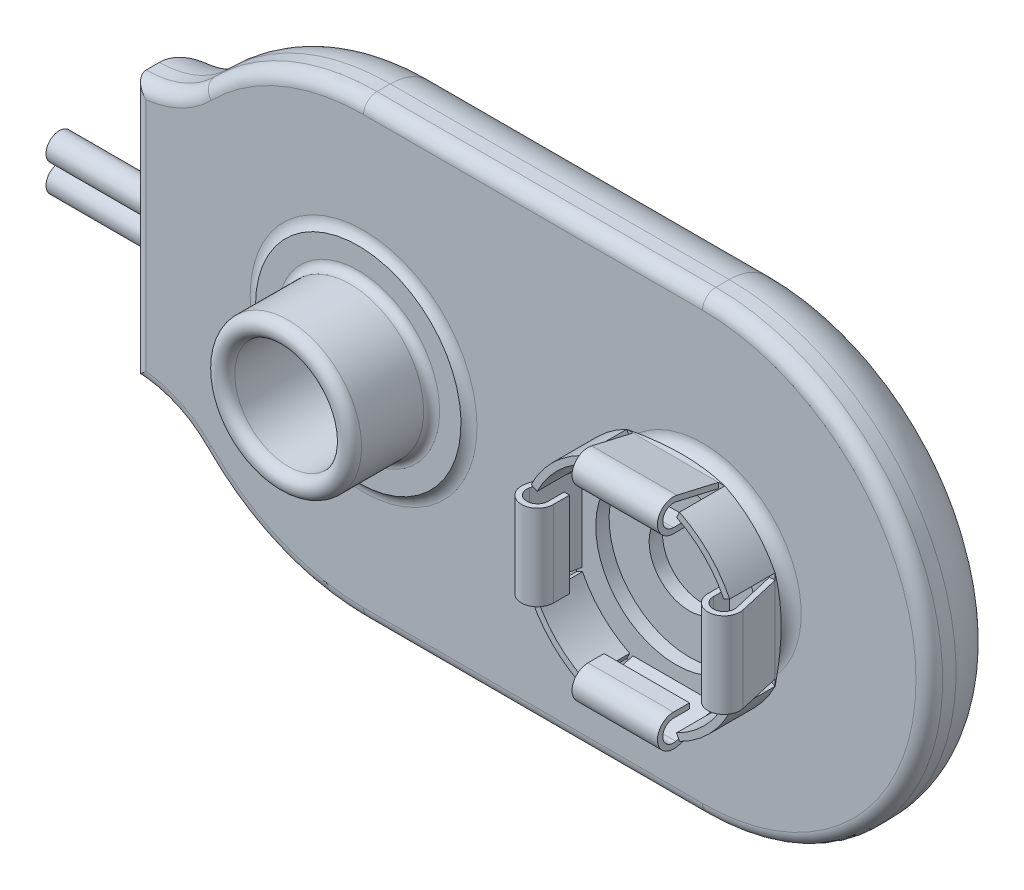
ISO-10303-21;
HEADER;
FILE_DESCRIPTION(('STEP AP214'),'2;1');
FILE_NAME('part.step','',(''),(''),'','','');
FILE_SCHEMA(('AUTOMOTIVE_DESIGN { 1 0 10303 214 1 1 1 1 }'));
ENDSEC;
DATA;
#1=APPLICATION_CONTEXT('core data for automotive mechanical design processes');
#2=APPLICATION_PROTOCOL_DEFINITION('international standard','automotive_design',2000,#1);
#3=PRODUCT_CONTEXT('',#1,'mechanical');
#4=PRODUCT('Part','Part','',(#3));
#5=PRODUCT_RELATED_PRODUCT_CATEGORY('part','',(#4));
#6=PRODUCT_DEFINITION_FORMATION('','',#4);
#7=PRODUCT_DEFINITION_CONTEXT('part definition',#1,'design');
#8=PRODUCT_DEFINITION('design','',#6,#7);
#9=PRODUCT_DEFINITION_SHAPE('','',#8);
#10=(LENGTH_UNIT() NAMED_UNIT(*) SI_UNIT(.MILLI.,.METRE.));
#11=(NAMED_UNIT(*) PLANE_ANGLE_UNIT() SI_UNIT($,.RADIAN.));
#12=(NAMED_UNIT(*) SI_UNIT($,.STERADIAN.) SOLID_ANGLE_UNIT());
#13=UNCERTAINTY_MEASURE_WITH_UNIT(LENGTH_MEASURE(1.E-05),#10,'distance_accuracy_value','');
#14=(GEOMETRIC_REPRESENTATION_CONTEXT(3) GLOBAL_UNCERTAINTY_ASSIGNED_CONTEXT((#13)) GLOBAL_UNIT_ASSIGNED_CONTEXT((#10,
#11,#12)) REPRESENTATION_CONTEXT('',''));
#15=CARTESIAN_POINT('',(0.,0.,0.));
#16=DIRECTION('',(0.,0.,1.));
#17=DIRECTION('',(1.,0.,0.));
#18=AXIS2_PLACEMENT_3D('',#15,#16,#17);
#19=CARTESIAN_POINT('',(-14.9999999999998,-4.87265486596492,41.3));
#20=DIRECTION('',(1.,0.,0.));
#21=DIRECTION('',(0.,1.,0.));
#22=AXIS2_PLACEMENT_3D('',#19,#20,#21);
#23=PLANE('',#22);
#24=CARTESIAN_POINT('',(-14.9999999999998,0.531681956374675,43.55));
#25=DIRECTION('',(1.,0.,0.));
#26=DIRECTION('',(0.,1.,0.));
#27=AXIS2_PLACEMENT_3D('',#24,#25,#26);
#28=CIRCLE('',#27,0.499999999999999);
#29=CARTESIAN_POINT('',(-14.9999999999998,0.0986692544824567,43.3));
#30=VERTEX_POINT('',#29);
#31=CARTESIAN_POINT('',(-14.9999999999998,0.0986692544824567,43.8));
#32=VERTEX_POINT('',#31);
#33=EDGE_CURVE('E51',#30,#32,#28,.F.);
#34=ORIENTED_EDGE('',*,*,#33,.F.);
#35=DIRECTION('',(0.,1.,0.));
#36=VECTOR('',#35,1.);
#37=CARTESIAN_POINT('',(-14.9999999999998,-4.87265486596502,43.3));
#38=LINE('',#37,#36);
#39=CARTESIAN_POINT('',(-14.9999999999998,-0.066987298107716,43.3));
#40=VERTEX_POINT('',#39);
#41=EDGE_CURVE('E1307',#30,#40,#38,.F.);
#42=ORIENTED_EDGE('',*,*,#41,.T.);
#43=CARTESIAN_POINT('',(-14.9999999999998,-0.499999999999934,43.55));
#44=DIRECTION('',(1.,0.,0.));
#45=DIRECTION('',(0.,1.,0.));
#46=AXIS2_PLACEMENT_3D('',#43,#44,#45);
#47=CIRCLE('',#46,0.499999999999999);
#48=CARTESIAN_POINT('',(-14.9999999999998,-0.0669872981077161,43.8));
#49=VERTEX_POINT('',#48);
#50=EDGE_CURVE('E523',#49,#40,#47,.F.);
#51=ORIENTED_EDGE('',*,*,#50,.F.);
#52=DIRECTION('',(0.,1.,0.));
#53=VECTOR('',#52,1.);
#54=CARTESIAN_POINT('',(-14.9999999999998,-4.87265486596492,43.8));
#55=LINE('',#54,#53);
#56=EDGE_CURVE('E482',#49,#32,#55,.T.);
#57=ORIENTED_EDGE('',*,*,#56,.T.);
#58=EDGE_LOOP('',(#34,#42,#51,#57));
#59=FACE_BOUND('',#58,.T.);
#60=ADVANCED_FACE('F32',(#59),#23,.F.);
#61=CARTESIAN_POINT('',(-14.9999999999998,0.964694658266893,43.8));
#62=VERTEX_POINT('',#61);
#63=CARTESIAN_POINT('',(-14.9999999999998,0.964694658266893,43.3));
#64=VERTEX_POINT('',#63);
#65=EDGE_CURVE('E460',#62,#64,#28,.F.);
#66=ORIENTED_EDGE('',*,*,#65,.F.);
#67=CARTESIAN_POINT('',(-14.9999999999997,4.87265486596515,43.8));
#68=VERTEX_POINT('',#67);
#69=EDGE_CURVE('E470',#62,#68,#55,.T.);
#70=ORIENTED_EDGE('',*,*,#69,.T.);
#71=DIRECTION('',(0.,0.,1.));
#72=VECTOR('',#71,1.);
#73=CARTESIAN_POINT('',(-14.9999999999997,4.87265486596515,41.3));
#74=LINE('',#73,#72);
#75=CARTESIAN_POINT('',(-14.9999999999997,4.87265486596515,43.3));
#76=VERTEX_POINT('',#75);
#77=EDGE_CURVE('E648',#76,#68,#74,.T.);
#78=ORIENTED_EDGE('',*,*,#77,.F.);
#79=EDGE_CURVE('E473',#76,#64,#38,.F.);
#80=ORIENTED_EDGE('',*,*,#79,.T.);
#81=EDGE_LOOP('',(#66,#70,#78,#80));
#82=FACE_BOUND('',#81,.T.);
#83=ADVANCED_FACE('F468',(#82),#23,.F.);
#84=CARTESIAN_POINT('',(-12.9999999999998,0.,43.3));
#85=DIRECTION('',(0.,-1.,0.));
#86=DIRECTION('',(1.,0.,0.));
#87=AXIS2_PLACEMENT_3D('',#84,#85,#86);
#88=CYLINDRICAL_SURFACE('',#87,2.);
#89=ORIENTED_EDGE('',*,*,#41,.F.);
#90=CARTESIAN_POINT('',(-14.9843134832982,1.03168195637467,43.55));
#91=CARTESIAN_POINT('',(-14.9807471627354,1.03168093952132,43.5783013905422));
#92=CARTESIAN_POINT('',(-14.9765688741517,1.02927073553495,43.6065379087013));
#93=CARTESIAN_POINT('',(-14.9671596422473,1.01978036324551,43.662046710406));
#94=CARTESIAN_POINT('',(-14.9619277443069,1.01269594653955,43.6893180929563));
#95=CARTESIAN_POINT('',(-14.9507115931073,0.994152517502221,43.7420984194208));
#96=CARTESIAN_POINT('',(-14.9447288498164,0.98270219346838,43.767610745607));
#97=CARTESIAN_POINT('',(-14.9323718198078,0.955776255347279,43.816305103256));
#98=CARTESIAN_POINT('',(-14.9259975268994,0.940300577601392,43.8394870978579));
#99=CARTESIAN_POINT('',(-14.913097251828,0.905206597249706,43.8836120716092));
#100=CARTESIAN_POINT('',(-14.9065723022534,0.885480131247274,43.9044694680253));
#101=CARTESIAN_POINT('',(-14.8940677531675,0.842650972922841,43.942581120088));
#102=CARTESIAN_POINT('',(-14.8880882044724,0.819547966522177,43.9598350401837));
#103=CARTESIAN_POINT('',(-14.8772125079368,0.77059234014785,43.9901688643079));
#104=CARTESIAN_POINT('',(-14.8723136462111,0.744746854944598,44.0032592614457));
#105=CARTESIAN_POINT('',(-14.8640690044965,0.690969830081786,44.0248320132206));
#106=CARTESIAN_POINT('',(-14.86072240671,0.663039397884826,44.0333167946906));
#107=CARTESIAN_POINT('',(-14.8560951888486,0.60769101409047,44.0449480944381));
#108=CARTESIAN_POINT('',(-14.854702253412,0.58034355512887,44.0483854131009));
#109=CARTESIAN_POINT('',(-14.8537607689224,0.525427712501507,44.0507149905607));
#110=CARTESIAN_POINT('',(-14.8542116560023,0.497859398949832,44.0496086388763));
#111=CARTESIAN_POINT('',(-14.8568421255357,0.444685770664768,44.0430667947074));
#112=CARTESIAN_POINT('',(-14.858937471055,0.419049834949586,44.0378422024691));
#113=CARTESIAN_POINT('',(-14.8645558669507,0.36904883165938,44.0235261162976));
#114=CARTESIAN_POINT('',(-14.8680790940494,0.344683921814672,44.0144341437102));
#115=CARTESIAN_POINT('',(-14.8763529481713,0.297227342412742,43.9924164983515));
#116=CARTESIAN_POINT('',(-14.8811319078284,0.274182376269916,43.9794011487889));
#117=CARTESIAN_POINT('',(-14.8914881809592,0.230544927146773,43.9500113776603));
#118=CARTESIAN_POINT('',(-14.8970657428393,0.209953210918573,43.9336359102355));
#119=CARTESIAN_POINT('',(-14.9089990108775,0.170383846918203,43.8967593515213));
#120=CARTESIAN_POINT('',(-14.9153817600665,0.151600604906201,43.8760581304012));
#121=CARTESIAN_POINT('',(-14.9281340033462,0.117730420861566,43.8318166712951));
#122=CARTESIAN_POINT('',(-14.9345034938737,0.102644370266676,43.8082757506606));
#123=CARTESIAN_POINT('',(-14.9470094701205,0.0761257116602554,43.7580874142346));
#124=CARTESIAN_POINT('',(-14.9531310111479,0.0648323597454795,43.731362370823));
#125=CARTESIAN_POINT('',(-14.964502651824,0.0470015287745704,43.6761934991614));
#126=CARTESIAN_POINT('',(-14.9697529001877,0.0404632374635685,43.6477499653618));
#127=CARTESIAN_POINT('',(-14.978967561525,0.0325297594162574,43.5906913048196));
#128=CARTESIAN_POINT('',(-14.9829608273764,0.031010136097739,43.5620982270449));
#129=CARTESIAN_POINT('',(-14.9896815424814,0.032897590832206,43.5049270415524));
#130=CARTESIAN_POINT('',(-14.9924093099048,0.0363034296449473,43.4763489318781));
#131=CARTESIAN_POINT('',(-14.9965071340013,0.0477635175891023,43.4212191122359));
#132=CARTESIAN_POINT('',(-14.997926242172,0.0556302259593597,43.3946318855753));
#133=CARTESIAN_POINT('',(-14.9997020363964,0.0756624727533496,43.3430930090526));
#134=CARTESIAN_POINT('',(-15.0000587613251,0.0878278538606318,43.3181412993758));
#135=CARTESIAN_POINT('',(-14.9999259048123,0.116000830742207,43.27078215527));
#136=CARTESIAN_POINT('',(-14.9994429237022,0.131977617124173,43.2483563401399));
#137=CARTESIAN_POINT('',(-14.9979205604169,0.167378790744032,43.2064363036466));
#138=CARTESIAN_POINT('',(-14.9968811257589,0.186803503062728,43.1869423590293));
#139=CARTESIAN_POINT('',(-14.9945322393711,0.228928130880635,43.1511044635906));
#140=CARTESIAN_POINT('',(-14.9932185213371,0.251677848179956,43.1348193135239));
#141=CARTESIAN_POINT('',(-14.9906461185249,0.299573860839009,43.1062621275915));
#142=CARTESIAN_POINT('',(-14.9893874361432,0.324720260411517,43.0939902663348));
#143=CARTESIAN_POINT('',(-14.9871835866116,0.376956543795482,43.0737101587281));
#144=CARTESIAN_POINT('',(-14.986241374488,0.404062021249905,43.0657416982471));
#145=CARTESIAN_POINT('',(-14.9848804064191,0.459239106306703,43.054475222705));
#146=CARTESIAN_POINT('',(-14.9844616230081,0.487310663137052,43.0511769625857));
#147=CARTESIAN_POINT('',(-14.9842323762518,0.543427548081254,43.0493553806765));
#148=CARTESIAN_POINT('',(-14.9844179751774,0.571471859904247,43.0508011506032));
#149=CARTESIAN_POINT('',(-14.9853520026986,0.626915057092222,43.0583563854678));
#150=CARTESIAN_POINT('',(-14.9861004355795,0.654313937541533,43.0644658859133));
#151=CARTESIAN_POINT('',(-14.9880082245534,0.70764761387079,43.0811550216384));
#152=CARTESIAN_POINT('',(-14.9891668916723,0.733584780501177,43.0917271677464));
#153=CARTESIAN_POINT('',(-14.9916544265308,0.783328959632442,43.1170419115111));
#154=CARTESIAN_POINT('',(-14.9929833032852,0.807135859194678,43.1317847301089));
#155=CARTESIAN_POINT('',(-14.9955198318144,0.85213208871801,43.1651595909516));
#156=CARTESIAN_POINT('',(-14.9967265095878,0.873300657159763,43.1838197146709));
#157=CARTESIAN_POINT('',(-14.9986756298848,0.912216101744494,43.2244467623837));
#158=CARTESIAN_POINT('',(-14.9994180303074,0.92996266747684,43.2464139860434));
#159=CARTESIAN_POINT('',(-15.0001221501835,0.961454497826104,43.2929365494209));
#160=CARTESIAN_POINT('',(-15.0000869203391,0.975215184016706,43.3174813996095));
#161=CARTESIAN_POINT('',(-14.9989889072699,0.998416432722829,43.3684984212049));
#162=CARTESIAN_POINT('',(-14.9979269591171,1.00786049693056,43.3949690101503));
#163=CARTESIAN_POINT('',(-14.994997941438,1.02055941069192,43.4429119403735));
#164=CARTESIAN_POINT('',(-14.9933671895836,1.02473083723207,43.4641612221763));
#165=CARTESIAN_POINT('',(-14.989379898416,1.03029249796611,43.5069528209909));
#166=CARTESIAN_POINT('',(-14.9870233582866,1.0316827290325,43.5284951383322));
#167=CARTESIAN_POINT('',(-14.9843134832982,1.03168195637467,43.55));
#168=B_SPLINE_CURVE_WITH_KNOTS('',3,(#90,#91,#92,#93,#94,#95,#96,#97,#98,#99,#100,#101,#102,
#103,#104,#105,#106,#107,#108,#109,#110,#111,#112,#113,#114,#115,#116,#117,#118,#119,#120,#121,
#122,#123,#124,#125,#126,#127,#128,#129,#130,#131,#132,#133,#134,#135,#136,#137,#138,#139,#140,
#141,#142,#143,#144,#145,#146,#147,#148,#149,#150,#151,#152,#153,#154,#155,#156,#157,#158,#159,
#160,#161,#162,#163,#164,#165,#166,#167),.UNSPECIFIED.,.T.,.F.,(4,2,2,2,2,2,2,2,2,2,2,2,2,2,2,2,
2,2,2,2,2,2,2,2,2,2,2,2,2,2,2,2,2,2,2,2,2,2,4),(0.,0.0854937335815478,0.171065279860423,
0.256467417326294,0.341870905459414,0.429778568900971,0.517694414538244,0.605386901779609,
0.693033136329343,0.775399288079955,0.857740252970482,0.936118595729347,1.01450664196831,
1.09484318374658,1.17520476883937,1.26083638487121,1.3464886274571,1.43500903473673,
1.52351431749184,1.60980797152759,1.69607991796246,1.77896843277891,1.86185391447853,
1.94409083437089,2.02633551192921,2.10997008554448,2.19360829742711,2.27800707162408,
2.36240141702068,2.44624701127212,2.53009324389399,2.6137993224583,2.69750983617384,
2.78184228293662,2.86618237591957,2.95019165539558,3.03413266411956,3.09909515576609,
3.16405772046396),.UNSPECIFIED.);
#169=EDGE_CURVE('E1448',#30,#64,#168,.T.);
#170=ORIENTED_EDGE('',*,*,#169,.T.);
#171=ORIENTED_EDGE('',*,*,#79,.F.);
#172=CARTESIAN_POINT('',(-14.9999999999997,4.87265486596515,43.3));
#173=CARTESIAN_POINT('',(-15.0000120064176,4.87267096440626,43.2541666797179));
#174=CARTESIAN_POINT('',(-14.9984249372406,4.87107987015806,43.2083447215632));
#175=CARTESIAN_POINT('',(-14.9921463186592,4.86480723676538,43.117171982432));
#176=CARTESIAN_POINT('',(-14.9874579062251,4.86012882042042,43.0718207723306));
#177=CARTESIAN_POINT('',(-14.9751307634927,4.84786554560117,42.982385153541));
#178=CARTESIAN_POINT('',(-14.9675214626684,4.84030968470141,42.9382926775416));
#179=CARTESIAN_POINT('',(-14.9495114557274,4.82250203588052,42.8512425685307));
#180=CARTESIAN_POINT('',(-14.9391101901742,4.81224970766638,42.8082851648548));
#181=CARTESIAN_POINT('',(-14.9040801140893,4.77790075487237,42.681867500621));
#182=CARTESIAN_POINT('',(-14.8755630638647,4.75014937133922,42.6004311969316));
#183=CARTESIAN_POINT('',(-14.8096852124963,4.68695545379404,42.4442728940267));
#184=CARTESIAN_POINT('',(-14.7722982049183,4.65149015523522,42.3695717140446));
#185=CARTESIAN_POINT('',(-14.6719158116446,4.5578158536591,42.1960469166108));
#186=CARTESIAN_POINT('',(-14.6049157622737,4.4964945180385,42.1012120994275));
#187=CARTESIAN_POINT('',(-14.4589769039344,4.36637647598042,41.9272977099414));
#188=CARTESIAN_POINT('',(-14.3800249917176,4.29757158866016,41.848235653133));
#189=CARTESIAN_POINT('',(-14.2108209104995,4.15394981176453,41.7042206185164));
#190=CARTESIAN_POINT('',(-14.120359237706,4.07903429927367,41.6396143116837));
#191=CARTESIAN_POINT('',(-13.9316001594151,3.92677906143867,41.5268069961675));
#192=CARTESIAN_POINT('',(-13.8333001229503,3.84943852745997,41.478611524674));
#193=CARTESIAN_POINT('',(-13.6170644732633,3.68355193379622,41.39356628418));
#194=CARTESIAN_POINT('',(-13.4982664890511,3.59489832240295,41.3591156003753));
#195=CARTESIAN_POINT('',(-13.2557884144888,3.4187518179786,41.3126021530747));
#196=CARTESIAN_POINT('',(-13.1321199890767,3.33125675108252,41.3004888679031));
#197=CARTESIAN_POINT('',(-13.0050768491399,3.24355772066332,41.3000048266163));
#198=CARTESIAN_POINT('',(-13.0025385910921,3.24180642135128,41.2999999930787));
#199=CARTESIAN_POINT('',(-12.9999999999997,3.24005577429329,41.3));
#200=B_SPLINE_CURVE_WITH_KNOTS('',3,(#172,#173,#174,#175,#176,#177,#178,#179,#180,#181,#182,
#183,#184,#185,#186,#187,#188,#189,#190,#191,#192,#193,#194,#195,#196,#197,#198,#199),
.UNSPECIFIED.,.F.,.F.,(4,2,2,2,2,2,2,2,2,2,2,2,2,4),(0.,0.137426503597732,0.274714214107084,
0.410653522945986,0.546620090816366,0.81725223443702,1.08869414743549,1.48048161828,
1.87270177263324,2.2735062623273,2.67444585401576,3.12933194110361,3.58318792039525,
3.59243930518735),.UNSPECIFIED.);
#201=CARTESIAN_POINT('',(-12.9999999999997,3.24005577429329,41.3));
#202=VERTEX_POINT('',#201);
#203=EDGE_CURVE('E540',#202,#76,#200,.F.);
#204=ORIENTED_EDGE('',*,*,#203,.F.);
#205=DIRECTION('',(0.,1.,0.));
#206=VECTOR('',#205,1.);
#207=CARTESIAN_POINT('',(-12.9999999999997,4.87265486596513,41.3));
#208=LINE('',#207,#206);
#209=CARTESIAN_POINT('',(-12.9999999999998,-3.24005577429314,41.3));
#210=VERTEX_POINT('',#209);
#211=EDGE_CURVE('E1296',#210,#202,#208,.T.);
#212=ORIENTED_EDGE('',*,*,#211,.F.);
#213=CARTESIAN_POINT('',(-14.9999999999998,-4.87265486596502,43.3));
#214=CARTESIAN_POINT('',(-15.0000120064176,-4.87267096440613,43.2541666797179));
#215=CARTESIAN_POINT('',(-14.9984249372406,-4.87107987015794,43.2083447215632));
#216=CARTESIAN_POINT('',(-14.9921463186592,-4.86480723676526,43.117171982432));
#217=CARTESIAN_POINT('',(-14.9874579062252,-4.8601288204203,43.0718207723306));
#218=CARTESIAN_POINT('',(-14.9751307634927,-4.84786554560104,42.982385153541));
#219=CARTESIAN_POINT('',(-14.9675214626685,-4.84030968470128,42.9382926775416));
#220=CARTESIAN_POINT('',(-14.9495114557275,-4.82250203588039,42.8512425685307));
#221=CARTESIAN_POINT('',(-14.9391101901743,-4.81224970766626,42.8082851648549));
#222=CARTESIAN_POINT('',(-14.9040801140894,-4.77790075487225,42.681867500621));
#223=CARTESIAN_POINT('',(-14.8755630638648,-4.7501493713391,42.6004311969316));
#224=CARTESIAN_POINT('',(-14.8096852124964,-4.68695545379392,42.4442728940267));
#225=CARTESIAN_POINT('',(-14.7722982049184,-4.6514901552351,42.3695717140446));
#226=CARTESIAN_POINT('',(-14.6719158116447,-4.55781585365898,42.1960469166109));
#227=CARTESIAN_POINT('',(-14.6049157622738,-4.49649451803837,42.1012120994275));
#228=CARTESIAN_POINT('',(-14.4589769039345,-4.36637647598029,41.9272977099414));
#229=CARTESIAN_POINT('',(-14.3800249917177,-4.29757158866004,41.8482356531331));
#230=CARTESIAN_POINT('',(-14.2108209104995,-4.15394981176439,41.7042206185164));
#231=CARTESIAN_POINT('',(-14.1203592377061,-4.07903429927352,41.6396143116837));
#232=CARTESIAN_POINT('',(-13.9316001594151,-3.92677906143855,41.5268069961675));
#233=CARTESIAN_POINT('',(-13.8333001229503,-3.84943852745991,41.478611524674));
#234=CARTESIAN_POINT('',(-13.6170644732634,-3.68355193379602,41.39356628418));
#235=CARTESIAN_POINT('',(-13.4982664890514,-3.59489832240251,41.3591156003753));
#236=CARTESIAN_POINT('',(-13.2557884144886,-3.41875181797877,41.3126021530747));
#237=CARTESIAN_POINT('',(-13.132119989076,-3.33125675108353,41.300488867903));
#238=CARTESIAN_POINT('',(-13.00507684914,-3.24355772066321,41.3000048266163));
#239=CARTESIAN_POINT('',(-13.0025385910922,-3.24180642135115,41.2999999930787));
#240=CARTESIAN_POINT('',(-12.9999999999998,-3.24005577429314,41.3));
#241=B_SPLINE_CURVE_WITH_KNOTS('',3,(#213,#214,#215,#216,#217,#218,#219,#220,#221,#222,#223,
#224,#225,#226,#227,#228,#229,#230,#231,#232,#233,#234,#235,#236,#237,#238,#239,#240),
.UNSPECIFIED.,.F.,.F.,(4,2,2,2,2,2,2,2,2,2,2,2,2,4),(0.,0.137426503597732,0.274714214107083,
0.410653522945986,0.546620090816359,0.817252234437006,1.08869414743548,1.48048161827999,
1.87270177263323,2.2735062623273,2.67444585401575,3.12933194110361,3.58318792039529,
3.59243930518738),.UNSPECIFIED.);
#242=CARTESIAN_POINT('',(-14.9999999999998,-4.87265486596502,43.3));
#243=VERTEX_POINT('',#242);
#244=EDGE_CURVE('E549',#210,#243,#241,.F.);
#245=ORIENTED_EDGE('',*,*,#244,.T.);
#246=CARTESIAN_POINT('',(-14.9999999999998,-0.933012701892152,43.3));
#247=VERTEX_POINT('',#246);
#248=EDGE_CURVE('E1304',#247,#243,#38,.F.);
#249=ORIENTED_EDGE('',*,*,#248,.F.);
#250=CARTESIAN_POINT('',(-14.9843134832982,0.,43.55));
#251=CARTESIAN_POINT('',(-14.9807471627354,-1.01685329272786E-06,43.5783013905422));
#252=CARTESIAN_POINT('',(-14.9765688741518,-0.00241122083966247,43.6065379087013));
#253=CARTESIAN_POINT('',(-14.9671596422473,-0.0119015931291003,43.662046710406));
#254=CARTESIAN_POINT('',(-14.9619277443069,-0.0189860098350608,43.6893180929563));
#255=CARTESIAN_POINT('',(-14.9507115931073,-0.0375294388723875,43.7420984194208));
#256=CARTESIAN_POINT('',(-14.9447288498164,-0.0489797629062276,43.767610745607));
#257=CARTESIAN_POINT('',(-14.9323718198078,-0.0759057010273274,43.816305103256));
#258=CARTESIAN_POINT('',(-14.9259975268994,-0.0913813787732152,43.8394870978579));
#259=CARTESIAN_POINT('',(-14.913097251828,-0.126475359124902,43.8836120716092));
#260=CARTESIAN_POINT('',(-14.9065723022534,-0.146201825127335,43.9044694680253));
#261=CARTESIAN_POINT('',(-14.8940677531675,-0.189030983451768,43.942581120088));
#262=CARTESIAN_POINT('',(-14.8880882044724,-0.212133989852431,43.9598350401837));
#263=CARTESIAN_POINT('',(-14.8772125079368,-0.261089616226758,43.9901688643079));
#264=CARTESIAN_POINT('',(-14.8723136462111,-0.28693510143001,44.0032592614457));
#265=CARTESIAN_POINT('',(-14.8640690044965,-0.340712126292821,44.0248320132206));
#266=CARTESIAN_POINT('',(-14.86072240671,-0.368642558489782,44.0333167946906));
#267=CARTESIAN_POINT('',(-14.8560951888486,-0.423990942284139,44.0449480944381));
#268=CARTESIAN_POINT('',(-14.854702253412,-0.451338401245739,44.0483854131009));
#269=CARTESIAN_POINT('',(-14.8537607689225,-0.506254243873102,44.0507149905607));
#270=CARTESIAN_POINT('',(-14.8542116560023,-0.533822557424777,44.0496086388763));
#271=CARTESIAN_POINT('',(-14.8568421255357,-0.586996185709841,44.0430667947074));
#272=CARTESIAN_POINT('',(-14.858937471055,-0.612632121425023,44.0378422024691));
#273=CARTESIAN_POINT('',(-14.8645558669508,-0.662633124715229,44.0235261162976));
#274=CARTESIAN_POINT('',(-14.8680790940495,-0.686998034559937,44.0144341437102));
#275=CARTESIAN_POINT('',(-14.8763529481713,-0.734454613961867,43.9924164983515));
#276=CARTESIAN_POINT('',(-14.8811319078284,-0.757499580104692,43.9794011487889));
#277=CARTESIAN_POINT('',(-14.8914881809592,-0.801137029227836,43.9500113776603));
#278=CARTESIAN_POINT('',(-14.8970657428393,-0.821728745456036,43.9336359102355));
#279=CARTESIAN_POINT('',(-14.9089990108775,-0.861298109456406,43.8967593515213));
#280=CARTESIAN_POINT('',(-14.9153817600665,-0.880081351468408,43.8760581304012));
#281=CARTESIAN_POINT('',(-14.9281340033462,-0.913951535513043,43.8318166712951));
#282=CARTESIAN_POINT('',(-14.9345034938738,-0.929037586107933,43.8082757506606));
#283=CARTESIAN_POINT('',(-14.9470094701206,-0.955556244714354,43.7580874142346));
#284=CARTESIAN_POINT('',(-14.9531310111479,-0.966849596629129,43.731362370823));
#285=CARTESIAN_POINT('',(-14.964502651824,-0.984680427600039,43.6761934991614));
#286=CARTESIAN_POINT('',(-14.9697529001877,-0.99121871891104,43.6477499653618));
#287=CARTESIAN_POINT('',(-14.978967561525,-0.999152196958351,43.5906913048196));
#288=CARTESIAN_POINT('',(-14.9829608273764,-1.00067182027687,43.5620982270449));
#289=CARTESIAN_POINT('',(-14.9896815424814,-0.998784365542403,43.5049270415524));
#290=CARTESIAN_POINT('',(-14.9924093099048,-0.995378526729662,43.4763489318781));
#291=CARTESIAN_POINT('',(-14.9965071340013,-0.983918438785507,43.4212191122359));
#292=CARTESIAN_POINT('',(-14.997926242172,-0.97605173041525,43.3946318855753));
#293=CARTESIAN_POINT('',(-14.9997020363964,-0.956019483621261,43.3430930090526));
#294=CARTESIAN_POINT('',(-15.0000587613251,-0.943854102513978,43.3181412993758));
#295=CARTESIAN_POINT('',(-14.9999259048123,-0.915681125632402,43.27078215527));
#296=CARTESIAN_POINT('',(-14.9994429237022,-0.899704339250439,43.2483563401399));
#297=CARTESIAN_POINT('',(-14.9979205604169,-0.86430316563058,43.2064363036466));
#298=CARTESIAN_POINT('',(-14.9968811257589,-0.844878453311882,43.1869423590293));
#299=CARTESIAN_POINT('',(-14.9945322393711,-0.802753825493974,43.1511044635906));
#300=CARTESIAN_POINT('',(-14.9932185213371,-0.780004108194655,43.1348193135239));
#301=CARTESIAN_POINT('',(-14.9906461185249,-0.732108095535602,43.1062621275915));
#302=CARTESIAN_POINT('',(-14.9893874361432,-0.706961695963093,43.0939902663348));
#303=CARTESIAN_POINT('',(-14.9871835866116,-0.654725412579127,43.0737101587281));
#304=CARTESIAN_POINT('',(-14.986241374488,-0.627619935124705,43.0657416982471));
#305=CARTESIAN_POINT('',(-14.9848804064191,-0.572442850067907,43.054475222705));
#306=CARTESIAN_POINT('',(-14.9844616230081,-0.544371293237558,43.0511769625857));
#307=CARTESIAN_POINT('',(-14.9842323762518,-0.488254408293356,43.0493553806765));
#308=CARTESIAN_POINT('',(-14.9844179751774,-0.460210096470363,43.0508011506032));
#309=CARTESIAN_POINT('',(-14.9853520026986,-0.404766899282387,43.0583563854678));
#310=CARTESIAN_POINT('',(-14.9861004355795,-0.377368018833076,43.0644658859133));
#311=CARTESIAN_POINT('',(-14.9880082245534,-0.324034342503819,43.0811550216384));
#312=CARTESIAN_POINT('',(-14.9891668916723,-0.298097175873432,43.0917271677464));
#313=CARTESIAN_POINT('',(-14.9916544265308,-0.248352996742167,43.1170419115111));
#314=CARTESIAN_POINT('',(-14.9929833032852,-0.224546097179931,43.1317847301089));
#315=CARTESIAN_POINT('',(-14.9955198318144,-0.179549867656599,43.1651595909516));
#316=CARTESIAN_POINT('',(-14.9967265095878,-0.158381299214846,43.1838197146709));
#317=CARTESIAN_POINT('',(-14.9986756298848,-0.119465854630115,43.2244467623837));
#318=CARTESIAN_POINT('',(-14.9994180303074,-0.101719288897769,43.2464139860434));
#319=CARTESIAN_POINT('',(-15.0001221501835,-0.0702274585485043,43.2929365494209));
#320=CARTESIAN_POINT('',(-15.0000869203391,-0.0564667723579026,43.3174813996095));
#321=CARTESIAN_POINT('',(-14.9989889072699,-0.0332655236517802,43.3684984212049));
#322=CARTESIAN_POINT('',(-14.9979269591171,-0.0238214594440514,43.3949690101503));
#323=CARTESIAN_POINT('',(-14.994997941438,-0.0111225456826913,43.4429119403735));
#324=CARTESIAN_POINT('',(-14.9933671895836,-0.00695111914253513,43.4641612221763));
#325=CARTESIAN_POINT('',(-14.989379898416,-0.00138945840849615,43.5069528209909));
#326=CARTESIAN_POINT('',(-14.9870233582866,7.72657887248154E-07,43.5284951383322));
#327=CARTESIAN_POINT('',(-14.9843134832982,0.,43.55));
#328=B_SPLINE_CURVE_WITH_KNOTS('',3,(#250,#251,#252,#253,#254,#255,#256,#257,#258,#259,#260,
#261,#262,#263,#264,#265,#266,#267,#268,#269,#270,#271,#272,#273,#274,#275,#276,#277,#278,#279,
#280,#281,#282,#283,#284,#285,#286,#287,#288,#289,#290,#291,#292,#293,#294,#295,#296,#297,#298,
#299,#300,#301,#302,#303,#304,#305,#306,#307,#308,#309,#310,#311,#312,#313,#314,#315,#316,#317,
#318,#319,#320,#321,#322,#323,#324,#325,#326,#327),.UNSPECIFIED.,.T.,.F.,(4,2,2,2,2,2,2,2,2,2,2,
2,2,2,2,2,2,2,2,2,2,2,2,2,2,2,2,2,2,2,2,2,2,2,2,2,2,2,4),(0.,0.085493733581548,
0.171065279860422,0.256467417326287,0.341870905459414,0.429778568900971,0.517694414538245,
0.605386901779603,0.693033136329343,0.775399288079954,0.857740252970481,0.936118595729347,
1.01450664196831,1.09484318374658,1.17520476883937,1.26083638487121,1.3464886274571,
1.43500903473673,1.52351431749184,1.60980797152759,1.69607991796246,1.7789684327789,
1.86185391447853,1.94409083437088,2.02633551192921,2.10997008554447,2.19360829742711,
2.27800707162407,2.36240141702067,2.44624701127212,2.53009324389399,2.6137993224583,
2.69750983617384,2.78184228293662,2.86618237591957,2.95019165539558,3.03413266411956,
3.09909515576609,3.16405772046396),.UNSPECIFIED.);
#329=EDGE_CURVE('E515',#247,#40,#328,.T.);
#330=ORIENTED_EDGE('',*,*,#329,.T.);
#331=EDGE_LOOP('',(#89,#170,#171,#204,#212,#245,#249,#330));
#332=FACE_BOUND('',#331,.T.);
#333=ADVANCED_FACE('F526',(#332),#88,.T.);
#334=CARTESIAN_POINT('',(-14.4999999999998,-4.87265486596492,43.8));
#335=DIRECTION('',(0.,1.,0.));
#336=DIRECTION('',(-1.,0.,0.));
#337=AXIS2_PLACEMENT_3D('',#334,#335,#336);
#338=CYLINDRICAL_SURFACE('',#337,0.5);
#339=ORIENTED_EDGE('',*,*,#69,.F.);
#340=CARTESIAN_POINT('',(-14.9999999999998,0.0986692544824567,43.8));
#341=CARTESIAN_POINT('',(-14.9999995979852,0.0880678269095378,43.7816371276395));
#342=CARTESIAN_POINT('',(-14.998983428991,0.0786366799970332,43.7625913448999));
#343=CARTESIAN_POINT('',(-14.9945301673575,0.062348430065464,43.7236952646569));
#344=CARTESIAN_POINT('',(-14.9910939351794,0.0554904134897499,43.7038452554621));
#345=CARTESIAN_POINT('',(-14.9815868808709,0.0444138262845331,43.6640081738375));
#346=CARTESIAN_POINT('',(-14.9755125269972,0.0401988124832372,43.6440209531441));
#347=CARTESIAN_POINT('',(-14.9607412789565,0.0342790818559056,43.6046546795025));
#348=CARTESIAN_POINT('',(-14.952043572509,0.0325751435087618,43.5852758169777));
#349=CARTESIAN_POINT('',(-14.9323990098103,0.0313450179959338,43.5480750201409));
#350=CARTESIAN_POINT('',(-14.9214946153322,0.0317808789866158,43.5302316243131));
#351=CARTESIAN_POINT('',(-14.8976133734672,0.0342980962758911,43.4961290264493));
#352=CARTESIAN_POINT('',(-14.8846359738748,0.0363798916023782,43.4798702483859));
#353=CARTESIAN_POINT('',(-14.8549674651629,0.0420684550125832,43.447080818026));
#354=CARTESIAN_POINT('',(-14.8380110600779,0.0458456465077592,43.4308206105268));
#355=CARTESIAN_POINT('',(-14.8021007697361,0.0541777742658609,43.4008976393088));
#356=CARTESIAN_POINT('',(-14.7831446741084,0.0587335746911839,43.387237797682));
#357=CARTESIAN_POINT('',(-14.7399447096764,0.0687357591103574,43.3604740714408));
#358=CARTESIAN_POINT('',(-14.7153636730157,0.0741946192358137,43.3479144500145));
#359=CARTESIAN_POINT('',(-14.6642845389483,0.0840374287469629,43.3269546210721));
#360=CARTESIAN_POINT('',(-14.6377872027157,0.0884218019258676,43.3185527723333));
#361=CARTESIAN_POINT('',(-14.583253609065,0.0950991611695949,43.3061826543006));
#362=CARTESIAN_POINT('',(-14.5552061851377,0.0973740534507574,43.3022526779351));
#363=CARTESIAN_POINT('',(-14.4987768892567,0.0991242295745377,43.2992054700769));
#364=CARTESIAN_POINT('',(-14.4703953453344,0.0986020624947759,43.3000838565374));
#365=CARTESIAN_POINT('',(-14.4178760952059,0.0951544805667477,43.3061714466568));
#366=CARTESIAN_POINT('',(-14.3936499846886,0.0925363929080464,43.3108277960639));
#367=CARTESIAN_POINT('',(-14.3463259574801,0.085833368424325,43.3235700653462));
#368=CARTESIAN_POINT('',(-14.3232288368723,0.0817474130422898,43.3316583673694));
#369=CARTESIAN_POINT('',(-14.2770296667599,0.072539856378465,43.3517121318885));
#370=CARTESIAN_POINT('',(-14.2540382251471,0.0673661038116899,43.3639074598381));
#371=CARTESIAN_POINT('',(-14.2101767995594,0.0571580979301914,43.3917380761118));
#372=CARTESIAN_POINT('',(-14.1893088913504,0.0521239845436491,43.4073766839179));
#373=CARTESIAN_POINT('',(-14.1481355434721,0.0427392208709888,43.4436059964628));
#374=CARTESIAN_POINT('',(-14.128097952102,0.0385083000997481,43.4645366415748));
#375=CARTESIAN_POINT('',(-14.0918242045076,0.0327850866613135,43.509780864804));
#376=CARTESIAN_POINT('',(-14.075578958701,0.0312861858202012,43.5340861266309));
#377=CARTESIAN_POINT('',(-14.0515085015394,0.0321254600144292,43.5779710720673));
#378=CARTESIAN_POINT('',(-14.0425985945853,0.0335100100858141,43.5969779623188));
#379=CARTESIAN_POINT('',(-14.0273190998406,0.0386907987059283,43.6356708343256));
#380=CARTESIAN_POINT('',(-14.0209476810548,0.0424852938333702,43.6553563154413));
#381=CARTESIAN_POINT('',(-14.0107803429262,0.0526589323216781,43.6947449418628));
#382=CARTESIAN_POINT('',(-14.0069869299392,0.0590405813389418,43.714448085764));
#383=CARTESIAN_POINT('',(-14.0018140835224,0.0743470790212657,43.7531715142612));
#384=CARTESIAN_POINT('',(-14.0004356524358,0.0832729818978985,43.7721915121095));
#385=CARTESIAN_POINT('',(-13.9997421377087,0.103449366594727,43.8089525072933));
#386=CARTESIAN_POINT('',(-14.0004247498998,0.114697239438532,43.8266949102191));
#387=CARTESIAN_POINT('',(-14.0033872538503,0.139248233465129,43.8605374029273));
#388=CARTESIAN_POINT('',(-14.0056676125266,0.152551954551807,43.8766370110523));
#389=CARTESIAN_POINT('',(-14.0117398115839,0.183003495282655,43.9091500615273));
#390=CARTESIAN_POINT('',(-14.015702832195,0.2004289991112,43.9252707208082));
#391=CARTESIAN_POINT('',(-14.0243269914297,0.237282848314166,43.954831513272));
#392=CARTESIAN_POINT('',(-14.028988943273,0.25671351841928,43.9682684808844));
#393=CARTESIAN_POINT('',(-14.0390913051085,0.300869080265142,43.994403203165));
#394=CARTESIAN_POINT('',(-14.0445240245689,0.325923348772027,44.0065527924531));
#395=CARTESIAN_POINT('',(-14.054145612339,0.377907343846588,44.0265794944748));
#396=CARTESIAN_POINT('',(-14.0583352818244,0.40483584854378,44.0344593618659));
#397=CARTESIAN_POINT('',(-14.0644135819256,0.45968651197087,44.0455723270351));
#398=CARTESIAN_POINT('',(-14.066320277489,0.48759904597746,44.0488419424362));
#399=CARTESIAN_POINT('',(-14.0673561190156,0.543617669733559,44.050641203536));
#400=CARTESIAN_POINT('',(-14.0664871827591,0.571723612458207,44.0491741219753));
#401=CARTESIAN_POINT('',(-14.0624878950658,0.623756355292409,44.0420655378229));
#402=CARTESIAN_POINT('',(-14.0596410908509,0.647780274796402,44.0369454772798));
#403=CARTESIAN_POINT('',(-14.0525818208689,0.694643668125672,44.0233281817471));
#404=CARTESIAN_POINT('',(-14.0483684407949,0.71748233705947,44.0148286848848));
#405=CARTESIAN_POINT('',(-14.0389451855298,0.763419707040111,43.993832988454));
#406=CARTESIAN_POINT('',(-14.0336815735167,0.786382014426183,43.9810631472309));
#407=CARTESIAN_POINT('',(-14.0234296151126,0.8300928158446,43.952044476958));
#408=CARTESIAN_POINT('',(-14.0184415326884,0.850839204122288,43.9357923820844));
#409=CARTESIAN_POINT('',(-14.0093830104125,0.891397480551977,43.8984671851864));
#410=CARTESIAN_POINT('',(-14.0054326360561,0.910964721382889,43.8770949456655));
#411=CARTESIAN_POINT('',(-14.0004343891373,0.946209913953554,43.8310699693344));
#412=CARTESIAN_POINT('',(-13.9993791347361,0.961897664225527,43.8064257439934));
#413=CARTESIAN_POINT('',(-14.0010881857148,0.984915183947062,43.7621712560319));
#414=CARTESIAN_POINT('',(-14.0028614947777,0.99335467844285,43.7430951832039));
#415=CARTESIAN_POINT('',(-14.0088388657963,1.00769842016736,43.7043799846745));
#416=CARTESIAN_POINT('',(-14.0130413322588,1.01360432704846,43.6847412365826));
#417=CARTESIAN_POINT('',(-14.0240099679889,1.0228756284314,43.6455741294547));
#418=CARTESIAN_POINT('',(-14.0307771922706,1.02623997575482,43.6260458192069));
#419=CARTESIAN_POINT('',(-14.0468033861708,1.03062642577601,43.5877645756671));
#420=CARTESIAN_POINT('',(-14.0560634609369,1.03164748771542,43.569011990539));
#421=CARTESIAN_POINT('',(-14.076968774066,1.03171511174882,43.5326237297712));
#422=CARTESIAN_POINT('',(-14.0886390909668,1.03073986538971,43.515002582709));
#423=CARTESIAN_POINT('',(-14.1140161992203,1.02725098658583,43.4814732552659));
#424=CARTESIAN_POINT('',(-14.1277236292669,1.0247368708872,43.4655656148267));
#425=CARTESIAN_POINT('',(-14.1591429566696,1.01821375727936,43.4333987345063));
#426=CARTESIAN_POINT('',(-14.1771465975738,1.01403466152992,43.4174595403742));
#427=CARTESIAN_POINT('',(-14.2151638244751,1.00508093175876,43.3883658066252));
#428=CARTESIAN_POINT('',(-14.2351798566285,1.00030557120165,43.3752147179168));
#429=CARTESIAN_POINT('',(-14.2804795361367,0.990130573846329,43.3498963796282));
#430=CARTESIAN_POINT('',(-14.3060800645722,0.984762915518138,43.3382769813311));
#431=CARTESIAN_POINT('',(-14.3590946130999,0.975477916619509,43.3194428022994));
#432=CARTESIAN_POINT('',(-14.3865069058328,0.971559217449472,43.312223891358));
#433=CARTESIAN_POINT('',(-14.441646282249,0.966250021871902,43.3026520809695));
#434=CARTESIAN_POINT('',(-14.46934408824,0.96479310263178,43.3001710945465));
#435=CARTESIAN_POINT('',(-14.5247680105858,0.964606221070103,43.2998462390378));
#436=CARTESIAN_POINT('',(-14.5524941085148,0.965875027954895,43.3020002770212));
#437=CARTESIAN_POINT('',(-14.6039229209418,0.970503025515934,43.3103040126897));
#438=CARTESIAN_POINT('',(-14.6277285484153,0.973612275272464,43.3159793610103));
#439=CARTESIAN_POINT('',(-14.6740940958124,0.981077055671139,43.3306565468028));
#440=CARTESIAN_POINT('',(-14.6966529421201,0.985433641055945,43.3396612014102));
#441=CARTESIAN_POINT('',(-14.7423041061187,0.995094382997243,43.3618275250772));
#442=CARTESIAN_POINT('',(-14.7652285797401,1.00044964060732,43.3753122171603));
#443=CARTESIAN_POINT('',(-14.8087229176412,1.01070624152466,43.4057984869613));
#444=CARTESIAN_POINT('',(-14.8292933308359,1.01560769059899,43.4227992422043));
#445=CARTESIAN_POINT('',(-14.865584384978,1.02345321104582,43.4580671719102));
#446=CARTESIAN_POINT('',(-14.8815881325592,1.02654999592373,43.4760074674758));
#447=CARTESIAN_POINT('',(-14.9109408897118,1.03076384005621,43.5141583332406));
#448=CARTESIAN_POINT('',(-14.9242918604,1.03188236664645,43.5343672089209));
#449=CARTESIAN_POINT('',(-14.9480155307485,1.03142058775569,43.5766748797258));
#450=CARTESIAN_POINT('',(-14.9583635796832,1.02981864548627,43.5987874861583));
#451=CARTESIAN_POINT('',(-14.9756049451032,1.02331922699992,43.643857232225));
#452=CARTESIAN_POINT('',(-14.9825012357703,1.01842459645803,43.6668136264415));
#453=CARTESIAN_POINT('',(-14.9921399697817,1.00604308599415,43.7093918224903));
#454=CARTESIAN_POINT('',(-14.9953172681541,0.998994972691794,43.7290457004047));
#455=CARTESIAN_POINT('',(-14.9993176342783,0.982381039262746,43.767506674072));
#456=CARTESIAN_POINT('',(-15.00014027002,0.97281475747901,43.7863136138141));
#457=CARTESIAN_POINT('',(-14.9998194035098,0.951326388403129,43.822668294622));
#458=CARTESIAN_POINT('',(-14.9986624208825,0.939388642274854,43.8402065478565));
#459=CARTESIAN_POINT('',(-14.9948489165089,0.913488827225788,43.8735265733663));
#460=CARTESIAN_POINT('',(-14.9921919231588,0.899526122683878,43.8893077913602));
#461=CARTESIAN_POINT('',(-14.9853936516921,0.867490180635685,43.9212443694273));
#462=CARTESIAN_POINT('',(-14.9810837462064,0.84911625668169,43.937061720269));
#463=CARTESIAN_POINT('',(-14.9719367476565,0.810353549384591,43.9658441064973));
#464=CARTESIAN_POINT('',(-14.9670989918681,0.789962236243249,43.9788054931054));
#465=CARTESIAN_POINT('',(-14.9569073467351,0.743950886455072,44.0035771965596));
#466=CARTESIAN_POINT('',(-14.9516003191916,0.718023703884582,44.0148431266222));
#467=CARTESIAN_POINT('',(-14.9425665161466,0.664401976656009,44.0328907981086));
#468=CARTESIAN_POINT('',(-14.9388379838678,0.636709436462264,44.03967752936));
#469=CARTESIAN_POINT('',(-14.9340344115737,0.58144180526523,44.0482709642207));
#470=CARTESIAN_POINT('',(-14.9328608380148,0.553904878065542,44.0502629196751));
#471=CARTESIAN_POINT('',(-14.9331967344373,0.498902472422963,44.0496813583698));
#472=CARTESIAN_POINT('',(-14.934705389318,0.471436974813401,44.0471092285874));
#473=CARTESIAN_POINT('',(-14.9397083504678,0.420390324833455,44.0380725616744));
#474=CARTESIAN_POINT('',(-14.9429759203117,0.396705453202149,44.0320481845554));
#475=CARTESIAN_POINT('',(-14.9506831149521,0.350620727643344,44.0166984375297));
#476=CARTESIAN_POINT('',(-14.9551238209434,0.328222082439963,44.0073700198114));
#477=CARTESIAN_POINT('',(-14.9649177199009,0.282749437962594,43.984452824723));
#478=CARTESIAN_POINT('',(-14.9703176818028,0.259862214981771,43.9705135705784));
#479=CARTESIAN_POINT('',(-14.9805472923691,0.216527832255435,43.9390923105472));
#480=CARTESIAN_POINT('',(-14.9853773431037,0.196078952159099,43.9216128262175));
#481=CARTESIAN_POINT('',(-14.9925633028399,0.16197554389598,43.8873080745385));
#482=CARTESIAN_POINT('',(-14.9952230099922,0.147786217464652,43.8710778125));
#483=CARTESIAN_POINT('',(-14.998940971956,0.121548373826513,43.8368016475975));
#484=CARTESIAN_POINT('',(-15.000000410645,0.109498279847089,43.8187570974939));
#485=CARTESIAN_POINT('',(-14.9999999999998,0.0986692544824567,43.8));
#486=B_SPLINE_CURVE_WITH_KNOTS('',3,(#340,#341,#342,#343,#344,#345,#346,#347,#348,#349,#350,
#351,#352,#353,#354,#355,#356,#357,#358,#359,#360,#361,#362,#363,#364,#365,#366,#367,#368,#369,
#370,#371,#372,#373,#374,#375,#376,#377,#378,#379,#380,#381,#382,#383,#384,#385,#386,#387,#388,
#389,#390,#391,#392,#393,#394,#395,#396,#397,#398,#399,#400,#401,#402,#403,#404,#405,#406,#407,
#408,#409,#410,#411,#412,#413,#414,#415,#416,#417,#418,#419,#420,#421,#422,#423,#424,#425,#426,
#427,#428,#429,#430,#431,#432,#433,#434,#435,#436,#437,#438,#439,#440,#441,#442,#443,#444,#445,
#446,#447,#448,#449,#450,#451,#452,#453,#454,#455,#456,#457,#458,#459,#460,#461,#462,#463,#464,
#465,#466,#467,#468,#469,#470,#471,#472,#473,#474,#475,#476,#477,#478,#479,#480,#481,#482,#483,
#484,#485),.UNSPECIFIED.,.T.,.F.,(4,2,2,2,2,2,2,2,2,2,2,2,2,2,2,2,2,2,2,2,2,2,2,2,2,2,2,2,2,2,2,
2,2,2,2,2,2,2,2,2,2,2,2,2,2,2,2,2,2,2,2,2,2,2,2,2,2,2,2,2,2,2,2,2,2,2,2,2,2,2,2,2,4),(0.,
0.0635421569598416,0.127061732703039,0.190666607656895,0.254291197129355,0.316791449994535,
0.379308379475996,0.450427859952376,0.521626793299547,0.605662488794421,0.689664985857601,
0.774381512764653,0.859020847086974,0.933121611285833,1.0072738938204,1.08656552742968,
1.16593393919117,1.25328803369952,1.34043055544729,1.40326737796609,1.46605879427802,
1.52891116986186,1.59178962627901,1.65459781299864,1.71742436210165,1.78935779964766,
1.86137559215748,1.94609273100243,2.03075514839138,2.11474311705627,2.1986730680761,
2.27254281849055,2.34646209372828,2.42653006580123,2.5066734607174,2.59390002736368,
2.68090398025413,2.74343220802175,2.8059194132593,2.86843235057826,2.93097304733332,
2.99420060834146,3.05744803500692,3.13039272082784,3.203427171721,3.28888460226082,
3.3742617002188,3.4572960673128,3.54029294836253,3.61399760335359,3.68776476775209,
3.7688265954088,3.84986948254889,3.92229493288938,3.99466664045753,4.06761664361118,
4.14050368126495,4.20355826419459,4.26662441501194,4.33012173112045,4.39363902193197,
4.46723547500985,4.5409254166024,4.6267957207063,4.71257020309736,4.79497338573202,
4.87735153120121,4.95102239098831,5.02476138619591,5.10643680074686,5.18805424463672,
5.2530086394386,5.31791495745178),.UNSPECIFIED.);
#487=EDGE_CURVE('E11',#62,#32,#486,.T.);
#488=ORIENTED_EDGE('',*,*,#487,.T.);
#489=ORIENTED_EDGE('',*,*,#56,.F.);
#490=CARTESIAN_POINT('',(-14.9999999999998,-0.933012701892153,43.8));
#491=CARTESIAN_POINT('',(-14.9999995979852,-0.943614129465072,43.7816371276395));
#492=CARTESIAN_POINT('',(-14.998983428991,-0.953045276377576,43.7625913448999));
#493=CARTESIAN_POINT('',(-14.9945301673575,-0.969333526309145,43.7236952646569));
#494=CARTESIAN_POINT('',(-14.9910939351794,-0.976191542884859,43.7038452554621));
#495=CARTESIAN_POINT('',(-14.9815868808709,-0.987268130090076,43.6640081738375));
#496=CARTESIAN_POINT('',(-14.9755125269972,-0.991483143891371,43.6440209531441));
#497=CARTESIAN_POINT('',(-14.9607412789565,-0.997402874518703,43.6046546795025));
#498=CARTESIAN_POINT('',(-14.952043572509,-0.999106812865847,43.5852758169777));
#499=CARTESIAN_POINT('',(-14.9323990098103,-1.00033693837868,43.5480750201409));
#500=CARTESIAN_POINT('',(-14.9214946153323,-0.999901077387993,43.5302316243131));
#501=CARTESIAN_POINT('',(-14.8976133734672,-0.997383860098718,43.4961290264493));
#502=CARTESIAN_POINT('',(-14.8846359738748,-0.99530206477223,43.4798702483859));
#503=CARTESIAN_POINT('',(-14.854967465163,-0.989613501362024,43.447080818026));
#504=CARTESIAN_POINT('',(-14.8380110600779,-0.985836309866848,43.4308206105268));
#505=CARTESIAN_POINT('',(-14.8021007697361,-0.977504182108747,43.4008976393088));
#506=CARTESIAN_POINT('',(-14.7831446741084,-0.972948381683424,43.387237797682));
#507=CARTESIAN_POINT('',(-14.7399447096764,-0.962946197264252,43.3604740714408));
#508=CARTESIAN_POINT('',(-14.7153636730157,-0.957487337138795,43.3479144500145));
#509=CARTESIAN_POINT('',(-14.6642845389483,-0.947644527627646,43.3269546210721));
#510=CARTESIAN_POINT('',(-14.6377872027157,-0.943260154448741,43.3185527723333));
#511=CARTESIAN_POINT('',(-14.583253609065,-0.936582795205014,43.3061826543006));
#512=CARTESIAN_POINT('',(-14.5552061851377,-0.934307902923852,43.3022526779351));
#513=CARTESIAN_POINT('',(-14.4987768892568,-0.932557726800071,43.2992054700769));
#514=CARTESIAN_POINT('',(-14.4703953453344,-0.933079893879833,43.3000838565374));
#515=CARTESIAN_POINT('',(-14.4178760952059,-0.936527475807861,43.3061714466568));
#516=CARTESIAN_POINT('',(-14.3936499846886,-0.939145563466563,43.3108277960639));
#517=CARTESIAN_POINT('',(-14.3463259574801,-0.945848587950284,43.3235700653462));
#518=CARTESIAN_POINT('',(-14.3232288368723,-0.949934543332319,43.3316583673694));
#519=CARTESIAN_POINT('',(-14.2770296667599,-0.959142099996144,43.3517121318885));
#520=CARTESIAN_POINT('',(-14.2540382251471,-0.964315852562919,43.3639074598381));
#521=CARTESIAN_POINT('',(-14.2101767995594,-0.974523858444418,43.3917380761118));
#522=CARTESIAN_POINT('',(-14.1893088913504,-0.97955797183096,43.407376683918));
#523=CARTESIAN_POINT('',(-14.1481355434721,-0.98894273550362,43.4436059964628));
#524=CARTESIAN_POINT('',(-14.1280979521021,-0.99317365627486,43.4645366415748));
#525=CARTESIAN_POINT('',(-14.0918242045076,-0.998896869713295,43.509780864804));
#526=CARTESIAN_POINT('',(-14.075578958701,-1.00039577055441,43.5340861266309));
#527=CARTESIAN_POINT('',(-14.0515085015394,-0.99955649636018,43.5779710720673));
#528=CARTESIAN_POINT('',(-14.0425985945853,-0.998171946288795,43.5969779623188));
#529=CARTESIAN_POINT('',(-14.0273190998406,-0.992991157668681,43.6356708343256));
#530=CARTESIAN_POINT('',(-14.0209476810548,-0.989196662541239,43.6553563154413));
#531=CARTESIAN_POINT('',(-14.0107803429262,-0.979023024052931,43.6947449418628));
#532=CARTESIAN_POINT('',(-14.0069869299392,-0.972641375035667,43.714448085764));
#533=CARTESIAN_POINT('',(-14.0018140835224,-0.957334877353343,43.7531715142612));
#534=CARTESIAN_POINT('',(-14.0004356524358,-0.94840897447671,43.7721915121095));
#535=CARTESIAN_POINT('',(-13.9997421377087,-0.928232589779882,43.8089525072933));
#536=CARTESIAN_POINT('',(-14.0004247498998,-0.916984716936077,43.8266949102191));
#537=CARTESIAN_POINT('',(-14.0033872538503,-0.89243372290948,43.8605374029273));
#538=CARTESIAN_POINT('',(-14.0056676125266,-0.879130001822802,43.8766370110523));
#539=CARTESIAN_POINT('',(-14.011739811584,-0.848678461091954,43.9091500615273));
#540=CARTESIAN_POINT('',(-14.015702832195,-0.831252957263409,43.9252707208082));
#541=CARTESIAN_POINT('',(-14.0243269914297,-0.794399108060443,43.954831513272));
#542=CARTESIAN_POINT('',(-14.028988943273,-0.774968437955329,43.9682684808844));
#543=CARTESIAN_POINT('',(-14.0390913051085,-0.730812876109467,43.994403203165));
#544=CARTESIAN_POINT('',(-14.0445240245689,-0.705758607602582,44.0065527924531));
#545=CARTESIAN_POINT('',(-14.054145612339,-0.65377461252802,44.0265794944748));
#546=CARTESIAN_POINT('',(-14.0583352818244,-0.626846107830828,44.0344593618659));
#547=CARTESIAN_POINT('',(-14.0644135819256,-0.571995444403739,44.0455723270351));
#548=CARTESIAN_POINT('',(-14.066320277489,-0.544082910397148,44.0488419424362));
#549=CARTESIAN_POINT('',(-14.0673561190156,-0.488064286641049,44.050641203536));
#550=CARTESIAN_POINT('',(-14.0664871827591,-0.459958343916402,44.0491741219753));
#551=CARTESIAN_POINT('',(-14.0624878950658,-0.4079256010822,44.0420655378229));
#552=CARTESIAN_POINT('',(-14.0596410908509,-0.383901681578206,44.0369454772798));
#553=CARTESIAN_POINT('',(-14.0525818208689,-0.337038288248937,44.0233281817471));
#554=CARTESIAN_POINT('',(-14.0483684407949,-0.314199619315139,44.0148286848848));
#555=CARTESIAN_POINT('',(-14.0389451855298,-0.2682622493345,43.993832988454));
#556=CARTESIAN_POINT('',(-14.0336815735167,-0.245299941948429,43.9810631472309));
#557=CARTESIAN_POINT('',(-14.0234296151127,-0.201589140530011,43.952044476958));
#558=CARTESIAN_POINT('',(-14.0184415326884,-0.180842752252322,43.9357923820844));
#559=CARTESIAN_POINT('',(-14.0093830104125,-0.140284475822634,43.8984671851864));
#560=CARTESIAN_POINT('',(-14.0054326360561,-0.120717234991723,43.8770949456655));
#561=CARTESIAN_POINT('',(-14.0004343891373,-0.0854720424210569,43.8310699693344));
#562=CARTESIAN_POINT('',(-13.9993791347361,-0.0697842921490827,43.8064257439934));
#563=CARTESIAN_POINT('',(-14.0010881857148,-0.0467667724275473,43.7621712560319));
#564=CARTESIAN_POINT('',(-14.0028614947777,-0.0383272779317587,43.7430951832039));
#565=CARTESIAN_POINT('',(-14.0088388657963,-0.0239835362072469,43.7043799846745));
#566=CARTESIAN_POINT('',(-14.0130413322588,-0.0180776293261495,43.6847412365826));
#567=CARTESIAN_POINT('',(-14.0240099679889,-0.0088063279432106,43.6455741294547));
#568=CARTESIAN_POINT('',(-14.0307771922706,-0.00544198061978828,43.6260458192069));
#569=CARTESIAN_POINT('',(-14.0468033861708,-0.00105553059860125,43.5877645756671));
#570=CARTESIAN_POINT('',(-14.0560634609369,-3.44686591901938E-05,43.569011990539));
#571=CARTESIAN_POINT('',(-14.076968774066,3.31553742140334E-05,43.5326237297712));
#572=CARTESIAN_POINT('',(-14.0886390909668,-0.000942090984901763,43.515002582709));
#573=CARTESIAN_POINT('',(-14.1140161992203,-0.00443096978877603,43.4814732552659));
#574=CARTESIAN_POINT('',(-14.1277236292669,-0.00694508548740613,43.4655656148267));
#575=CARTESIAN_POINT('',(-14.1591429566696,-0.0134681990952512,43.4333987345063));
#576=CARTESIAN_POINT('',(-14.1771465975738,-0.0176472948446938,43.4174595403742));
#577=CARTESIAN_POINT('',(-14.2151638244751,-0.0266010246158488,43.3883658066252));
#578=CARTESIAN_POINT('',(-14.2351798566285,-0.0313763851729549,43.3752147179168));
#579=CARTESIAN_POINT('',(-14.2804795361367,-0.0415513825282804,43.3498963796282));
#580=CARTESIAN_POINT('',(-14.3060800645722,-0.0469190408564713,43.3382769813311));
#581=CARTESIAN_POINT('',(-14.3590946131,-0.0562040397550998,43.3194428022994));
#582=CARTESIAN_POINT('',(-14.3865069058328,-0.0601227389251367,43.312223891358));
#583=CARTESIAN_POINT('',(-14.441646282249,-0.0654319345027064,43.3026520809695));
#584=CARTESIAN_POINT('',(-14.46934408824,-0.066888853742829,43.3001710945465));
#585=CARTESIAN_POINT('',(-14.5247680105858,-0.0670757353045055,43.2998462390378));
#586=CARTESIAN_POINT('',(-14.5524941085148,-0.0658069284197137,43.3020002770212));
#587=CARTESIAN_POINT('',(-14.6039229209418,-0.0611789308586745,43.3103040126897));
#588=CARTESIAN_POINT('',(-14.6277285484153,-0.0580696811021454,43.3159793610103));
#589=CARTESIAN_POINT('',(-14.6740940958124,-0.0506049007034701,43.3306565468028));
#590=CARTESIAN_POINT('',(-14.6966529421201,-0.0462483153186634,43.3396612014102));
#591=CARTESIAN_POINT('',(-14.7423041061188,-0.036587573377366,43.3618275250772));
#592=CARTESIAN_POINT('',(-14.7652285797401,-0.0312323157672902,43.3753122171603));
#593=CARTESIAN_POINT('',(-14.8087229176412,-0.0209757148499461,43.4057984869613));
#594=CARTESIAN_POINT('',(-14.8292933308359,-0.0160742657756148,43.4227992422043));
#595=CARTESIAN_POINT('',(-14.865584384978,-0.00822874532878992,43.4580671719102));
#596=CARTESIAN_POINT('',(-14.8815881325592,-0.0051319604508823,43.4760074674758));
#597=CARTESIAN_POINT('',(-14.9109408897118,-0.000918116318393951,43.5141583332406));
#598=CARTESIAN_POINT('',(-14.9242918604,0.000200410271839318,43.5343672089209));
#599=CARTESIAN_POINT('',(-14.9480155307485,-0.000261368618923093,43.5766748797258));
#600=CARTESIAN_POINT('',(-14.9583635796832,-0.00186331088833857,43.5987874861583));
#601=CARTESIAN_POINT('',(-14.9756049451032,-0.00836272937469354,43.643857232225));
#602=CARTESIAN_POINT('',(-14.9825012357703,-0.0132573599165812,43.6668136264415));
#603=CARTESIAN_POINT('',(-14.9921399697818,-0.0256388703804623,43.7093918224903));
#604=CARTESIAN_POINT('',(-14.9953172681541,-0.0326869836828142,43.7290457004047));
#605=CARTESIAN_POINT('',(-14.9993176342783,-0.0493009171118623,43.767506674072));
#606=CARTESIAN_POINT('',(-15.00014027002,-0.0588671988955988,43.7863136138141));
#607=CARTESIAN_POINT('',(-14.9998194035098,-0.0803555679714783,43.822668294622));
#608=CARTESIAN_POINT('',(-14.9986624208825,-0.0922933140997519,43.8402065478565));
#609=CARTESIAN_POINT('',(-14.9948489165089,-0.118193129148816,43.8735265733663));
#610=CARTESIAN_POINT('',(-14.9921919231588,-0.132155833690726,43.8893077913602));
#611=CARTESIAN_POINT('',(-14.9853936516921,-0.16419177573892,43.9212443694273));
#612=CARTESIAN_POINT('',(-14.9810837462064,-0.182565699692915,43.937061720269));
#613=CARTESIAN_POINT('',(-14.9719367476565,-0.221328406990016,43.9658441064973));
#614=CARTESIAN_POINT('',(-14.9670989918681,-0.241719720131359,43.9788054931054));
#615=CARTESIAN_POINT('',(-14.9569073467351,-0.287731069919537,44.0035771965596));
#616=CARTESIAN_POINT('',(-14.9516003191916,-0.313658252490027,44.0148431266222));
#617=CARTESIAN_POINT('',(-14.9425665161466,-0.367279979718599,44.0328907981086));
#618=CARTESIAN_POINT('',(-14.9388379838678,-0.394972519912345,44.03967752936));
#619=CARTESIAN_POINT('',(-14.9340344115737,-0.450240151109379,44.0482709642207));
#620=CARTESIAN_POINT('',(-14.9328608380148,-0.477777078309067,44.0502629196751));
#621=CARTESIAN_POINT('',(-14.9331967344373,-0.532779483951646,44.0496813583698));
#622=CARTESIAN_POINT('',(-14.934705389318,-0.560244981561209,44.0471092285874));
#623=CARTESIAN_POINT('',(-14.9397083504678,-0.611291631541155,44.0380725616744));
#624=CARTESIAN_POINT('',(-14.9429759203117,-0.63497650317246,44.0320481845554));
#625=CARTESIAN_POINT('',(-14.9506831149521,-0.681061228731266,44.0166984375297));
#626=CARTESIAN_POINT('',(-14.9551238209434,-0.703459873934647,44.0073700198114));
#627=CARTESIAN_POINT('',(-14.9649177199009,-0.748932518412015,43.984452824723));
#628=CARTESIAN_POINT('',(-14.9703176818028,-0.771819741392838,43.9705135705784));
#629=CARTESIAN_POINT('',(-14.9805472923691,-0.815154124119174,43.9390923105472));
#630=CARTESIAN_POINT('',(-14.9853773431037,-0.83560300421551,43.9216128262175));
#631=CARTESIAN_POINT('',(-14.9925633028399,-0.869706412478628,43.8873080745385));
#632=CARTESIAN_POINT('',(-14.9952230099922,-0.883895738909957,43.8710778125));
#633=CARTESIAN_POINT('',(-14.9989409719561,-0.910133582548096,43.8368016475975));
#634=CARTESIAN_POINT('',(-15.000000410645,-0.92218367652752,43.8187570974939));
#635=CARTESIAN_POINT('',(-14.9999999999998,-0.933012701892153,43.8));
#636=B_SPLINE_CURVE_WITH_KNOTS('',3,(#490,#491,#492,#493,#494,#495,#496,#497,#498,#499,#500,
#501,#502,#503,#504,#505,#506,#507,#508,#509,#510,#511,#512,#513,#514,#515,#516,#517,#518,#519,
#520,#521,#522,#523,#524,#525,#526,#527,#528,#529,#530,#531,#532,#533,#534,#535,#536,#537,#538,
#539,#540,#541,#542,#543,#544,#545,#546,#547,#548,#549,#550,#551,#552,#553,#554,#555,#556,#557,
#558,#559,#560,#561,#562,#563,#564,#565,#566,#567,#568,#569,#570,#571,#572,#573,#574,#575,#576,
#577,#578,#579,#580,#581,#582,#583,#584,#585,#586,#587,#588,#589,#590,#591,#592,#593,#594,#595,
#596,#597,#598,#599,#600,#601,#602,#603,#604,#605,#606,#607,#608,#609,#610,#611,#612,#613,#614,
#615,#616,#617,#618,#619,#620,#621,#622,#623,#624,#625,#626,#627,#628,#629,#630,#631,#632,#633,
#634,#635),.UNSPECIFIED.,.T.,.F.,(4,2,2,2,2,2,2,2,2,2,2,2,2,2,2,2,2,2,2,2,2,2,2,2,2,2,2,2,2,2,2,
2,2,2,2,2,2,2,2,2,2,2,2,2,2,2,2,2,2,2,2,2,2,2,2,2,2,2,2,2,2,2,2,2,2,2,2,2,2,2,2,2,4),(0.,
0.0635421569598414,0.127061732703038,0.190666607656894,0.254291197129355,0.316791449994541,
0.379308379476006,0.450427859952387,0.521626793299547,0.605662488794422,0.689664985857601,
0.774381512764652,0.859020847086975,0.933121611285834,1.0072738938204,1.08656552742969,
1.16593393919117,1.25328803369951,1.34043055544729,1.40326737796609,1.46605879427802,
1.52891116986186,1.59178962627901,1.65459781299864,1.71742436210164,1.78935779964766,
1.86137559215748,1.94609273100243,2.03075514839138,2.11474311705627,2.1986730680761,
2.27254281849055,2.34646209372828,2.42653006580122,2.5066734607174,2.59390002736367,
2.68090398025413,2.74343220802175,2.8059194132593,2.86843235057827,2.93097304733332,
2.99420060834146,3.05744803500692,3.13039272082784,3.203427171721,3.28888460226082,
3.3742617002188,3.45729606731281,3.54029294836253,3.61399760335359,3.68776476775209,
3.7688265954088,3.84986948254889,3.92229493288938,3.99466664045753,4.06761664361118,
4.14050368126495,4.20355826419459,4.26662441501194,4.33012173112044,4.39363902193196,
4.46723547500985,4.5409254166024,4.6267957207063,4.71257020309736,4.79497338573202,
4.87735153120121,4.95102239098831,5.02476138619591,5.10643680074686,5.18805424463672,
5.2530086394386,5.31791495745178),.UNSPECIFIED.);
#637=CARTESIAN_POINT('',(-14.9999999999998,-0.933012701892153,43.8));
#638=VERTEX_POINT('',#637);
#639=EDGE_CURVE('E44',#49,#638,#636,.T.);
#640=ORIENTED_EDGE('',*,*,#639,.T.);
#641=CARTESIAN_POINT('',(-14.9999999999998,-4.87265486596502,43.8));
#642=VERTEX_POINT('',#641);
#643=EDGE_CURVE('E485',#642,#638,#55,.T.);
#644=ORIENTED_EDGE('',*,*,#643,.F.);
#645=CARTESIAN_POINT('',(-14.9999999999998,-4.87265486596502,43.8));
#646=CARTESIAN_POINT('',(-15.0000379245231,-4.87269598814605,43.8225793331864));
#647=CARTESIAN_POINT('',(-14.9984732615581,-4.87112800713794,43.8450972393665));
#648=CARTESIAN_POINT('',(-14.9924739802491,-4.86513461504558,43.889155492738));
#649=CARTESIAN_POINT('',(-14.9880654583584,-4.8607351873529,43.9107028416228));
#650=CARTESIAN_POINT('',(-14.9767199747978,-4.84944503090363,43.9523352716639));
#651=CARTESIAN_POINT('',(-14.969790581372,-4.84256175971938,43.9724245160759));
#652=CARTESIAN_POINT('',(-14.953815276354,-4.82675187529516,44.010918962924));
#653=CARTESIAN_POINT('',(-14.9447643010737,-4.81782037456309,44.0293199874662));
#654=CARTESIAN_POINT('',(-14.9207662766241,-4.79424252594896,44.0716078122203));
#655=CARTESIAN_POINT('',(-14.904942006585,-4.77877411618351,44.094537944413));
#656=CARTESIAN_POINT('',(-14.8707590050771,-4.745600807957,44.1365626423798));
#657=CARTESIAN_POINT('',(-14.8523953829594,-4.72789159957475,44.1556496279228));
#658=CARTESIAN_POINT('',(-14.8070141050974,-4.6844652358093,44.1961895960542));
#659=CARTESIAN_POINT('',(-14.779226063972,-4.65812405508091,44.2161091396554));
#660=CARTESIAN_POINT('',(-14.7214127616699,-4.60392064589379,44.2495471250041));
#661=CARTESIAN_POINT('',(-14.6913858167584,-4.57605727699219,44.2630606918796));
#662=CARTESIAN_POINT('',(-14.63513691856,-4.52443065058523,44.2821448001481));
#663=CARTESIAN_POINT('',(-14.6091337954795,-4.50077386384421,44.2886740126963));
#664=CARTESIAN_POINT('',(-14.5565677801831,-4.4533772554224,44.2975019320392));
#665=CARTESIAN_POINT('',(-14.5300062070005,-4.42963772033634,44.2998096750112));
#666=CARTESIAN_POINT('',(-14.5022402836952,-4.40503647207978,44.2999962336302));
#667=CARTESIAN_POINT('',(-14.5011202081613,-4.40404442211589,44.2999999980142));
#668=CARTESIAN_POINT('',(-14.4999999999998,-4.40305261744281,44.3));
#669=B_SPLINE_CURVE_WITH_KNOTS('',3,(#645,#646,#647,#648,#649,#650,#651,#652,#653,#654,#655,
#656,#657,#658,#659,#660,#661,#662,#663,#664,#665,#666,#667,#668),.UNSPECIFIED.,.F.,.F.,(4,2,2,
2,2,2,2,2,2,2,2,4),(0.,0.0675321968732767,0.13445333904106,0.201175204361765,0.268057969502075,
0.363130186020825,0.458388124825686,0.587188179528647,0.716086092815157,0.823113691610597,
0.929911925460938,0.934400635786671),.UNSPECIFIED.);
#670=CARTESIAN_POINT('',(-14.4999999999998,-4.40305261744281,44.3));
#671=VERTEX_POINT('',#670);
#672=EDGE_CURVE('E1371',#642,#671,#669,.T.);
#673=ORIENTED_EDGE('',*,*,#672,.T.);
#674=DIRECTION('',(0.,1.,0.));
#675=VECTOR('',#674,1.);
#676=CARTESIAN_POINT('',(-14.4999999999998,0.,44.3));
#677=LINE('',#676,#675);
#678=CARTESIAN_POINT('',(-14.4999999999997,4.40305261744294,44.3));
#679=VERTEX_POINT('',#678);
#680=EDGE_CURVE('E1332',#679,#671,#677,.F.);
#681=ORIENTED_EDGE('',*,*,#680,.F.);
#682=CARTESIAN_POINT('',(-14.9999999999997,4.87265486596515,43.8));
#683=CARTESIAN_POINT('',(-15.000037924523,4.87269598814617,43.8225793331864));
#684=CARTESIAN_POINT('',(-14.998473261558,4.87112800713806,43.8450972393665));
#685=CARTESIAN_POINT('',(-14.992473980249,4.8651346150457,43.889155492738));
#686=CARTESIAN_POINT('',(-14.9880654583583,4.86073518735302,43.9107028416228));
#687=CARTESIAN_POINT('',(-14.9767199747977,4.84944503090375,43.9523352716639));
#688=CARTESIAN_POINT('',(-14.9697905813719,4.8425617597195,43.9724245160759));
#689=CARTESIAN_POINT('',(-14.9538152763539,4.82675187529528,44.010918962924));
#690=CARTESIAN_POINT('',(-14.9447643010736,4.81782037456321,44.0293199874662));
#691=CARTESIAN_POINT('',(-14.920766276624,4.79424252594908,44.0716078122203));
#692=CARTESIAN_POINT('',(-14.9049420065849,4.77877411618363,44.094537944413));
#693=CARTESIAN_POINT('',(-14.870759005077,4.74560080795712,44.1365626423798));
#694=CARTESIAN_POINT('',(-14.8523953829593,4.72789159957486,44.1556496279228));
#695=CARTESIAN_POINT('',(-14.8070141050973,4.68446523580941,44.1961895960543));
#696=CARTESIAN_POINT('',(-14.7792260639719,4.65812405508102,44.2161091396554));
#697=CARTESIAN_POINT('',(-14.7214127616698,4.60392064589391,44.2495471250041));
#698=CARTESIAN_POINT('',(-14.6913858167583,4.5760572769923,44.2630606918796));
#699=CARTESIAN_POINT('',(-14.6351369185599,4.52443065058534,44.2821448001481));
#700=CARTESIAN_POINT('',(-14.6091337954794,4.50077386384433,44.2886740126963));
#701=CARTESIAN_POINT('',(-14.556567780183,4.45337725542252,44.2975019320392));
#702=CARTESIAN_POINT('',(-14.5300062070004,4.42963772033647,44.2998096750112));
#703=CARTESIAN_POINT('',(-14.5022402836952,4.40503647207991,44.2999962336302));
#704=CARTESIAN_POINT('',(-14.5011202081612,4.40404442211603,44.2999999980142));
#705=CARTESIAN_POINT('',(-14.4999999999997,4.40305261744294,44.3));
#706=B_SPLINE_CURVE_WITH_KNOTS('',3,(#682,#683,#684,#685,#686,#687,#688,#689,#690,#691,#692,
#693,#694,#695,#696,#697,#698,#699,#700,#701,#702,#703,#704,#705),.UNSPECIFIED.,.F.,.F.,(4,2,2,
2,2,2,2,2,2,2,2,4),(0.,0.0675321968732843,0.134453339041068,0.201175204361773,0.268057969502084,
0.363130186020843,0.458388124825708,0.587188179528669,0.71608609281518,0.823113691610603,
0.929911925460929,0.934400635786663),.UNSPECIFIED.);
#707=EDGE_CURVE('E480',#68,#679,#706,.T.);
#708=ORIENTED_EDGE('',*,*,#707,.F.);
#709=EDGE_LOOP('',(#339,#488,#489,#640,#644,#673,#681,#708));
#710=FACE_BOUND('',#709,.T.);
#711=ADVANCED_FACE('F477',(#710),#338,.T.);
#712=EDGE_CURVE('E58',#247,#638,#47,.F.);
#713=ORIENTED_EDGE('',*,*,#712,.F.);
#714=ORIENTED_EDGE('',*,*,#248,.T.);
#715=DIRECTION('',(0.,0.,1.));
#716=VECTOR('',#715,1.);
#717=CARTESIAN_POINT('',(-14.9999999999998,-4.87265486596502,41.3));
#718=LINE('',#717,#716);
#719=EDGE_CURVE('E650',#243,#642,#718,.T.);
#720=ORIENTED_EDGE('',*,*,#719,.T.);
#721=ORIENTED_EDGE('',*,*,#643,.T.);
#722=EDGE_LOOP('',(#713,#714,#720,#721));
#723=FACE_BOUND('',#722,.T.);
#724=ADVANCED_FACE('F823',(#723),#23,.F.);
#725=CARTESIAN_POINT('',(6.35000000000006,0.,44.3));
#726=DIRECTION('',(0.,0.,1.));
#727=DIRECTION('',(0.,-1.,0.));
#728=AXIS2_PLACEMENT_3D('',#725,#726,#727);
#729=CYLINDRICAL_SURFACE('',#728,1.5);
#730=CARTESIAN_POINT('',(6.35000000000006,0.,44.3));
#731=DIRECTION('',(0.,0.,-1.));
#732=DIRECTION('',(-1.,0.,0.));
#733=AXIS2_PLACEMENT_3D('',#730,#731,#732);
#734=CIRCLE('',#733,1.5);
#735=CARTESIAN_POINT('',(4.85000000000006,0.,44.3));
#736=VERTEX_POINT('',#735);
#737=EDGE_CURVE('E667',#736,#736,#734,.F.);
#738=ORIENTED_EDGE('',*,*,#737,.F.);
#739=EDGE_LOOP('',(#738));
#740=FACE_BOUND('',#739,.T.);
#741=CARTESIAN_POINT('',(6.35000000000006,0.,44.8));
#742=DIRECTION('',(0.,0.,1.));
#743=DIRECTION('',(0.,-1.,0.));
#744=AXIS2_PLACEMENT_3D('',#741,#742,#743);
#745=CIRCLE('',#744,1.5);
#746=CARTESIAN_POINT('',(6.35000000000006,-1.50000000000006,44.8));
#747=VERTEX_POINT('',#746);
#748=EDGE_CURVE('E670',#747,#747,#745,.T.);
#749=ORIENTED_EDGE('',*,*,#748,.T.);
#750=EDGE_LOOP('',(#749));
#751=FACE_BOUND('',#750,.T.);
#752=ADVANCED_FACE('F34',(#740,#751),#729,.F.);
#753=CARTESIAN_POINT('',(6.35,-3.09433173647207,46.3887990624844));
#754=DIRECTION('',(0.,-1.,0.));
#755=DIRECTION('',(0.,0.,-1.));
#756=AXIS2_PLACEMENT_3D('',#753,#754,#755);
#757=PLANE('',#756);
#758=DIRECTION('',(0.,0.,-1.));
#759=VECTOR('',#758,1.);
#760=CARTESIAN_POINT('',(4.75,-3.09433173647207,46.3887990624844));
#761=LINE('',#760,#759);
#762=CARTESIAN_POINT('',(4.75,-3.09433173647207,46.9887990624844));
#763=VERTEX_POINT('',#762);
#764=CARTESIAN_POINT('',(4.75,-3.09433173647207,46.3887990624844));
#765=VERTEX_POINT('',#764);
#766=EDGE_CURVE('E673',#763,#765,#761,.T.);
#767=ORIENTED_EDGE('',*,*,#766,.T.);
#768=DIRECTION('',(-1.,0.,0.));
#769=VECTOR('',#768,1.);
#770=CARTESIAN_POINT('',(6.35,-3.09433173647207,46.3887990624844));
#771=LINE('',#770,#769);
#772=CARTESIAN_POINT('',(7.95,-3.09433173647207,46.3887990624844));
#773=VERTEX_POINT('',#772);
#774=EDGE_CURVE('E907',#773,#765,#771,.T.);
#775=ORIENTED_EDGE('',*,*,#774,.F.);
#776=DIRECTION('',(0.,0.,-1.));
#777=VECTOR('',#776,1.);
#778=CARTESIAN_POINT('',(7.95,-3.09433173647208,46.3887990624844));
#779=LINE('',#778,#777);
#780=CARTESIAN_POINT('',(7.95,-3.09433173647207,46.9887990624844));
#781=VERTEX_POINT('',#780);
#782=EDGE_CURVE('E857',#773,#781,#779,.F.);
#783=ORIENTED_EDGE('',*,*,#782,.T.);
#784=DIRECTION('',(1.,0.,0.));
#785=VECTOR('',#784,1.);
#786=CARTESIAN_POINT('',(6.35,-3.09433173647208,46.9887990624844));
#787=LINE('',#786,#785);
#788=EDGE_CURVE('E677',#763,#781,#787,.T.);
#789=ORIENTED_EDGE('',*,*,#788,.F.);
#790=EDGE_LOOP('',(#767,#775,#783,#789));
#791=FACE_BOUND('',#790,.T.);
#792=ADVANCED_FACE('F1441',(#791),#757,.T.);
#793=CARTESIAN_POINT('',(3.25566826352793,0.,46.3887990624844));
#794=DIRECTION('',(-1.,0.,0.));
#795=DIRECTION('',(0.,0.,1.));
#796=AXIS2_PLACEMENT_3D('',#793,#794,#795);
#797=PLANE('',#796);
#798=DIRECTION('',(0.,0.,1.));
#799=VECTOR('',#798,1.);
#800=CARTESIAN_POINT('',(3.25566826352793,1.6,46.3887990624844));
#801=LINE('',#800,#799);
#802=CARTESIAN_POINT('',(3.25566826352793,1.6,46.9887990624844));
#803=VERTEX_POINT('',#802);
#804=CARTESIAN_POINT('',(3.25566826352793,1.6,46.3887990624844));
#805=VERTEX_POINT('',#804);
#806=EDGE_CURVE('E862',#803,#805,#801,.F.);
#807=ORIENTED_EDGE('',*,*,#806,.T.);
#808=DIRECTION('',(0.,1.,0.));
#809=VECTOR('',#808,1.);
#810=CARTESIAN_POINT('',(3.25566826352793,0.,46.3887990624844));
#811=LINE('',#810,#809);
#812=CARTESIAN_POINT('',(3.25566826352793,-1.6,46.3887990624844));
#813=VERTEX_POINT('',#812);
#814=EDGE_CURVE('E933',#813,#805,#811,.T.);
#815=ORIENTED_EDGE('',*,*,#814,.F.);
#816=DIRECTION('',(0.,0.,1.));
#817=VECTOR('',#816,1.);
#818=CARTESIAN_POINT('',(3.25566826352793,-1.6,46.3887990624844));
#819=LINE('',#818,#817);
#820=CARTESIAN_POINT('',(3.25566826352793,-1.6,46.9887990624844));
#821=VERTEX_POINT('',#820);
#822=EDGE_CURVE('E866',#813,#821,#819,.T.);
#823=ORIENTED_EDGE('',*,*,#822,.T.);
#824=DIRECTION('',(0.,-1.,0.));
#825=VECTOR('',#824,1.);
#826=CARTESIAN_POINT('',(3.25566826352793,0.,46.9887990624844));
#827=LINE('',#826,#825);
#828=EDGE_CURVE('E685',#803,#821,#827,.T.);
#829=ORIENTED_EDGE('',*,*,#828,.F.);
#830=EDGE_LOOP('',(#807,#815,#823,#829));
#831=FACE_BOUND('',#830,.T.);
#832=ADVANCED_FACE('F2320',(#831),#797,.T.);
#833=CARTESIAN_POINT('',(6.35,3.09433173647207,46.3887990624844));
#834=DIRECTION('',(0.,1.,0.));
#835=DIRECTION('',(0.,0.,1.));
#836=AXIS2_PLACEMENT_3D('',#833,#834,#835);
#837=PLANE('',#836);
#838=DIRECTION('',(0.,0.,1.));
#839=VECTOR('',#838,1.);
#840=CARTESIAN_POINT('',(7.95,3.09433173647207,46.3887990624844));
#841=LINE('',#840,#839);
#842=CARTESIAN_POINT('',(7.95,3.09433173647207,46.9887990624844));
#843=VERTEX_POINT('',#842);
#844=CARTESIAN_POINT('',(7.95,3.09433173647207,46.3887990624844));
#845=VERTEX_POINT('',#844);
#846=EDGE_CURVE('E871',#843,#845,#841,.F.);
#847=ORIENTED_EDGE('',*,*,#846,.T.);
#848=DIRECTION('',(-1.,0.,0.));
#849=VECTOR('',#848,1.);
#850=CARTESIAN_POINT('',(6.35,3.09433173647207,46.3887990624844));
#851=LINE('',#850,#849);
#852=CARTESIAN_POINT('',(4.75,3.09433173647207,46.3887990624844));
#853=VERTEX_POINT('',#852);
#854=EDGE_CURVE('E706',#853,#845,#851,.F.);
#855=ORIENTED_EDGE('',*,*,#854,.F.);
#856=DIRECTION('',(0.,0.,1.));
#857=VECTOR('',#856,1.);
#858=CARTESIAN_POINT('',(4.75,3.09433173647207,46.3887990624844));
#859=LINE('',#858,#857);
#860=CARTESIAN_POINT('',(4.75,3.09433173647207,46.9887990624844));
#861=VERTEX_POINT('',#860);
#862=EDGE_CURVE('E701',#853,#861,#859,.T.);
#863=ORIENTED_EDGE('',*,*,#862,.T.);
#864=DIRECTION('',(-1.,0.,0.));
#865=VECTOR('',#864,1.);
#866=CARTESIAN_POINT('',(6.35,3.09433173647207,46.9887990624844));
#867=LINE('',#866,#865);
#868=EDGE_CURVE('E691',#843,#861,#867,.T.);
#869=ORIENTED_EDGE('',*,*,#868,.F.);
#870=EDGE_LOOP('',(#847,#855,#863,#869));
#871=FACE_BOUND('',#870,.T.);
#872=ADVANCED_FACE('F2310',(#871),#837,.T.);
#873=CARTESIAN_POINT('',(6.35000000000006,0.,44.8));
#874=DIRECTION('',(0.,0.,-1.));
#875=DIRECTION('',(0.,1.,0.));
#876=AXIS2_PLACEMENT_3D('',#873,#874,#875);
#877=PLANE('',#876);
#878=ORIENTED_EDGE('',*,*,#748,.F.);
#879=EDGE_LOOP('',(#878));
#880=FACE_BOUND('',#879,.T.);
#881=CARTESIAN_POINT('',(6.35000000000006,0.,44.8));
#882=DIRECTION('',(0.,0.,1.));
#883=DIRECTION('',(0.,-1.,0.));
#884=AXIS2_PLACEMENT_3D('',#881,#882,#883);
#885=CIRCLE('',#884,3.);
#886=CARTESIAN_POINT('',(6.35000000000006,-3.00000000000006,44.8));
#887=VERTEX_POINT('',#886);
#888=EDGE_CURVE('E681',#887,#887,#885,.T.);
#889=ORIENTED_EDGE('',*,*,#888,.T.);
#890=EDGE_LOOP('',(#889));
#891=FACE_BOUND('',#890,.T.);
#892=ADVANCED_FACE('F2300',(#880,#891),#877,.F.);
#893=CARTESIAN_POINT('',(4.75,-3.49433173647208,46.9887990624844));
#894=DIRECTION('',(1.,0.,0.));
#895=DIRECTION('',(0.,1.,0.));
#896=AXIS2_PLACEMENT_3D('',#893,#894,#895);
#897=CYLINDRICAL_SURFACE('',#896,0.4);
#898=CARTESIAN_POINT('',(4.75,-3.49433173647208,46.9887990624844));
#899=DIRECTION('',(1.,0.,0.));
#900=DIRECTION('',(0.,1.,0.));
#901=AXIS2_PLACEMENT_3D('',#898,#899,#900);
#902=CIRCLE('',#901,0.4);
#903=CARTESIAN_POINT('',(4.75,-3.88407976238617,46.8988186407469));
#904=VERTEX_POINT('',#903);
#905=EDGE_CURVE('E678',#904,#763,#902,.F.);
#906=ORIENTED_EDGE('',*,*,#905,.T.);
#907=ORIENTED_EDGE('',*,*,#788,.T.);
#908=CARTESIAN_POINT('',(7.95,-3.49433173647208,46.9887990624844));
#909=DIRECTION('',(1.,0.,0.));
#910=DIRECTION('',(0.,1.,0.));
#911=AXIS2_PLACEMENT_3D('',#908,#909,#910);
#912=CIRCLE('',#911,0.4);
#913=CARTESIAN_POINT('',(7.95,-3.88407976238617,46.8988186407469));
#914=VERTEX_POINT('',#913);
#915=EDGE_CURVE('E674',#781,#914,#912,.T.);
#916=ORIENTED_EDGE('',*,*,#915,.T.);
#917=DIRECTION('',(1.,0.,0.));
#918=VECTOR('',#917,1.);
#919=CARTESIAN_POINT('',(6.35,-3.88407976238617,46.8988186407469));
#920=LINE('',#919,#918);
#921=EDGE_CURVE('E927',#904,#914,#920,.T.);
#922=ORIENTED_EDGE('',*,*,#921,.F.);
#923=EDGE_LOOP('',(#906,#907,#916,#922));
#924=FACE_BOUND('',#923,.T.);
#925=ADVANCED_FACE('F2290',(#924),#897,.F.);
#926=CARTESIAN_POINT('',(2.85566826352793,1.6,46.9887990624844));
#927=DIRECTION('',(0.,-1.,0.));
#928=DIRECTION('',(1.,0.,0.));
#929=AXIS2_PLACEMENT_3D('',#926,#927,#928);
#930=CYLINDRICAL_SURFACE('',#929,0.4);
#931=CARTESIAN_POINT('',(2.85566826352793,1.6,46.9887990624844));
#932=DIRECTION('',(0.,-1.,0.));
#933=DIRECTION('',(1.,0.,0.));
#934=AXIS2_PLACEMENT_3D('',#931,#932,#933);
#935=CIRCLE('',#934,0.4);
#936=CARTESIAN_POINT('',(2.46592023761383,1.6,46.8988186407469));
#937=VERTEX_POINT('',#936);
#938=EDGE_CURVE('E676',#937,#803,#935,.F.);
#939=ORIENTED_EDGE('',*,*,#938,.T.);
#940=ORIENTED_EDGE('',*,*,#828,.T.);
#941=CARTESIAN_POINT('',(2.85566826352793,-1.6,46.9887990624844));
#942=DIRECTION('',(0.,-1.,0.));
#943=DIRECTION('',(1.,0.,0.));
#944=AXIS2_PLACEMENT_3D('',#941,#942,#943);
#945=CIRCLE('',#944,0.4);
#946=CARTESIAN_POINT('',(2.46592023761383,-1.6,46.8988186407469));
#947=VERTEX_POINT('',#946);
#948=EDGE_CURVE('E682',#821,#947,#945,.T.);
#949=ORIENTED_EDGE('',*,*,#948,.T.);
#950=DIRECTION('',(0.,1.,0.));
#951=VECTOR('',#950,1.);
#952=CARTESIAN_POINT('',(2.46592023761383,0.,46.8988186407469));
#953=LINE('',#952,#951);
#954=EDGE_CURVE('E953',#937,#947,#953,.F.);
#955=ORIENTED_EDGE('',*,*,#954,.F.);
#956=EDGE_LOOP('',(#939,#940,#949,#955));
#957=FACE_BOUND('',#956,.T.);
#958=ADVANCED_FACE('F2280',(#957),#930,.F.);
#959=CARTESIAN_POINT('',(7.95,3.49433173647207,46.9887990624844));
#960=DIRECTION('',(-1.,0.,0.));
#961=DIRECTION('',(0.,0.,1.));
#962=AXIS2_PLACEMENT_3D('',#959,#960,#961);
#963=CYLINDRICAL_SURFACE('',#962,0.4);
#964=CARTESIAN_POINT('',(7.95,3.49433173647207,46.9887990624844));
#965=DIRECTION('',(-1.,0.,0.));
#966=DIRECTION('',(0.,0.,1.));
#967=AXIS2_PLACEMENT_3D('',#964,#965,#966);
#968=CIRCLE('',#967,0.4);
#969=CARTESIAN_POINT('',(7.95,3.88407976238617,46.8988186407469));
#970=VERTEX_POINT('',#969);
#971=EDGE_CURVE('E684',#970,#843,#968,.F.);
#972=ORIENTED_EDGE('',*,*,#971,.T.);
#973=ORIENTED_EDGE('',*,*,#868,.T.);
#974=CARTESIAN_POINT('',(4.75,3.49433173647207,46.9887990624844));
#975=DIRECTION('',(-1.,0.,0.));
#976=DIRECTION('',(0.,0.,1.));
#977=AXIS2_PLACEMENT_3D('',#974,#975,#976);
#978=CIRCLE('',#977,0.4);
#979=CARTESIAN_POINT('',(4.75,3.88407976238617,46.8988186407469));
#980=VERTEX_POINT('',#979);
#981=EDGE_CURVE('E688',#861,#980,#978,.T.);
#982=ORIENTED_EDGE('',*,*,#981,.T.);
#983=DIRECTION('',(1.,0.,0.));
#984=VECTOR('',#983,1.);
#985=CARTESIAN_POINT('',(6.35,3.88407976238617,46.8988186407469));
#986=LINE('',#985,#984);
#987=EDGE_CURVE('E978',#970,#980,#986,.F.);
#988=ORIENTED_EDGE('',*,*,#987,.F.);
#989=EDGE_LOOP('',(#972,#973,#982,#988));
#990=FACE_BOUND('',#989,.T.);
#991=ADVANCED_FACE('F2270',(#990),#963,.F.);
#992=CARTESIAN_POINT('',(9.84433173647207,-1.6,46.9887990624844));
#993=DIRECTION('',(0.,1.,0.));
#994=DIRECTION('',(0.,0.,1.));
#995=AXIS2_PLACEMENT_3D('',#992,#993,#994);
#996=CYLINDRICAL_SURFACE('',#995,0.399999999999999);
#997=CARTESIAN_POINT('',(9.84433173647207,-1.6,46.9887990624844));
#998=DIRECTION('',(0.,1.,0.));
#999=DIRECTION('',(0.,0.,1.));
#1000=AXIS2_PLACEMENT_3D('',#997,#998,#999);
#1001=CIRCLE('',#1000,0.399999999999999);
#1002=CARTESIAN_POINT('',(10.2340797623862,-1.6,46.8988186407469));
#1003=VERTEX_POINT('',#1002);
#1004=CARTESIAN_POINT('',(9.44433173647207,-1.6,46.9887990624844));
#1005=VERTEX_POINT('',#1004);
#1006=EDGE_CURVE('E690',#1003,#1005,#1001,.F.);
#1007=ORIENTED_EDGE('',*,*,#1006,.T.);
#1008=DIRECTION('',(0.,1.,0.));
#1009=VECTOR('',#1008,1.);
#1010=CARTESIAN_POINT('',(9.44433173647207,0.,46.9887990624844));
#1011=LINE('',#1010,#1009);
#1012=CARTESIAN_POINT('',(9.44433173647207,1.6,46.9887990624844));
#1013=VERTEX_POINT('',#1012);
#1014=EDGE_CURVE('E849',#1013,#1005,#1011,.F.);
#1015=ORIENTED_EDGE('',*,*,#1014,.F.);
#1016=CARTESIAN_POINT('',(9.84433173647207,1.6,46.9887990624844));
#1017=DIRECTION('',(0.,1.,0.));
#1018=DIRECTION('',(0.,0.,1.));
#1019=AXIS2_PLACEMENT_3D('',#1016,#1017,#1018);
#1020=CIRCLE('',#1019,0.399999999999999);
#1021=CARTESIAN_POINT('',(10.2340797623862,1.6,46.8988186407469));
#1022=VERTEX_POINT('',#1021);
#1023=EDGE_CURVE('E694',#1013,#1022,#1020,.T.);
#1024=ORIENTED_EDGE('',*,*,#1023,.T.);
#1025=DIRECTION('',(0.,1.,0.));
#1026=VECTOR('',#1025,1.);
#1027=CARTESIAN_POINT('',(10.2340797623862,0.,46.8988186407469));
#1028=LINE('',#1027,#1026);
#1029=EDGE_CURVE('E884',#1003,#1022,#1028,.T.);
#1030=ORIENTED_EDGE('',*,*,#1029,.F.);
#1031=EDGE_LOOP('',(#1007,#1015,#1024,#1030));
#1032=FACE_BOUND('',#1031,.T.);
#1033=ADVANCED_FACE('F2260',(#1032),#996,.F.);
#1034=CARTESIAN_POINT('',(9.44433173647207,0.,46.3887990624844));
#1035=DIRECTION('',(1.,0.,0.));
#1036=DIRECTION('',(0.,1.,0.));
#1037=AXIS2_PLACEMENT_3D('',#1034,#1035,#1036);
#1038=PLANE('',#1037);
#1039=DIRECTION('',(0.,0.,1.));
#1040=VECTOR('',#1039,1.);
#1041=CARTESIAN_POINT('',(9.44433173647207,-1.6,46.3887990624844));
#1042=LINE('',#1041,#1040);
#1043=CARTESIAN_POINT('',(9.44433173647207,-1.6,46.3887990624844));
#1044=VERTEX_POINT('',#1043);
#1045=EDGE_CURVE('E697',#1005,#1044,#1042,.F.);
#1046=ORIENTED_EDGE('',*,*,#1045,.T.);
#1047=DIRECTION('',(0.,1.,0.));
#1048=VECTOR('',#1047,1.);
#1049=CARTESIAN_POINT('',(9.44433173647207,0.,46.3887990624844));
#1050=LINE('',#1049,#1048);
#1051=CARTESIAN_POINT('',(9.44433173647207,1.6,46.3887990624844));
#1052=VERTEX_POINT('',#1051);
#1053=EDGE_CURVE('E1078',#1052,#1044,#1050,.F.);
#1054=ORIENTED_EDGE('',*,*,#1053,.F.);
#1055=DIRECTION('',(0.,0.,1.));
#1056=VECTOR('',#1055,1.);
#1057=CARTESIAN_POINT('',(9.44433173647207,1.6,46.3887990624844));
#1058=LINE('',#1057,#1056);
#1059=EDGE_CURVE('E853',#1052,#1013,#1058,.T.);
#1060=ORIENTED_EDGE('',*,*,#1059,.T.);
#1061=ORIENTED_EDGE('',*,*,#1014,.T.);
#1062=EDGE_LOOP('',(#1046,#1054,#1060,#1061));
#1063=FACE_BOUND('',#1062,.T.);
#1064=ADVANCED_FACE('F2250',(#1063),#1038,.T.);
#1065=CARTESIAN_POINT('',(6.35,-2.89433173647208,46.3887990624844));
#1066=DIRECTION('',(0.,0.,-1.));
#1067=DIRECTION('',(-1.,0.,0.));
#1068=AXIS2_PLACEMENT_3D('',#1065,#1066,#1067);
#1069=PLANE('',#1068);
#1070=DIRECTION('',(0.,1.,0.));
#1071=VECTOR('',#1070,1.);
#1072=CARTESIAN_POINT('',(4.75,-2.89433173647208,46.3887990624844));
#1073=LINE('',#1072,#1071);
#1074=CARTESIAN_POINT('',(4.75,-2.89433173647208,46.3887990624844));
#1075=VERTEX_POINT('',#1074);
#1076=EDGE_CURVE('E852',#765,#1075,#1073,.T.);
#1077=ORIENTED_EDGE('',*,*,#1076,.T.);
#1078=DIRECTION('',(1.,0.,0.));
#1079=VECTOR('',#1078,1.);
#1080=CARTESIAN_POINT('',(6.35,-2.89433173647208,46.3887990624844));
#1081=LINE('',#1080,#1079);
#1082=CARTESIAN_POINT('',(7.95,-2.89433173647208,46.3887990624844));
#1083=VERTEX_POINT('',#1082);
#1084=EDGE_CURVE('E922',#1083,#1075,#1081,.F.);
#1085=ORIENTED_EDGE('',*,*,#1084,.F.);
#1086=DIRECTION('',(0.,1.,0.));
#1087=VECTOR('',#1086,1.);
#1088=CARTESIAN_POINT('',(7.95,-3.54446353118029,46.3887990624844));
#1089=LINE('',#1088,#1087);
#1090=EDGE_CURVE('E913',#773,#1083,#1089,.T.);
#1091=ORIENTED_EDGE('',*,*,#1090,.F.);
#1092=ORIENTED_EDGE('',*,*,#774,.T.);
#1093=EDGE_LOOP('',(#1077,#1085,#1091,#1092));
#1094=FACE_BOUND('',#1093,.T.);
#1095=ADVANCED_FACE('F2240',(#1094),#1069,.T.);
#1096=CARTESIAN_POINT('',(3.45566826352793,0.,46.3887990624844));
#1097=DIRECTION('',(0.,0.,-1.));
#1098=DIRECTION('',(-1.,0.,0.));
#1099=AXIS2_PLACEMENT_3D('',#1096,#1097,#1098);
#1100=PLANE('',#1099);
#1101=DIRECTION('',(-1.,0.,0.));
#1102=VECTOR('',#1101,1.);
#1103=CARTESIAN_POINT('',(3.45566826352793,1.6,46.3887990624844));
#1104=LINE('',#1103,#1102);
#1105=CARTESIAN_POINT('',(3.45566826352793,1.6,46.3887990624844));
#1106=VERTEX_POINT('',#1105);
#1107=EDGE_CURVE('E910',#805,#1106,#1104,.F.);
#1108=ORIENTED_EDGE('',*,*,#1107,.T.);
#1109=DIRECTION('',(0.,1.,0.));
#1110=VECTOR('',#1109,1.);
#1111=CARTESIAN_POINT('',(3.45566826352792,0.,46.3887990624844));
#1112=LINE('',#1111,#1110);
#1113=CARTESIAN_POINT('',(3.45566826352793,-1.6,46.3887990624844));
#1114=VERTEX_POINT('',#1113);
#1115=EDGE_CURVE('E948',#1114,#1106,#1112,.T.);
#1116=ORIENTED_EDGE('',*,*,#1115,.F.);
#1117=DIRECTION('',(1.,0.,0.));
#1118=VECTOR('',#1117,1.);
#1119=CARTESIAN_POINT('',(2.80553646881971,-1.6,46.3887990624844));
#1120=LINE('',#1119,#1118);
#1121=EDGE_CURVE('E939',#813,#1114,#1120,.T.);
#1122=ORIENTED_EDGE('',*,*,#1121,.F.);
#1123=ORIENTED_EDGE('',*,*,#814,.T.);
#1124=EDGE_LOOP('',(#1108,#1116,#1122,#1123));
#1125=FACE_BOUND('',#1124,.T.);
#1126=ADVANCED_FACE('F2230',(#1125),#1100,.T.);
#1127=CARTESIAN_POINT('',(6.35,2.89433173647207,46.3887990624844));
#1128=DIRECTION('',(0.,0.,-1.));
#1129=DIRECTION('',(-1.,0.,0.));
#1130=AXIS2_PLACEMENT_3D('',#1127,#1128,#1129);
#1131=PLANE('',#1130);
#1132=DIRECTION('',(0.,1.,0.));
#1133=VECTOR('',#1132,1.);
#1134=CARTESIAN_POINT('',(7.95,2.89433173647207,46.3887990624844));
#1135=LINE('',#1134,#1133);
#1136=CARTESIAN_POINT('',(7.95,2.89433173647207,46.3887990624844));
#1137=VERTEX_POINT('',#1136);
#1138=EDGE_CURVE('E936',#845,#1137,#1135,.F.);
#1139=ORIENTED_EDGE('',*,*,#1138,.T.);
#1140=DIRECTION('',(1.,0.,0.));
#1141=VECTOR('',#1140,1.);
#1142=CARTESIAN_POINT('',(6.35,2.89433173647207,46.3887990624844));
#1143=LINE('',#1142,#1141);
#1144=CARTESIAN_POINT('',(4.75,2.89433173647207,46.3887990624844));
#1145=VERTEX_POINT('',#1144);
#1146=EDGE_CURVE('E973',#1145,#1137,#1143,.T.);
#1147=ORIENTED_EDGE('',*,*,#1146,.F.);
#1148=DIRECTION('',(0.,-1.,0.));
#1149=VECTOR('',#1148,1.);
#1150=CARTESIAN_POINT('',(4.75,3.54446353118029,46.3887990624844));
#1151=LINE('',#1150,#1149);
#1152=EDGE_CURVE('E964',#853,#1145,#1151,.T.);
#1153=ORIENTED_EDGE('',*,*,#1152,.F.);
#1154=ORIENTED_EDGE('',*,*,#854,.T.);
#1155=EDGE_LOOP('',(#1139,#1147,#1153,#1154));
#1156=FACE_BOUND('',#1155,.T.);
#1157=ADVANCED_FACE('F2220',(#1156),#1131,.T.);
#1158=CARTESIAN_POINT('',(6.35000000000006,0.,45.05));
#1159=DIRECTION('',(0.,0.,1.));
#1160=DIRECTION('',(0.,-1.,0.));
#1161=AXIS2_PLACEMENT_3D('',#1158,#1159,#1160);
#1162=CYLINDRICAL_SURFACE('',#1161,3.);
#1163=ORIENTED_EDGE('',*,*,#888,.F.);
#1164=EDGE_LOOP('',(#1163));
#1165=FACE_BOUND('',#1164,.T.);
#1166=CARTESIAN_POINT('',(6.35000000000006,0.,45.3));
#1167=DIRECTION('',(0.,0.,1.));
#1168=DIRECTION('',(0.,-1.,0.));
#1169=AXIS2_PLACEMENT_3D('',#1166,#1167,#1168);
#1170=CIRCLE('',#1169,3.);
#1171=CARTESIAN_POINT('',(6.35000000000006,-3.00000000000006,45.3));
#1172=VERTEX_POINT('',#1171);
#1173=EDGE_CURVE('E702',#1172,#1172,#1170,.T.);
#1174=ORIENTED_EDGE('',*,*,#1173,.T.);
#1175=EDGE_LOOP('',(#1174));
#1176=FACE_BOUND('',#1175,.T.);
#1177=ADVANCED_FACE('F2210',(#1165,#1176),#1162,.F.);
#1178=CARTESIAN_POINT('',(6.35,-3.88407976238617,46.8988186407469));
#1179=DIRECTION('',(0.,0.974370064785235,0.224951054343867));
#1180=DIRECTION('',(0.,-0.224951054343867,0.974370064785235));
#1181=AXIS2_PLACEMENT_3D('',#1178,#1179,#1180);
#1182=PLANE('',#1181);
#1183=DIRECTION('',(0.,-0.224951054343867,0.974370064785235));
#1184=VECTOR('',#1183,1.);
#1185=CARTESIAN_POINT('',(4.75,-3.5149633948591,45.3));
#1186=LINE('',#1185,#1184);
#1187=CARTESIAN_POINT('',(4.75,-3.5149633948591,45.3));
#1188=VERTEX_POINT('',#1187);
#1189=EDGE_CURVE('E705',#1188,#904,#1186,.T.);
#1190=ORIENTED_EDGE('',*,*,#1189,.T.);
#1191=ORIENTED_EDGE('',*,*,#921,.T.);
#1192=DIRECTION('',(0.,-0.224951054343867,0.974370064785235));
#1193=VECTOR('',#1192,1.);
#1194=CARTESIAN_POINT('',(7.95,-3.5149633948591,45.3));
#1195=LINE('',#1194,#1193);
#1196=CARTESIAN_POINT('',(7.95,-3.5149633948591,45.3));
#1197=VERTEX_POINT('',#1196);
#1198=EDGE_CURVE('E916',#1197,#914,#1195,.T.);
#1199=ORIENTED_EDGE('',*,*,#1198,.F.);
#1200=DIRECTION('',(1.,0.,0.));
#1201=VECTOR('',#1200,1.);
#1202=CARTESIAN_POINT('',(6.35,-3.5149633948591,45.3));
#1203=LINE('',#1202,#1201);
#1204=EDGE_CURVE('E930',#1197,#1188,#1203,.F.);
#1205=ORIENTED_EDGE('',*,*,#1204,.T.);
#1206=EDGE_LOOP('',(#1190,#1191,#1199,#1205));
#1207=FACE_BOUND('',#1206,.T.);
#1208=ADVANCED_FACE('F2200',(#1207),#1182,.T.);
#1209=CARTESIAN_POINT('',(2.46592023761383,0.,46.8988186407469));
#1210=DIRECTION('',(0.974370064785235,0.,0.224951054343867));
#1211=DIRECTION('',(0.224951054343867,0.,-0.974370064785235));
#1212=AXIS2_PLACEMENT_3D('',#1209,#1210,#1211);
#1213=PLANE('',#1212);
#1214=DIRECTION('',(-0.224951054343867,0.,0.974370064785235));
#1215=VECTOR('',#1214,1.);
#1216=CARTESIAN_POINT('',(2.8350366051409,1.6,45.3));
#1217=LINE('',#1216,#1215);
#1218=CARTESIAN_POINT('',(2.8350366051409,1.6,45.3));
#1219=VERTEX_POINT('',#1218);
#1220=EDGE_CURVE('E957',#1219,#937,#1217,.T.);
#1221=ORIENTED_EDGE('',*,*,#1220,.T.);
#1222=ORIENTED_EDGE('',*,*,#954,.T.);
#1223=DIRECTION('',(-0.224951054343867,0.,0.974370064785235));
#1224=VECTOR('',#1223,1.);
#1225=CARTESIAN_POINT('',(2.8350366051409,-1.6,45.3));
#1226=LINE('',#1225,#1224);
#1227=CARTESIAN_POINT('',(2.8350366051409,-1.6,45.3));
#1228=VERTEX_POINT('',#1227);
#1229=EDGE_CURVE('E942',#1228,#947,#1226,.T.);
#1230=ORIENTED_EDGE('',*,*,#1229,.F.);
#1231=DIRECTION('',(0.,1.,0.));
#1232=VECTOR('',#1231,1.);
#1233=CARTESIAN_POINT('',(2.8350366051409,0.,45.3));
#1234=LINE('',#1233,#1232);
#1235=EDGE_CURVE('E956',#1228,#1219,#1234,.T.);
#1236=ORIENTED_EDGE('',*,*,#1235,.T.);
#1237=EDGE_LOOP('',(#1221,#1222,#1230,#1236));
#1238=FACE_BOUND('',#1237,.T.);
#1239=ADVANCED_FACE('F2190',(#1238),#1213,.T.);
#1240=CARTESIAN_POINT('',(6.35,3.88407976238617,46.8988186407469));
#1241=DIRECTION('',(0.,-0.974370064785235,0.224951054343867));
#1242=DIRECTION('',(0.,-0.224951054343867,-0.974370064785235));
#1243=AXIS2_PLACEMENT_3D('',#1240,#1241,#1242);
#1244=PLANE('',#1243);
#1245=DIRECTION('',(0.,0.224951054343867,0.974370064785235));
#1246=VECTOR('',#1245,1.);
#1247=CARTESIAN_POINT('',(7.95,3.5149633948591,45.3));
#1248=LINE('',#1247,#1246);
#1249=CARTESIAN_POINT('',(7.95,3.5149633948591,45.3));
#1250=VERTEX_POINT('',#1249);
#1251=EDGE_CURVE('E981',#1250,#970,#1248,.T.);
#1252=ORIENTED_EDGE('',*,*,#1251,.T.);
#1253=ORIENTED_EDGE('',*,*,#987,.T.);
#1254=DIRECTION('',(0.,0.224951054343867,0.974370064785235));
#1255=VECTOR('',#1254,1.);
#1256=CARTESIAN_POINT('',(4.75,3.5149633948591,45.3));
#1257=LINE('',#1256,#1255);
#1258=CARTESIAN_POINT('',(4.75,3.5149633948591,45.3));
#1259=VERTEX_POINT('',#1258);
#1260=EDGE_CURVE('E967',#1259,#980,#1257,.T.);
#1261=ORIENTED_EDGE('',*,*,#1260,.F.);
#1262=DIRECTION('',(1.,0.,0.));
#1263=VECTOR('',#1262,1.);
#1264=CARTESIAN_POINT('',(6.35,3.5149633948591,45.3));
#1265=LINE('',#1264,#1263);
#1266=EDGE_CURVE('E895',#1259,#1250,#1265,.T.);
#1267=ORIENTED_EDGE('',*,*,#1266,.T.);
#1268=EDGE_LOOP('',(#1252,#1253,#1261,#1267));
#1269=FACE_BOUND('',#1268,.T.);
#1270=ADVANCED_FACE('F2180',(#1269),#1244,.T.);
#1271=CARTESIAN_POINT('',(10.2340797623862,0.,46.8988186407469));
#1272=DIRECTION('',(-0.974370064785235,0.,0.224951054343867));
#1273=DIRECTION('',(0.224951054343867,0.,0.974370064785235));
#1274=AXIS2_PLACEMENT_3D('',#1271,#1272,#1273);
#1275=PLANE('',#1274);
#1276=DIRECTION('',(0.224951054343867,0.,0.974370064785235));
#1277=VECTOR('',#1276,1.);
#1278=CARTESIAN_POINT('',(10.2340797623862,-1.6,46.8988186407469));
#1279=LINE('',#1278,#1277);
#1280=CARTESIAN_POINT('',(9.8649633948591,-1.6,45.3));
#1281=VERTEX_POINT('',#1280);
#1282=EDGE_CURVE('E892',#1281,#1003,#1279,.T.);
#1283=ORIENTED_EDGE('',*,*,#1282,.T.);
#1284=ORIENTED_EDGE('',*,*,#1029,.T.);
#1285=DIRECTION('',(0.224951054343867,0.,0.974370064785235));
#1286=VECTOR('',#1285,1.);
#1287=CARTESIAN_POINT('',(10.2340797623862,1.6,46.8988186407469));
#1288=LINE('',#1287,#1286);
#1289=CARTESIAN_POINT('',(9.8649633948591,1.6,45.3));
#1290=VERTEX_POINT('',#1289);
#1291=EDGE_CURVE('E881',#1022,#1290,#1288,.F.);
#1292=ORIENTED_EDGE('',*,*,#1291,.T.);
#1293=DIRECTION('',(0.,1.,0.));
#1294=VECTOR('',#1293,1.);
#1295=CARTESIAN_POINT('',(9.8649633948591,0.,45.3));
#1296=LINE('',#1295,#1294);
#1297=EDGE_CURVE('E883',#1290,#1281,#1296,.F.);
#1298=ORIENTED_EDGE('',*,*,#1297,.T.);
#1299=EDGE_LOOP('',(#1283,#1284,#1292,#1298));
#1300=FACE_BOUND('',#1299,.T.);
#1301=ADVANCED_FACE('F2170',(#1300),#1275,.T.);
#1302=CARTESIAN_POINT('',(9.24433173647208,0.,46.3887990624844));
#1303=DIRECTION('',(0.,0.,-1.));
#1304=DIRECTION('',(-1.,0.,0.));
#1305=AXIS2_PLACEMENT_3D('',#1302,#1303,#1304);
#1306=PLANE('',#1305);
#1307=DIRECTION('',(-1.,0.,0.));
#1308=VECTOR('',#1307,1.);
#1309=CARTESIAN_POINT('',(9.24433173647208,-1.6,46.3887990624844));
#1310=LINE('',#1309,#1308);
#1311=CARTESIAN_POINT('',(9.24433173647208,-1.6,46.3887990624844));
#1312=VERTEX_POINT('',#1311);
#1313=EDGE_CURVE('E889',#1044,#1312,#1310,.T.);
#1314=ORIENTED_EDGE('',*,*,#1313,.T.);
#1315=DIRECTION('',(0.,1.,0.));
#1316=VECTOR('',#1315,1.);
#1317=CARTESIAN_POINT('',(9.24433173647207,0.,46.3887990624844));
#1318=LINE('',#1317,#1316);
#1319=CARTESIAN_POINT('',(9.24433173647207,1.6,46.3887990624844));
#1320=VERTEX_POINT('',#1319);
#1321=EDGE_CURVE('E711',#1320,#1312,#1318,.F.);
#1322=ORIENTED_EDGE('',*,*,#1321,.F.);
#1323=DIRECTION('',(1.,0.,0.));
#1324=VECTOR('',#1323,1.);
#1325=CARTESIAN_POINT('',(9.89446353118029,1.6,46.3887990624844));
#1326=LINE('',#1325,#1324);
#1327=EDGE_CURVE('E1074',#1052,#1320,#1326,.F.);
#1328=ORIENTED_EDGE('',*,*,#1327,.F.);
#1329=ORIENTED_EDGE('',*,*,#1053,.T.);
#1330=EDGE_LOOP('',(#1314,#1322,#1328,#1329));
#1331=FACE_BOUND('',#1330,.T.);
#1332=ADVANCED_FACE('F2160',(#1331),#1306,.T.);
#1333=CARTESIAN_POINT('',(7.95,-3.54446353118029,46.6436282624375));
#1334=DIRECTION('',(1.,0.,0.));
#1335=DIRECTION('',(0.,1.,0.));
#1336=AXIS2_PLACEMENT_3D('',#1333,#1334,#1335);
#1337=PLANE('',#1336);
#1338=DIRECTION('',(0.,0.,1.));
#1339=VECTOR('',#1338,1.);
#1340=CARTESIAN_POINT('',(7.95,-2.89433173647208,46.9887990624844));
#1341=LINE('',#1340,#1339);
#1342=CARTESIAN_POINT('',(7.95,-2.89433173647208,46.9887990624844));
#1343=VERTEX_POINT('',#1342);
#1344=EDGE_CURVE('E926',#1343,#1083,#1341,.F.);
#1345=ORIENTED_EDGE('',*,*,#1344,.F.);
#1346=CARTESIAN_POINT('',(7.95,-3.49433173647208,46.9887990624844));
#1347=DIRECTION('',(1.,0.,0.));
#1348=DIRECTION('',(0.,1.,0.));
#1349=AXIS2_PLACEMENT_3D('',#1346,#1347,#1348);
#1350=CIRCLE('',#1349,0.599999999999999);
#1351=CARTESIAN_POINT('',(7.95,-4.07895377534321,46.8538284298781));
#1352=VERTEX_POINT('',#1351);
#1353=EDGE_CURVE('E712',#1352,#1343,#1350,.F.);
#1354=ORIENTED_EDGE('',*,*,#1353,.F.);
#1355=DIRECTION('',(0.,0.224951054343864,-0.974370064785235));
#1356=VECTOR('',#1355,1.);
#1357=CARTESIAN_POINT('',(7.95,-4.07895377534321,46.8538284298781));
#1358=LINE('',#1357,#1356);
#1359=CARTESIAN_POINT('',(7.95,-3.72022421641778,45.3));
#1360=VERTEX_POINT('',#1359);
#1361=EDGE_CURVE('E1054',#1352,#1360,#1358,.T.);
#1362=ORIENTED_EDGE('',*,*,#1361,.T.);
#1363=DIRECTION('',(0.,1.,0.));
#1364=VECTOR('',#1363,1.);
#1365=CARTESIAN_POINT('',(7.95,0.,45.3));
#1366=LINE('',#1365,#1364);
#1367=EDGE_CURVE('E1051',#1360,#1197,#1366,.T.);
#1368=ORIENTED_EDGE('',*,*,#1367,.T.);
#1369=ORIENTED_EDGE('',*,*,#1198,.T.);
#1370=ORIENTED_EDGE('',*,*,#915,.F.);
#1371=ORIENTED_EDGE('',*,*,#782,.F.);
#1372=ORIENTED_EDGE('',*,*,#1090,.T.);
#1373=EDGE_LOOP('',(#1345,#1354,#1362,#1368,#1369,#1370,#1371,#1372));
#1374=FACE_BOUND('',#1373,.T.);
#1375=ADVANCED_FACE('F2150',(#1374),#1337,.T.);
#1376=CARTESIAN_POINT('',(6.35,-2.89433173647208,46.9887990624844));
#1377=DIRECTION('',(0.,1.,0.));
#1378=DIRECTION('',(0.,0.,1.));
#1379=AXIS2_PLACEMENT_3D('',#1376,#1377,#1378);
#1380=PLANE('',#1379);
#1381=DIRECTION('',(0.,0.,1.));
#1382=VECTOR('',#1381,1.);
#1383=CARTESIAN_POINT('',(4.75,-2.89433173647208,46.6436282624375));
#1384=LINE('',#1383,#1382);
#1385=CARTESIAN_POINT('',(4.75,-2.89433173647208,46.9887990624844));
#1386=VERTEX_POINT('',#1385);
#1387=EDGE_CURVE('E915',#1075,#1386,#1384,.T.);
#1388=ORIENTED_EDGE('',*,*,#1387,.T.);
#1389=DIRECTION('',(1.,0.,0.));
#1390=VECTOR('',#1389,1.);
#1391=CARTESIAN_POINT('',(6.35,-2.89433173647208,46.9887990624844));
#1392=LINE('',#1391,#1390);
#1393=EDGE_CURVE('E715',#1343,#1386,#1392,.F.);
#1394=ORIENTED_EDGE('',*,*,#1393,.F.);
#1395=ORIENTED_EDGE('',*,*,#1344,.T.);
#1396=ORIENTED_EDGE('',*,*,#1084,.T.);
#1397=EDGE_LOOP('',(#1388,#1394,#1395,#1396));
#1398=FACE_BOUND('',#1397,.T.);
#1399=ADVANCED_FACE('F2140',(#1398),#1380,.T.);
#1400=CARTESIAN_POINT('',(4.75,-3.54446353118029,46.6436282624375));
#1401=DIRECTION('',(1.,0.,0.));
#1402=DIRECTION('',(0.,1.,0.));
#1403=AXIS2_PLACEMENT_3D('',#1400,#1401,#1402);
#1404=PLANE('',#1403);
#1405=DIRECTION('',(0.,1.,0.));
#1406=VECTOR('',#1405,1.);
#1407=CARTESIAN_POINT('',(4.75,0.,45.3));
#1408=LINE('',#1407,#1406);
#1409=CARTESIAN_POINT('',(4.75,-3.72022421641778,45.3));
#1410=VERTEX_POINT('',#1409);
#1411=EDGE_CURVE('E925',#1188,#1410,#1408,.F.);
#1412=ORIENTED_EDGE('',*,*,#1411,.T.);
#1413=DIRECTION('',(0.,0.224951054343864,-0.974370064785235));
#1414=VECTOR('',#1413,1.);
#1415=CARTESIAN_POINT('',(4.75,-4.07895377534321,46.8538284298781));
#1416=LINE('',#1415,#1414);
#1417=CARTESIAN_POINT('',(4.75,-4.07895377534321,46.8538284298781));
#1418=VERTEX_POINT('',#1417);
#1419=EDGE_CURVE('E1060',#1418,#1410,#1416,.T.);
#1420=ORIENTED_EDGE('',*,*,#1419,.F.);
#1421=CARTESIAN_POINT('',(4.75,-3.49433173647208,46.9887990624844));
#1422=DIRECTION('',(1.,0.,0.));
#1423=DIRECTION('',(0.,1.,0.));
#1424=AXIS2_PLACEMENT_3D('',#1421,#1422,#1423);
#1425=CIRCLE('',#1424,0.599999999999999);
#1426=EDGE_CURVE('E716',#1386,#1418,#1425,.T.);
#1427=ORIENTED_EDGE('',*,*,#1426,.F.);
#1428=ORIENTED_EDGE('',*,*,#1387,.F.);
#1429=ORIENTED_EDGE('',*,*,#1076,.F.);
#1430=ORIENTED_EDGE('',*,*,#766,.F.);
#1431=ORIENTED_EDGE('',*,*,#905,.F.);
#1432=ORIENTED_EDGE('',*,*,#1189,.F.);
#1433=EDGE_LOOP('',(#1412,#1420,#1427,#1428,#1429,#1430,#1431,#1432));
#1434=FACE_BOUND('',#1433,.T.);
#1435=ADVANCED_FACE('F2130',(#1434),#1404,.F.);
#1436=CARTESIAN_POINT('',(2.80553646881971,-1.6,46.6436282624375));
#1437=DIRECTION('',(0.,-1.,0.));
#1438=DIRECTION('',(1.,0.,0.));
#1439=AXIS2_PLACEMENT_3D('',#1436,#1437,#1438);
#1440=PLANE('',#1439);
#1441=DIRECTION('',(0.,0.,1.));
#1442=VECTOR('',#1441,1.);
#1443=CARTESIAN_POINT('',(3.45566826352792,-1.6,46.9887990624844));
#1444=LINE('',#1443,#1442);
#1445=CARTESIAN_POINT('',(3.45566826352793,-1.6,46.9887990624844));
#1446=VERTEX_POINT('',#1445);
#1447=EDGE_CURVE('E952',#1446,#1114,#1444,.F.);
#1448=ORIENTED_EDGE('',*,*,#1447,.F.);
#1449=CARTESIAN_POINT('',(2.85566826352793,-1.6,46.9887990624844));
#1450=DIRECTION('',(0.,-1.,0.));
#1451=DIRECTION('',(1.,0.,0.));
#1452=AXIS2_PLACEMENT_3D('',#1449,#1450,#1451);
#1453=CIRCLE('',#1452,0.599999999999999);
#1454=CARTESIAN_POINT('',(2.27104622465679,-1.6,46.8538284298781));
#1455=VERTEX_POINT('',#1454);
#1456=EDGE_CURVE('E724',#1455,#1446,#1453,.F.);
#1457=ORIENTED_EDGE('',*,*,#1456,.F.);
#1458=DIRECTION('',(0.224951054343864,0.,-0.974370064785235));
#1459=VECTOR('',#1458,1.);
#1460=CARTESIAN_POINT('',(2.27104622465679,-1.6,46.8538284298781));
#1461=LINE('',#1460,#1459);
#1462=CARTESIAN_POINT('',(2.62977578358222,-1.6,45.3));
#1463=VERTEX_POINT('',#1462);
#1464=EDGE_CURVE('E989',#1455,#1463,#1461,.T.);
#1465=ORIENTED_EDGE('',*,*,#1464,.T.);
#1466=DIRECTION('',(1.,0.,0.));
#1467=VECTOR('',#1466,1.);
#1468=CARTESIAN_POINT('',(6.35,-1.6,45.3));
#1469=LINE('',#1468,#1467);
#1470=EDGE_CURVE('E1002',#1463,#1228,#1469,.T.);
#1471=ORIENTED_EDGE('',*,*,#1470,.T.);
#1472=ORIENTED_EDGE('',*,*,#1229,.T.);
#1473=ORIENTED_EDGE('',*,*,#948,.F.);
#1474=ORIENTED_EDGE('',*,*,#822,.F.);
#1475=ORIENTED_EDGE('',*,*,#1121,.T.);
#1476=EDGE_LOOP('',(#1448,#1457,#1465,#1471,#1472,#1473,#1474,#1475));
#1477=FACE_BOUND('',#1476,.T.);
#1478=ADVANCED_FACE('F2120',(#1477),#1440,.T.);
#1479=CARTESIAN_POINT('',(3.45566826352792,0.,46.9887990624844));
#1480=DIRECTION('',(1.,0.,0.));
#1481=DIRECTION('',(0.,1.,0.));
#1482=AXIS2_PLACEMENT_3D('',#1479,#1480,#1481);
#1483=PLANE('',#1482);
#1484=DIRECTION('',(0.,0.,1.));
#1485=VECTOR('',#1484,1.);
#1486=CARTESIAN_POINT('',(3.45566826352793,1.6,46.6436282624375));
#1487=LINE('',#1486,#1485);
#1488=CARTESIAN_POINT('',(3.45566826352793,1.6,46.9887990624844));
#1489=VERTEX_POINT('',#1488);
#1490=EDGE_CURVE('E941',#1106,#1489,#1487,.T.);
#1491=ORIENTED_EDGE('',*,*,#1490,.T.);
#1492=DIRECTION('',(0.,-1.,0.));
#1493=VECTOR('',#1492,1.);
#1494=CARTESIAN_POINT('',(3.45566826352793,0.,46.9887990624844));
#1495=LINE('',#1494,#1493);
#1496=EDGE_CURVE('E727',#1446,#1489,#1495,.F.);
#1497=ORIENTED_EDGE('',*,*,#1496,.F.);
#1498=ORIENTED_EDGE('',*,*,#1447,.T.);
#1499=ORIENTED_EDGE('',*,*,#1115,.T.);
#1500=EDGE_LOOP('',(#1491,#1497,#1498,#1499));
#1501=FACE_BOUND('',#1500,.T.);
#1502=ADVANCED_FACE('F2110',(#1501),#1483,.T.);
#1503=CARTESIAN_POINT('',(2.80553646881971,1.6,46.6436282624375));
#1504=DIRECTION('',(0.,-1.,0.));
#1505=DIRECTION('',(1.,0.,0.));
#1506=AXIS2_PLACEMENT_3D('',#1503,#1504,#1505);
#1507=PLANE('',#1506);
#1508=DIRECTION('',(1.,0.,0.));
#1509=VECTOR('',#1508,1.);
#1510=CARTESIAN_POINT('',(6.35,1.6,45.3));
#1511=LINE('',#1510,#1509);
#1512=CARTESIAN_POINT('',(2.62977578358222,1.6,45.3));
#1513=VERTEX_POINT('',#1512);
#1514=EDGE_CURVE('E951',#1219,#1513,#1511,.F.);
#1515=ORIENTED_EDGE('',*,*,#1514,.T.);
#1516=DIRECTION('',(0.224951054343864,0.,-0.974370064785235));
#1517=VECTOR('',#1516,1.);
#1518=CARTESIAN_POINT('',(2.27104622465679,1.6,46.8538284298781));
#1519=LINE('',#1518,#1517);
#1520=CARTESIAN_POINT('',(2.27104622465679,1.6,46.8538284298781));
#1521=VERTEX_POINT('',#1520);
#1522=EDGE_CURVE('E1018',#1521,#1513,#1519,.T.);
#1523=ORIENTED_EDGE('',*,*,#1522,.F.);
#1524=CARTESIAN_POINT('',(2.85566826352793,1.6,46.9887990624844));
#1525=DIRECTION('',(0.,-1.,0.));
#1526=DIRECTION('',(1.,0.,0.));
#1527=AXIS2_PLACEMENT_3D('',#1524,#1525,#1526);
#1528=CIRCLE('',#1527,0.599999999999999);
#1529=EDGE_CURVE('E728',#1489,#1521,#1528,.T.);
#1530=ORIENTED_EDGE('',*,*,#1529,.F.);
#1531=ORIENTED_EDGE('',*,*,#1490,.F.);
#1532=ORIENTED_EDGE('',*,*,#1107,.F.);
#1533=ORIENTED_EDGE('',*,*,#806,.F.);
#1534=ORIENTED_EDGE('',*,*,#938,.F.);
#1535=ORIENTED_EDGE('',*,*,#1220,.F.);
#1536=EDGE_LOOP('',(#1515,#1523,#1530,#1531,#1532,#1533,#1534,#1535));
#1537=FACE_BOUND('',#1536,.T.);
#1538=ADVANCED_FACE('F2100',(#1537),#1507,.F.);
#1539=CARTESIAN_POINT('',(4.75,3.54446353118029,46.6436282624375));
#1540=DIRECTION('',(-1.,0.,0.));
#1541=DIRECTION('',(0.,-1.,0.));
#1542=AXIS2_PLACEMENT_3D('',#1539,#1540,#1541);
#1543=PLANE('',#1542);
#1544=DIRECTION('',(0.,0.,-1.));
#1545=VECTOR('',#1544,1.);
#1546=CARTESIAN_POINT('',(4.75,2.89433173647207,46.9887990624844));
#1547=LINE('',#1546,#1545);
#1548=CARTESIAN_POINT('',(4.75,2.89433173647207,46.9887990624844));
#1549=VERTEX_POINT('',#1548);
#1550=EDGE_CURVE('E977',#1549,#1145,#1547,.T.);
#1551=ORIENTED_EDGE('',*,*,#1550,.F.);
#1552=CARTESIAN_POINT('',(4.75,3.49433173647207,46.9887990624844));
#1553=DIRECTION('',(-1.,0.,0.));
#1554=DIRECTION('',(0.,-1.,0.));
#1555=AXIS2_PLACEMENT_3D('',#1552,#1553,#1554);
#1556=CIRCLE('',#1555,0.599999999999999);
#1557=CARTESIAN_POINT('',(4.75,4.07895377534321,46.8538284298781));
#1558=VERTEX_POINT('',#1557);
#1559=EDGE_CURVE('E736',#1558,#1549,#1556,.F.);
#1560=ORIENTED_EDGE('',*,*,#1559,.F.);
#1561=DIRECTION('',(0.,-0.224951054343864,-0.974370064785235));
#1562=VECTOR('',#1561,1.);
#1563=CARTESIAN_POINT('',(4.75,4.07895377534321,46.8538284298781));
#1564=LINE('',#1563,#1562);
#1565=CARTESIAN_POINT('',(4.75,3.72022421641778,45.3));
#1566=VERTEX_POINT('',#1565);
#1567=EDGE_CURVE('E1012',#1558,#1566,#1564,.T.);
#1568=ORIENTED_EDGE('',*,*,#1567,.T.);
#1569=DIRECTION('',(0.,1.,0.));
#1570=VECTOR('',#1569,1.);
#1571=CARTESIAN_POINT('',(4.75,0.,45.3));
#1572=LINE('',#1571,#1570);
#1573=EDGE_CURVE('E1029',#1566,#1259,#1572,.F.);
#1574=ORIENTED_EDGE('',*,*,#1573,.T.);
#1575=ORIENTED_EDGE('',*,*,#1260,.T.);
#1576=ORIENTED_EDGE('',*,*,#981,.F.);
#1577=ORIENTED_EDGE('',*,*,#862,.F.);
#1578=ORIENTED_EDGE('',*,*,#1152,.T.);
#1579=EDGE_LOOP('',(#1551,#1560,#1568,#1574,#1575,#1576,#1577,#1578));
#1580=FACE_BOUND('',#1579,.T.);
#1581=ADVANCED_FACE('F2090',(#1580),#1543,.T.);
#1582=CARTESIAN_POINT('',(6.35,2.89433173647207,46.9887990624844));
#1583=DIRECTION('',(0.,-1.,0.));
#1584=DIRECTION('',(0.,0.,-1.));
#1585=AXIS2_PLACEMENT_3D('',#1582,#1583,#1584);
#1586=PLANE('',#1585);
#1587=DIRECTION('',(0.,0.,1.));
#1588=VECTOR('',#1587,1.);
#1589=CARTESIAN_POINT('',(7.95,2.89433173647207,46.6436282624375));
#1590=LINE('',#1589,#1588);
#1591=CARTESIAN_POINT('',(7.95,2.89433173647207,46.9887990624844));
#1592=VERTEX_POINT('',#1591);
#1593=EDGE_CURVE('E966',#1137,#1592,#1590,.T.);
#1594=ORIENTED_EDGE('',*,*,#1593,.T.);
#1595=DIRECTION('',(-1.,0.,0.));
#1596=VECTOR('',#1595,1.);
#1597=CARTESIAN_POINT('',(6.35,2.89433173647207,46.9887990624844));
#1598=LINE('',#1597,#1596);
#1599=EDGE_CURVE('E739',#1549,#1592,#1598,.F.);
#1600=ORIENTED_EDGE('',*,*,#1599,.F.);
#1601=ORIENTED_EDGE('',*,*,#1550,.T.);
#1602=ORIENTED_EDGE('',*,*,#1146,.T.);
#1603=EDGE_LOOP('',(#1594,#1600,#1601,#1602));
#1604=FACE_BOUND('',#1603,.T.);
#1605=ADVANCED_FACE('F2080',(#1604),#1586,.T.);
#1606=CARTESIAN_POINT('',(7.95,3.54446353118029,46.6436282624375));
#1607=DIRECTION('',(-1.,0.,0.));
#1608=DIRECTION('',(0.,-1.,0.));
#1609=AXIS2_PLACEMENT_3D('',#1606,#1607,#1608);
#1610=PLANE('',#1609);
#1611=DIRECTION('',(0.,1.,0.));
#1612=VECTOR('',#1611,1.);
#1613=CARTESIAN_POINT('',(7.95,0.,45.3));
#1614=LINE('',#1613,#1612);
#1615=CARTESIAN_POINT('',(7.95,3.72022421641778,45.3));
#1616=VERTEX_POINT('',#1615);
#1617=EDGE_CURVE('E976',#1250,#1616,#1614,.T.);
#1618=ORIENTED_EDGE('',*,*,#1617,.T.);
#1619=DIRECTION('',(0.,-0.224951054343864,-0.974370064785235));
#1620=VECTOR('',#1619,1.);
#1621=CARTESIAN_POINT('',(7.95,4.07895377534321,46.8538284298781));
#1622=LINE('',#1621,#1620);
#1623=CARTESIAN_POINT('',(7.95,4.07895377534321,46.8538284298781));
#1624=VERTEX_POINT('',#1623);
#1625=EDGE_CURVE('E1045',#1624,#1616,#1622,.T.);
#1626=ORIENTED_EDGE('',*,*,#1625,.F.);
#1627=CARTESIAN_POINT('',(7.95,3.49433173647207,46.9887990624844));
#1628=DIRECTION('',(-1.,0.,0.));
#1629=DIRECTION('',(0.,-1.,0.));
#1630=AXIS2_PLACEMENT_3D('',#1627,#1628,#1629);
#1631=CIRCLE('',#1630,0.599999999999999);
#1632=EDGE_CURVE('E740',#1592,#1624,#1631,.T.);
#1633=ORIENTED_EDGE('',*,*,#1632,.F.);
#1634=ORIENTED_EDGE('',*,*,#1593,.F.);
#1635=ORIENTED_EDGE('',*,*,#1138,.F.);
#1636=ORIENTED_EDGE('',*,*,#846,.F.);
#1637=ORIENTED_EDGE('',*,*,#971,.F.);
#1638=ORIENTED_EDGE('',*,*,#1251,.F.);
#1639=EDGE_LOOP('',(#1618,#1626,#1633,#1634,#1635,#1636,#1637,#1638));
#1640=FACE_BOUND('',#1639,.T.);
#1641=ADVANCED_FACE('F2070',(#1640),#1610,.F.);
#1642=CARTESIAN_POINT('',(6.35,0.,45.3));
#1643=DIRECTION('',(0.,0.,-1.));
#1644=DIRECTION('',(0.,1.,0.));
#1645=AXIS2_PLACEMENT_3D('',#1642,#1643,#1644);
#1646=PLANE('',#1645);
#1647=DIRECTION('',(1.,0.,0.));
#1648=VECTOR('',#1647,1.);
#1649=CARTESIAN_POINT('',(6.35,-3.72022421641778,45.3));
#1650=LINE('',#1649,#1648);
#1651=CARTESIAN_POINT('',(8.18913886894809,-3.72022421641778,45.2999999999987));
#1652=VERTEX_POINT('',#1651);
#1653=EDGE_CURVE('E994',#1652,#1360,#1650,.F.);
#1654=ORIENTED_EDGE('',*,*,#1653,.F.);
#1655=DIRECTION('',(0.443165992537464,-0.896439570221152,0.));
#1656=VECTOR('',#1655,1.);
#1657=CARTESIAN_POINT('',(8.07834737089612,-3.49611432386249,45.3));
#1658=LINE('',#1657,#1656);
#1659=CARTESIAN_POINT('',(8.07834737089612,-3.49611432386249,45.3));
#1660=VERTEX_POINT('',#1659);
#1661=EDGE_CURVE('E759',#1660,#1652,#1658,.T.);
#1662=ORIENTED_EDGE('',*,*,#1661,.F.);
#1663=CARTESIAN_POINT('',(6.35,0.,45.3));
#1664=DIRECTION('',(0.,0.,1.));
#1665=DIRECTION('',(1.,0.,0.));
#1666=AXIS2_PLACEMENT_3D('',#1663,#1664,#1665);
#1667=CIRCLE('',#1666,3.9);
#1668=CARTESIAN_POINT('',(9.84611432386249,-1.72834737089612,45.3));
#1669=VERTEX_POINT('',#1668);
#1670=EDGE_CURVE('E707',#1669,#1660,#1667,.F.);
#1671=ORIENTED_EDGE('',*,*,#1670,.F.);
#1672=DIRECTION('',(-0.896439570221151,0.443165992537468,0.));
#1673=VECTOR('',#1672,1.);
#1674=CARTESIAN_POINT('',(10.0702242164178,-1.83913886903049,45.3));
#1675=LINE('',#1674,#1673);
#1676=CARTESIAN_POINT('',(10.0702242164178,-1.83913886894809,45.2999999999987));
#1677=VERTEX_POINT('',#1676);
#1678=EDGE_CURVE('E1156',#1677,#1669,#1675,.T.);
#1679=ORIENTED_EDGE('',*,*,#1678,.F.);
#1680=DIRECTION('',(0.,1.,0.));
#1681=VECTOR('',#1680,1.);
#1682=CARTESIAN_POINT('',(10.0702242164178,0.,45.3));
#1683=LINE('',#1682,#1681);
#1684=CARTESIAN_POINT('',(10.0702242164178,-1.6,45.3));
#1685=VERTEX_POINT('',#1684);
#1686=EDGE_CURVE('E1068',#1685,#1677,#1683,.F.);
#1687=ORIENTED_EDGE('',*,*,#1686,.F.);
#1688=DIRECTION('',(1.,0.,0.));
#1689=VECTOR('',#1688,1.);
#1690=CARTESIAN_POINT('',(9.89446353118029,-1.6,45.3));
#1691=LINE('',#1690,#1689);
#1692=EDGE_CURVE('E1039',#1685,#1281,#1691,.F.);
#1693=ORIENTED_EDGE('',*,*,#1692,.T.);
#1694=ORIENTED_EDGE('',*,*,#1297,.F.);
#1695=DIRECTION('',(1.,0.,0.));
#1696=VECTOR('',#1695,1.);
#1697=CARTESIAN_POINT('',(9.89446353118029,1.6,45.3));
#1698=LINE('',#1697,#1696);
#1699=CARTESIAN_POINT('',(10.0702242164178,1.6,45.3));
#1700=VERTEX_POINT('',#1699);
#1701=EDGE_CURVE('E1071',#1700,#1290,#1698,.F.);
#1702=ORIENTED_EDGE('',*,*,#1701,.F.);
#1703=DIRECTION('',(0.,1.,0.));
#1704=VECTOR('',#1703,1.);
#1705=CARTESIAN_POINT('',(10.0702242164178,0.,45.3));
#1706=LINE('',#1705,#1704);
#1707=CARTESIAN_POINT('',(10.0702242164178,1.83913886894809,45.2999999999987));
#1708=VERTEX_POINT('',#1707);
#1709=EDGE_CURVE('E1066',#1708,#1700,#1706,.F.);
#1710=ORIENTED_EDGE('',*,*,#1709,.F.);
#1711=DIRECTION('',(0.89643957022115,0.443165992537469,0.));
#1712=VECTOR('',#1711,1.);
#1713=CARTESIAN_POINT('',(9.84611432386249,1.72834737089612,45.3));
#1714=LINE('',#1713,#1712);
#1715=CARTESIAN_POINT('',(9.84611432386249,1.72834737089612,45.3));
#1716=VERTEX_POINT('',#1715);
#1717=EDGE_CURVE('E773',#1716,#1708,#1714,.T.);
#1718=ORIENTED_EDGE('',*,*,#1717,.F.);
#1719=CARTESIAN_POINT('',(6.35,0.,45.3));
#1720=DIRECTION('',(0.,0.,1.));
#1721=DIRECTION('',(1.,0.,0.));
#1722=AXIS2_PLACEMENT_3D('',#1719,#1720,#1721);
#1723=CIRCLE('',#1722,3.9);
#1724=CARTESIAN_POINT('',(8.07834737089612,3.49611432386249,45.3));
#1725=VERTEX_POINT('',#1724);
#1726=EDGE_CURVE('E744',#1725,#1716,#1723,.F.);
#1727=ORIENTED_EDGE('',*,*,#1726,.F.);
#1728=DIRECTION('',(-0.443165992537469,-0.89643957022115,0.));
#1729=VECTOR('',#1728,1.);
#1730=CARTESIAN_POINT('',(8.18913886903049,3.72022421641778,45.3));
#1731=LINE('',#1730,#1729);
#1732=CARTESIAN_POINT('',(8.18913886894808,3.72022421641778,45.2999999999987));
#1733=VERTEX_POINT('',#1732);
#1734=EDGE_CURVE('E1177',#1733,#1725,#1731,.T.);
#1735=ORIENTED_EDGE('',*,*,#1734,.F.);
#1736=DIRECTION('',(1.,0.,0.));
#1737=VECTOR('',#1736,1.);
#1738=CARTESIAN_POINT('',(6.35,3.72022421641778,45.3));
#1739=LINE('',#1738,#1737);
#1740=EDGE_CURVE('E1026',#1616,#1733,#1739,.T.);
#1741=ORIENTED_EDGE('',*,*,#1740,.F.);
#1742=ORIENTED_EDGE('',*,*,#1617,.F.);
#1743=ORIENTED_EDGE('',*,*,#1266,.F.);
#1744=ORIENTED_EDGE('',*,*,#1573,.F.);
#1745=DIRECTION('',(1.,0.,0.));
#1746=VECTOR('',#1745,1.);
#1747=CARTESIAN_POINT('',(6.35,3.72022421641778,45.3));
#1748=LINE('',#1747,#1746);
#1749=CARTESIAN_POINT('',(4.51086113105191,3.72022421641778,45.2999999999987));
#1750=VERTEX_POINT('',#1749);
#1751=EDGE_CURVE('E1024',#1750,#1566,#1748,.T.);
#1752=ORIENTED_EDGE('',*,*,#1751,.F.);
#1753=DIRECTION('',(-0.443165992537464,0.896439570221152,0.));
#1754=VECTOR('',#1753,1.);
#1755=CARTESIAN_POINT('',(4.62165262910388,3.49611432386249,45.3));
#1756=LINE('',#1755,#1754);
#1757=CARTESIAN_POINT('',(4.62165262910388,3.49611432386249,45.3));
#1758=VERTEX_POINT('',#1757);
#1759=EDGE_CURVE('E768',#1758,#1750,#1756,.T.);
#1760=ORIENTED_EDGE('',*,*,#1759,.F.);
#1761=CARTESIAN_POINT('',(6.35,0.,45.3));
#1762=DIRECTION('',(0.,0.,1.));
#1763=DIRECTION('',(1.,0.,0.));
#1764=AXIS2_PLACEMENT_3D('',#1761,#1762,#1763);
#1765=CIRCLE('',#1764,3.9);
#1766=CARTESIAN_POINT('',(2.85388567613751,1.72834737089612,45.3));
#1767=VERTEX_POINT('',#1766);
#1768=EDGE_CURVE('E732',#1767,#1758,#1765,.F.);
#1769=ORIENTED_EDGE('',*,*,#1768,.F.);
#1770=DIRECTION('',(0.896439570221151,-0.443165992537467,0.));
#1771=VECTOR('',#1770,1.);
#1772=CARTESIAN_POINT('',(2.62977578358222,1.83913886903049,45.3));
#1773=LINE('',#1772,#1771);
#1774=CARTESIAN_POINT('',(2.62977578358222,1.83913886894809,45.2999999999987));
#1775=VERTEX_POINT('',#1774);
#1776=EDGE_CURVE('E1170',#1775,#1767,#1773,.T.);
#1777=ORIENTED_EDGE('',*,*,#1776,.F.);
#1778=DIRECTION('',(0.,1.,0.));
#1779=VECTOR('',#1778,1.);
#1780=CARTESIAN_POINT('',(2.62977578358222,0.,45.3));
#1781=LINE('',#1780,#1779);
#1782=EDGE_CURVE('E999',#1513,#1775,#1781,.T.);
#1783=ORIENTED_EDGE('',*,*,#1782,.F.);
#1784=ORIENTED_EDGE('',*,*,#1514,.F.);
#1785=ORIENTED_EDGE('',*,*,#1235,.F.);
#1786=ORIENTED_EDGE('',*,*,#1470,.F.);
#1787=DIRECTION('',(0.,1.,0.));
#1788=VECTOR('',#1787,1.);
#1789=CARTESIAN_POINT('',(2.62977578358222,0.,45.3));
#1790=LINE('',#1789,#1788);
#1791=CARTESIAN_POINT('',(2.62977578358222,-1.83913886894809,45.2999999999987));
#1792=VERTEX_POINT('',#1791);
#1793=EDGE_CURVE('E997',#1792,#1463,#1790,.T.);
#1794=ORIENTED_EDGE('',*,*,#1793,.F.);
#1795=DIRECTION('',(-0.896439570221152,-0.443165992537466,0.));
#1796=VECTOR('',#1795,1.);
#1797=CARTESIAN_POINT('',(2.85388567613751,-1.72834737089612,45.3));
#1798=LINE('',#1797,#1796);
#1799=CARTESIAN_POINT('',(2.85388567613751,-1.72834737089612,45.3));
#1800=VERTEX_POINT('',#1799);
#1801=EDGE_CURVE('E763',#1800,#1792,#1798,.T.);
#1802=ORIENTED_EDGE('',*,*,#1801,.F.);
#1803=CARTESIAN_POINT('',(6.35,0.,45.3));
#1804=DIRECTION('',(0.,0.,1.));
#1805=DIRECTION('',(1.,0.,0.));
#1806=AXIS2_PLACEMENT_3D('',#1803,#1804,#1805);
#1807=CIRCLE('',#1806,3.9);
#1808=CARTESIAN_POINT('',(4.62165262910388,-3.49611432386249,45.3));
#1809=VERTEX_POINT('',#1808);
#1810=EDGE_CURVE('E720',#1809,#1800,#1807,.F.);
#1811=ORIENTED_EDGE('',*,*,#1810,.F.);
#1812=DIRECTION('',(0.443165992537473,0.896439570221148,0.));
#1813=VECTOR('',#1812,1.);
#1814=CARTESIAN_POINT('',(4.51086113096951,-3.72022421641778,45.3));
#1815=LINE('',#1814,#1813);
#1816=CARTESIAN_POINT('',(4.51086113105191,-3.72022421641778,45.2999999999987));
#1817=VERTEX_POINT('',#1816);
#1818=EDGE_CURVE('E1163',#1817,#1809,#1815,.T.);
#1819=ORIENTED_EDGE('',*,*,#1818,.F.);
#1820=DIRECTION('',(1.,0.,0.));
#1821=VECTOR('',#1820,1.);
#1822=CARTESIAN_POINT('',(6.35,-3.72022421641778,45.3));
#1823=LINE('',#1822,#1821);
#1824=EDGE_CURVE('E992',#1410,#1817,#1823,.F.);
#1825=ORIENTED_EDGE('',*,*,#1824,.F.);
#1826=ORIENTED_EDGE('',*,*,#1411,.F.);
#1827=ORIENTED_EDGE('',*,*,#1204,.F.);
#1828=ORIENTED_EDGE('',*,*,#1367,.F.);
#1829=EDGE_LOOP('',(#1654,#1662,#1671,#1679,#1687,#1693,#1694,#1702,#1710,#1718,#1727,#1735,
#1741,#1742,#1743,#1744,#1752,#1760,#1769,#1777,#1783,#1784,#1785,#1786,#1794,#1802,#1811,#1819,
#1825,#1826,#1827,#1828));
#1830=FACE_BOUND('',#1829,.T.);
#1831=ORIENTED_EDGE('',*,*,#1173,.F.);
#1832=EDGE_LOOP('',(#1831));
#1833=FACE_BOUND('',#1832,.T.);
#1834=ADVANCED_FACE('F2060',(#1830,#1833),#1646,.F.);
#1835=CARTESIAN_POINT('',(9.89446353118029,1.6,46.6436282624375));
#1836=DIRECTION('',(0.,1.,0.));
#1837=DIRECTION('',(0.,0.,1.));
#1838=AXIS2_PLACEMENT_3D('',#1835,#1836,#1837);
#1839=PLANE('',#1838);
#1840=DIRECTION('',(0.,0.,1.));
#1841=VECTOR('',#1840,1.);
#1842=CARTESIAN_POINT('',(9.24433173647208,1.6,46.9887990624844));
#1843=LINE('',#1842,#1841);
#1844=CARTESIAN_POINT('',(9.24433173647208,1.6,46.9887990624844));
#1845=VERTEX_POINT('',#1844);
#1846=EDGE_CURVE('E1092',#1845,#1320,#1843,.F.);
#1847=ORIENTED_EDGE('',*,*,#1846,.F.);
#1848=CARTESIAN_POINT('',(9.84433173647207,1.6,46.9887990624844));
#1849=DIRECTION('',(0.,1.,0.));
#1850=DIRECTION('',(0.,0.,1.));
#1851=AXIS2_PLACEMENT_3D('',#1848,#1849,#1850);
#1852=CIRCLE('',#1851,0.599999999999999);
#1853=CARTESIAN_POINT('',(10.4289537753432,1.6,46.8538284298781));
#1854=VERTEX_POINT('',#1853);
#1855=EDGE_CURVE('E748',#1854,#1845,#1852,.F.);
#1856=ORIENTED_EDGE('',*,*,#1855,.F.);
#1857=DIRECTION('',(-0.224951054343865,0.,-0.974370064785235));
#1858=VECTOR('',#1857,1.);
#1859=CARTESIAN_POINT('',(10.4289537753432,1.6,46.8538284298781));
#1860=LINE('',#1859,#1858);
#1861=EDGE_CURVE('E1075',#1854,#1700,#1860,.T.);
#1862=ORIENTED_EDGE('',*,*,#1861,.T.);
#1863=ORIENTED_EDGE('',*,*,#1701,.T.);
#1864=ORIENTED_EDGE('',*,*,#1291,.F.);
#1865=ORIENTED_EDGE('',*,*,#1023,.F.);
#1866=ORIENTED_EDGE('',*,*,#1059,.F.);
#1867=ORIENTED_EDGE('',*,*,#1327,.T.);
#1868=EDGE_LOOP('',(#1847,#1856,#1862,#1863,#1864,#1865,#1866,#1867));
#1869=FACE_BOUND('',#1868,.T.);
#1870=ADVANCED_FACE('F2050',(#1869),#1839,.T.);
#1871=CARTESIAN_POINT('',(9.24433173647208,0.,46.9887990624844));
#1872=DIRECTION('',(-1.,0.,0.));
#1873=DIRECTION('',(0.,0.,1.));
#1874=AXIS2_PLACEMENT_3D('',#1871,#1872,#1873);
#1875=PLANE('',#1874);
#1876=DIRECTION('',(0.,0.,1.));
#1877=VECTOR('',#1876,1.);
#1878=CARTESIAN_POINT('',(9.24433173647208,-1.6,46.6436282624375));
#1879=LINE('',#1878,#1877);
#1880=CARTESIAN_POINT('',(9.24433173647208,-1.6,46.9887990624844));
#1881=VERTEX_POINT('',#1880);
#1882=EDGE_CURVE('E1084',#1312,#1881,#1879,.T.);
#1883=ORIENTED_EDGE('',*,*,#1882,.T.);
#1884=DIRECTION('',(0.,1.,0.));
#1885=VECTOR('',#1884,1.);
#1886=CARTESIAN_POINT('',(9.24433173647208,0.,46.9887990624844));
#1887=LINE('',#1886,#1885);
#1888=EDGE_CURVE('E751',#1845,#1881,#1887,.F.);
#1889=ORIENTED_EDGE('',*,*,#1888,.F.);
#1890=ORIENTED_EDGE('',*,*,#1846,.T.);
#1891=ORIENTED_EDGE('',*,*,#1321,.T.);
#1892=EDGE_LOOP('',(#1883,#1889,#1890,#1891));
#1893=FACE_BOUND('',#1892,.T.);
#1894=ADVANCED_FACE('F2040',(#1893),#1875,.T.);
#1895=CARTESIAN_POINT('',(9.89446353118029,-1.6,46.6436282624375));
#1896=DIRECTION('',(0.,1.,0.));
#1897=DIRECTION('',(0.,0.,1.));
#1898=AXIS2_PLACEMENT_3D('',#1895,#1896,#1897);
#1899=PLANE('',#1898);
#1900=ORIENTED_EDGE('',*,*,#1692,.F.);
#1901=DIRECTION('',(-0.224951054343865,0.,-0.974370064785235));
#1902=VECTOR('',#1901,1.);
#1903=CARTESIAN_POINT('',(10.4289537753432,-1.6,46.8538284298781));
#1904=LINE('',#1903,#1902);
#1905=CARTESIAN_POINT('',(10.4289537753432,-1.6,46.8538284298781));
#1906=VERTEX_POINT('',#1905);
#1907=EDGE_CURVE('E1108',#1906,#1685,#1904,.T.);
#1908=ORIENTED_EDGE('',*,*,#1907,.F.);
#1909=CARTESIAN_POINT('',(9.84433173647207,-1.6,46.9887990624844));
#1910=DIRECTION('',(0.,1.,0.));
#1911=DIRECTION('',(0.,0.,1.));
#1912=AXIS2_PLACEMENT_3D('',#1909,#1910,#1911);
#1913=CIRCLE('',#1912,0.599999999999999);
#1914=EDGE_CURVE('E752',#1881,#1906,#1913,.T.);
#1915=ORIENTED_EDGE('',*,*,#1914,.F.);
#1916=ORIENTED_EDGE('',*,*,#1882,.F.);
#1917=ORIENTED_EDGE('',*,*,#1313,.F.);
#1918=ORIENTED_EDGE('',*,*,#1045,.F.);
#1919=ORIENTED_EDGE('',*,*,#1006,.F.);
#1920=ORIENTED_EDGE('',*,*,#1282,.F.);
#1921=EDGE_LOOP('',(#1900,#1908,#1915,#1916,#1917,#1918,#1919,#1920));
#1922=FACE_BOUND('',#1921,.T.);
#1923=ADVANCED_FACE('F2030',(#1922),#1899,.F.);
#1924=CARTESIAN_POINT('',(6.35,0.,45.3));
#1925=DIRECTION('',(0.,0.,1.));
#1926=DIRECTION('',(1.,0.,0.));
#1927=AXIS2_PLACEMENT_3D('',#1924,#1925,#1926);
#1928=CYLINDRICAL_SURFACE('',#1927,3.9);
#1929=ORIENTED_EDGE('',*,*,#1670,.T.);
#1930=DIRECTION('',(0.,0.,1.));
#1931=VECTOR('',#1930,1.);
#1932=CARTESIAN_POINT('',(8.07834737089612,-3.49611432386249,45.3));
#1933=LINE('',#1932,#1931);
#1934=CARTESIAN_POINT('',(8.07834737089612,-3.49611432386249,47.));
#1935=VERTEX_POINT('',#1934);
#1936=EDGE_CURVE('E710',#1660,#1935,#1933,.T.);
#1937=ORIENTED_EDGE('',*,*,#1936,.T.);
#1938=CARTESIAN_POINT('',(6.35,0.,47.));
#1939=DIRECTION('',(0.,0.,1.));
#1940=DIRECTION('',(1.,0.,0.));
#1941=AXIS2_PLACEMENT_3D('',#1938,#1939,#1940);
#1942=CIRCLE('',#1941,3.9);
#1943=CARTESIAN_POINT('',(9.84611432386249,-1.72834737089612,47.));
#1944=VERTEX_POINT('',#1943);
#1945=EDGE_CURVE('E756',#1944,#1935,#1942,.F.);
#1946=ORIENTED_EDGE('',*,*,#1945,.F.);
#1947=DIRECTION('',(0.,0.,1.));
#1948=VECTOR('',#1947,1.);
#1949=CARTESIAN_POINT('',(9.84611432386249,-1.72834737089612,45.3));
#1950=LINE('',#1949,#1948);
#1951=EDGE_CURVE('E719',#1944,#1669,#1950,.F.);
#1952=ORIENTED_EDGE('',*,*,#1951,.T.);
#1953=EDGE_LOOP('',(#1929,#1937,#1946,#1952));
#1954=FACE_BOUND('',#1953,.T.);
#1955=ADVANCED_FACE('F2020',(#1954),#1928,.F.);
#1956=CARTESIAN_POINT('',(6.35,-3.49433173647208,46.9887990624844));
#1957=DIRECTION('',(1.,0.,0.));
#1958=DIRECTION('',(0.,1.,0.));
#1959=AXIS2_PLACEMENT_3D('',#1956,#1957,#1958);
#1960=CYLINDRICAL_SURFACE('',#1959,0.599999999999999);
#1961=ORIENTED_EDGE('',*,*,#1426,.T.);
#1962=DIRECTION('',(1.,0.,0.));
#1963=VECTOR('',#1962,1.);
#1964=CARTESIAN_POINT('',(6.35,-4.07895377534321,46.8538284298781));
#1965=LINE('',#1964,#1963);
#1966=EDGE_CURVE('E764',#1352,#1418,#1965,.F.);
#1967=ORIENTED_EDGE('',*,*,#1966,.F.);
#1968=ORIENTED_EDGE('',*,*,#1353,.T.);
#1969=ORIENTED_EDGE('',*,*,#1393,.T.);
#1970=EDGE_LOOP('',(#1961,#1967,#1968,#1969));
#1971=FACE_BOUND('',#1970,.T.);
#1972=ADVANCED_FACE('F2010',(#1971),#1960,.T.);
#1973=CARTESIAN_POINT('',(6.35,0.,45.3));
#1974=DIRECTION('',(0.,0.,1.));
#1975=DIRECTION('',(1.,0.,0.));
#1976=AXIS2_PLACEMENT_3D('',#1973,#1974,#1975);
#1977=CYLINDRICAL_SURFACE('',#1976,3.9);
#1978=ORIENTED_EDGE('',*,*,#1810,.T.);
#1979=DIRECTION('',(0.,0.,1.));
#1980=VECTOR('',#1979,1.);
#1981=CARTESIAN_POINT('',(2.85388567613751,-1.72834737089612,45.3));
#1982=LINE('',#1981,#1980);
#1983=CARTESIAN_POINT('',(2.85388567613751,-1.72834737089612,47.));
#1984=VERTEX_POINT('',#1983);
#1985=EDGE_CURVE('E723',#1800,#1984,#1982,.T.);
#1986=ORIENTED_EDGE('',*,*,#1985,.T.);
#1987=CARTESIAN_POINT('',(6.35,0.,47.));
#1988=DIRECTION('',(0.,0.,1.));
#1989=DIRECTION('',(1.,0.,0.));
#1990=AXIS2_PLACEMENT_3D('',#1987,#1988,#1989);
#1991=CIRCLE('',#1990,3.9);
#1992=CARTESIAN_POINT('',(4.62165262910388,-3.49611432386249,47.));
#1993=VERTEX_POINT('',#1992);
#1994=EDGE_CURVE('E760',#1993,#1984,#1991,.F.);
#1995=ORIENTED_EDGE('',*,*,#1994,.F.);
#1996=DIRECTION('',(0.,0.,1.));
#1997=VECTOR('',#1996,1.);
#1998=CARTESIAN_POINT('',(4.62165262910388,-3.49611432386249,45.3));
#1999=LINE('',#1998,#1997);
#2000=EDGE_CURVE('E731',#1993,#1809,#1999,.F.);
#2001=ORIENTED_EDGE('',*,*,#2000,.T.);
#2002=EDGE_LOOP('',(#1978,#1986,#1995,#2001));
#2003=FACE_BOUND('',#2002,.T.);
#2004=ADVANCED_FACE('F2000',(#2003),#1977,.F.);
#2005=CARTESIAN_POINT('',(2.85566826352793,0.,46.9887990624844));
#2006=DIRECTION('',(0.,-1.,0.));
#2007=DIRECTION('',(1.,0.,0.));
#2008=AXIS2_PLACEMENT_3D('',#2005,#2006,#2007);
#2009=CYLINDRICAL_SURFACE('',#2008,0.599999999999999);
#2010=ORIENTED_EDGE('',*,*,#1529,.T.);
#2011=DIRECTION('',(0.,1.,0.));
#2012=VECTOR('',#2011,1.);
#2013=CARTESIAN_POINT('',(2.27104622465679,0.,46.8538284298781));
#2014=LINE('',#2013,#2012);
#2015=EDGE_CURVE('E769',#1455,#1521,#2014,.T.);
#2016=ORIENTED_EDGE('',*,*,#2015,.F.);
#2017=ORIENTED_EDGE('',*,*,#1456,.T.);
#2018=ORIENTED_EDGE('',*,*,#1496,.T.);
#2019=EDGE_LOOP('',(#2010,#2016,#2017,#2018));
#2020=FACE_BOUND('',#2019,.T.);
#2021=ADVANCED_FACE('F1990',(#2020),#2009,.T.);
#2022=CARTESIAN_POINT('',(6.35,0.,45.3));
#2023=DIRECTION('',(0.,0.,1.));
#2024=DIRECTION('',(1.,0.,0.));
#2025=AXIS2_PLACEMENT_3D('',#2022,#2023,#2024);
#2026=CYLINDRICAL_SURFACE('',#2025,3.9);
#2027=ORIENTED_EDGE('',*,*,#1768,.T.);
#2028=DIRECTION('',(0.,0.,1.));
#2029=VECTOR('',#2028,1.);
#2030=CARTESIAN_POINT('',(4.62165262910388,3.49611432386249,45.3));
#2031=LINE('',#2030,#2029);
#2032=CARTESIAN_POINT('',(4.62165262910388,3.49611432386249,47.));
#2033=VERTEX_POINT('',#2032);
#2034=EDGE_CURVE('E735',#1758,#2033,#2031,.T.);
#2035=ORIENTED_EDGE('',*,*,#2034,.T.);
#2036=CARTESIAN_POINT('',(6.35,0.,47.));
#2037=DIRECTION('',(0.,0.,1.));
#2038=DIRECTION('',(1.,0.,0.));
#2039=AXIS2_PLACEMENT_3D('',#2036,#2037,#2038);
#2040=CIRCLE('',#2039,3.9);
#2041=CARTESIAN_POINT('',(2.85388567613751,1.72834737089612,47.));
#2042=VERTEX_POINT('',#2041);
#2043=EDGE_CURVE('E765',#2042,#2033,#2040,.F.);
#2044=ORIENTED_EDGE('',*,*,#2043,.F.);
#2045=DIRECTION('',(0.,0.,1.));
#2046=VECTOR('',#2045,1.);
#2047=CARTESIAN_POINT('',(2.85388567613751,1.72834737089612,45.3));
#2048=LINE('',#2047,#2046);
#2049=EDGE_CURVE('E743',#2042,#1767,#2048,.F.);
#2050=ORIENTED_EDGE('',*,*,#2049,.T.);
#2051=EDGE_LOOP('',(#2027,#2035,#2044,#2050));
#2052=FACE_BOUND('',#2051,.T.);
#2053=ADVANCED_FACE('F1980',(#2052),#2026,.F.);
#2054=CARTESIAN_POINT('',(6.35,3.49433173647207,46.9887990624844));
#2055=DIRECTION('',(-1.,0.,0.));
#2056=DIRECTION('',(0.,-1.,0.));
#2057=AXIS2_PLACEMENT_3D('',#2054,#2055,#2056);
#2058=CYLINDRICAL_SURFACE('',#2057,0.599999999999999);
#2059=ORIENTED_EDGE('',*,*,#1632,.T.);
#2060=DIRECTION('',(1.,0.,0.));
#2061=VECTOR('',#2060,1.);
#2062=CARTESIAN_POINT('',(6.35,4.07895377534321,46.8538284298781));
#2063=LINE('',#2062,#2061);
#2064=EDGE_CURVE('E774',#1558,#1624,#2063,.T.);
#2065=ORIENTED_EDGE('',*,*,#2064,.F.);
#2066=ORIENTED_EDGE('',*,*,#1559,.T.);
#2067=ORIENTED_EDGE('',*,*,#1599,.T.);
#2068=EDGE_LOOP('',(#2059,#2065,#2066,#2067));
#2069=FACE_BOUND('',#2068,.T.);
#2070=ADVANCED_FACE('F1970',(#2069),#2058,.T.);
#2071=CARTESIAN_POINT('',(6.35,0.,45.3));
#2072=DIRECTION('',(0.,0.,1.));
#2073=DIRECTION('',(1.,0.,0.));
#2074=AXIS2_PLACEMENT_3D('',#2071,#2072,#2073);
#2075=CYLINDRICAL_SURFACE('',#2074,3.9);
#2076=ORIENTED_EDGE('',*,*,#1726,.T.);
#2077=DIRECTION('',(0.,0.,1.));
#2078=VECTOR('',#2077,1.);
#2079=CARTESIAN_POINT('',(9.84611432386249,1.72834737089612,45.3));
#2080=LINE('',#2079,#2078);
#2081=CARTESIAN_POINT('',(9.84611432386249,1.72834737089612,47.));
#2082=VERTEX_POINT('',#2081);
#2083=EDGE_CURVE('E747',#1716,#2082,#2080,.T.);
#2084=ORIENTED_EDGE('',*,*,#2083,.T.);
#2085=CARTESIAN_POINT('',(6.35,0.,47.));
#2086=DIRECTION('',(0.,0.,1.));
#2087=DIRECTION('',(1.,0.,0.));
#2088=AXIS2_PLACEMENT_3D('',#2085,#2086,#2087);
#2089=CIRCLE('',#2088,3.9);
#2090=CARTESIAN_POINT('',(8.07834737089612,3.49611432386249,47.));
#2091=VERTEX_POINT('',#2090);
#2092=EDGE_CURVE('E770',#2091,#2082,#2089,.F.);
#2093=ORIENTED_EDGE('',*,*,#2092,.F.);
#2094=DIRECTION('',(0.,0.,1.));
#2095=VECTOR('',#2094,1.);
#2096=CARTESIAN_POINT('',(8.07834737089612,3.49611432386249,45.3));
#2097=LINE('',#2096,#2095);
#2098=EDGE_CURVE('E755',#2091,#1725,#2097,.F.);
#2099=ORIENTED_EDGE('',*,*,#2098,.T.);
#2100=EDGE_LOOP('',(#2076,#2084,#2093,#2099));
#2101=FACE_BOUND('',#2100,.T.);
#2102=ADVANCED_FACE('F1960',(#2101),#2075,.F.);
#2103=CARTESIAN_POINT('',(9.84433173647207,0.,46.9887990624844));
#2104=DIRECTION('',(0.,1.,0.));
#2105=DIRECTION('',(0.,0.,1.));
#2106=AXIS2_PLACEMENT_3D('',#2103,#2104,#2105);
#2107=CYLINDRICAL_SURFACE('',#2106,0.599999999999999);
#2108=ORIENTED_EDGE('',*,*,#1914,.T.);
#2109=DIRECTION('',(0.,1.,0.));
#2110=VECTOR('',#2109,1.);
#2111=CARTESIAN_POINT('',(10.4289537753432,0.,46.8538284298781));
#2112=LINE('',#2111,#2110);
#2113=EDGE_CURVE('E1107',#1854,#1906,#2112,.F.);
#2114=ORIENTED_EDGE('',*,*,#2113,.F.);
#2115=ORIENTED_EDGE('',*,*,#1855,.T.);
#2116=ORIENTED_EDGE('',*,*,#1888,.T.);
#2117=EDGE_LOOP('',(#2108,#2114,#2115,#2116));
#2118=FACE_BOUND('',#2117,.T.);
#2119=ADVANCED_FACE('F1950',(#2118),#2107,.T.);
#2120=CARTESIAN_POINT('',(9.13052827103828,-2.78052827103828,47.));
#2121=DIRECTION('',(0.,0.,1.));
#2122=DIRECTION('',(1.,0.,0.));
#2123=AXIS2_PLACEMENT_3D('',#2120,#2121,#2122);
#2124=PLANE('',#2123);
#2125=CARTESIAN_POINT('',(6.35,0.,47.));
#2126=DIRECTION('',(0.,0.,1.));
#2127=DIRECTION('',(1.,0.,0.));
#2128=AXIS2_PLACEMENT_3D('',#2125,#2126,#2127);
#2129=CIRCLE('',#2128,4.15);
#2130=CARTESIAN_POINT('',(10.0702242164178,-1.83913886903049,47.));
#2131=VERTEX_POINT('',#2130);
#2132=CARTESIAN_POINT('',(8.18913886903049,-3.72022421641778,47.));
#2133=VERTEX_POINT('',#2132);
#2134=EDGE_CURVE('E775',#2131,#2133,#2129,.F.);
#2135=ORIENTED_EDGE('',*,*,#2134,.F.);
#2136=DIRECTION('',(-0.896439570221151,0.443165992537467,0.));
#2137=VECTOR('',#2136,1.);
#2138=CARTESIAN_POINT('',(9.84611432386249,-1.72834737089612,47.));
#2139=LINE('',#2138,#2137);
#2140=EDGE_CURVE('E1157',#1944,#2131,#2139,.F.);
#2141=ORIENTED_EDGE('',*,*,#2140,.F.);
#2142=ORIENTED_EDGE('',*,*,#1945,.T.);
#2143=DIRECTION('',(0.443165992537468,-0.896439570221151,0.));
#2144=VECTOR('',#2143,1.);
#2145=CARTESIAN_POINT('',(8.18913886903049,-3.72022421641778,47.));
#2146=LINE('',#2145,#2144);
#2147=EDGE_CURVE('E1153',#2133,#1935,#2146,.F.);
#2148=ORIENTED_EDGE('',*,*,#2147,.F.);
#2149=EDGE_LOOP('',(#2135,#2141,#2142,#2148));
#2150=FACE_BOUND('',#2149,.T.);
#2151=ADVANCED_FACE('F1940',(#2150),#2124,.T.);
#2152=CARTESIAN_POINT('',(8.18913886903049,-3.72022421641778,45.3));
#2153=DIRECTION('',(-0.896439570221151,-0.443165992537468,0.));
#2154=DIRECTION('',(0.443165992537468,-0.896439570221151,0.));
#2155=AXIS2_PLACEMENT_3D('',#2152,#2153,#2154);
#2156=PLANE('',#2155);
#2157=ORIENTED_EDGE('',*,*,#1661,.T.);
#2158=DIRECTION('',(0.,0.,1.));
#2159=VECTOR('',#2158,1.);
#2160=CARTESIAN_POINT('',(8.18913886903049,-3.72022421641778,45.3));
#2161=LINE('',#2160,#2159);
#2162=EDGE_CURVE('E778',#2133,#1652,#2161,.F.);
#2163=ORIENTED_EDGE('',*,*,#2162,.F.);
#2164=ORIENTED_EDGE('',*,*,#2147,.T.);
#2165=ORIENTED_EDGE('',*,*,#1936,.F.);
#2166=EDGE_LOOP('',(#2157,#2163,#2164,#2165));
#2167=FACE_BOUND('',#2166,.T.);
#2168=ADVANCED_FACE('F1930',(#2167),#2156,.T.);
#2169=CARTESIAN_POINT('',(9.84611432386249,-1.72834737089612,45.3));
#2170=DIRECTION('',(0.443165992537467,0.896439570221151,0.));
#2171=DIRECTION('',(-0.896439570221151,0.443165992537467,0.));
#2172=AXIS2_PLACEMENT_3D('',#2169,#2170,#2171);
#2173=PLANE('',#2172);
#2174=ORIENTED_EDGE('',*,*,#1678,.T.);
#2175=ORIENTED_EDGE('',*,*,#1951,.F.);
#2176=ORIENTED_EDGE('',*,*,#2140,.T.);
#2177=DIRECTION('',(0.,0.,1.));
#2178=VECTOR('',#2177,1.);
#2179=CARTESIAN_POINT('',(10.0702242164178,-1.83913886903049,45.3));
#2180=LINE('',#2179,#2178);
#2181=EDGE_CURVE('E779',#1677,#2131,#2180,.T.);
#2182=ORIENTED_EDGE('',*,*,#2181,.F.);
#2183=EDGE_LOOP('',(#2174,#2175,#2176,#2182));
#2184=FACE_BOUND('',#2183,.T.);
#2185=ADVANCED_FACE('F1920',(#2184),#2173,.T.);
#2186=CARTESIAN_POINT('',(6.35,-3.72022421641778,45.3));
#2187=DIRECTION('',(0.,-0.974370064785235,-0.224951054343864));
#2188=DIRECTION('',(0.,0.224951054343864,-0.974370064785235));
#2189=AXIS2_PLACEMENT_3D('',#2186,#2187,#2188);
#2190=PLANE('',#2189);
#2191=ORIENTED_EDGE('',*,*,#1419,.T.);
#2192=DIRECTION('',(1.,0.,0.));
#2193=VECTOR('',#2192,1.);
#2194=CARTESIAN_POINT('',(8.18913886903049,-3.72022421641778,45.3));
#2195=LINE('',#2194,#2193);
#2196=EDGE_CURVE('E1057',#1410,#1360,#2195,.T.);
#2197=ORIENTED_EDGE('',*,*,#2196,.T.);
#2198=ORIENTED_EDGE('',*,*,#1361,.F.);
#2199=ORIENTED_EDGE('',*,*,#1966,.T.);
#2200=EDGE_LOOP('',(#2191,#2197,#2198,#2199));
#2201=FACE_BOUND('',#2200,.T.);
#2202=ADVANCED_FACE('F1910',(#2201),#2190,.T.);
#2203=CARTESIAN_POINT('',(3.56947172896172,-2.78052827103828,47.));
#2204=DIRECTION('',(0.,0.,1.));
#2205=DIRECTION('',(1.,0.,0.));
#2206=AXIS2_PLACEMENT_3D('',#2203,#2204,#2205);
#2207=PLANE('',#2206);
#2208=CARTESIAN_POINT('',(6.35,0.,47.));
#2209=DIRECTION('',(0.,0.,1.));
#2210=DIRECTION('',(1.,0.,0.));
#2211=AXIS2_PLACEMENT_3D('',#2208,#2209,#2210);
#2212=CIRCLE('',#2211,4.15);
#2213=CARTESIAN_POINT('',(4.51086113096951,-3.72022421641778,47.));
#2214=VERTEX_POINT('',#2213);
#2215=CARTESIAN_POINT('',(2.62977578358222,-1.83913886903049,47.));
#2216=VERTEX_POINT('',#2215);
#2217=EDGE_CURVE('E780',#2214,#2216,#2212,.F.);
#2218=ORIENTED_EDGE('',*,*,#2217,.F.);
#2219=DIRECTION('',(0.44316599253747,0.89643957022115,0.));
#2220=VECTOR('',#2219,1.);
#2221=CARTESIAN_POINT('',(4.62165262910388,-3.49611432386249,47.));
#2222=LINE('',#2221,#2220);
#2223=EDGE_CURVE('E1164',#1993,#2214,#2222,.F.);
#2224=ORIENTED_EDGE('',*,*,#2223,.F.);
#2225=ORIENTED_EDGE('',*,*,#1994,.T.);
#2226=DIRECTION('',(-0.896439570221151,-0.443165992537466,0.));
#2227=VECTOR('',#2226,1.);
#2228=CARTESIAN_POINT('',(2.62977578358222,-1.83913886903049,47.));
#2229=LINE('',#2228,#2227);
#2230=EDGE_CURVE('E1160',#2216,#1984,#2229,.F.);
#2231=ORIENTED_EDGE('',*,*,#2230,.F.);
#2232=EDGE_LOOP('',(#2218,#2224,#2225,#2231));
#2233=FACE_BOUND('',#2232,.T.);
#2234=ADVANCED_FACE('F1900',(#2233),#2207,.T.);
#2235=CARTESIAN_POINT('',(2.62977578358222,-1.83913886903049,45.3));
#2236=DIRECTION('',(-0.443165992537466,0.896439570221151,0.));
#2237=DIRECTION('',(-0.896439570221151,-0.443165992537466,0.));
#2238=AXIS2_PLACEMENT_3D('',#2235,#2236,#2237);
#2239=PLANE('',#2238);
#2240=ORIENTED_EDGE('',*,*,#1801,.T.);
#2241=DIRECTION('',(0.,0.,1.));
#2242=VECTOR('',#2241,1.);
#2243=CARTESIAN_POINT('',(2.62977578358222,-1.83913886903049,45.3));
#2244=LINE('',#2243,#2242);
#2245=EDGE_CURVE('E783',#2216,#1792,#2244,.F.);
#2246=ORIENTED_EDGE('',*,*,#2245,.F.);
#2247=ORIENTED_EDGE('',*,*,#2230,.T.);
#2248=ORIENTED_EDGE('',*,*,#1985,.F.);
#2249=EDGE_LOOP('',(#2240,#2246,#2247,#2248));
#2250=FACE_BOUND('',#2249,.T.);
#2251=ADVANCED_FACE('F1890',(#2250),#2239,.T.);
#2252=CARTESIAN_POINT('',(4.62165262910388,-3.49611432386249,45.3));
#2253=DIRECTION('',(0.89643957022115,-0.44316599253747,0.));
#2254=DIRECTION('',(0.44316599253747,0.89643957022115,0.));
#2255=AXIS2_PLACEMENT_3D('',#2252,#2253,#2254);
#2256=PLANE('',#2255);
#2257=ORIENTED_EDGE('',*,*,#1818,.T.);
#2258=ORIENTED_EDGE('',*,*,#2000,.F.);
#2259=ORIENTED_EDGE('',*,*,#2223,.T.);
#2260=DIRECTION('',(0.,0.,1.));
#2261=VECTOR('',#2260,1.);
#2262=CARTESIAN_POINT('',(4.51086113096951,-3.72022421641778,45.3));
#2263=LINE('',#2262,#2261);
#2264=EDGE_CURVE('E784',#1817,#2214,#2263,.T.);
#2265=ORIENTED_EDGE('',*,*,#2264,.F.);
#2266=EDGE_LOOP('',(#2257,#2258,#2259,#2265));
#2267=FACE_BOUND('',#2266,.T.);
#2268=ADVANCED_FACE('F1880',(#2267),#2256,.T.);
#2269=CARTESIAN_POINT('',(2.62977578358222,0.,45.3));
#2270=DIRECTION('',(-0.974370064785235,0.,-0.224951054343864));
#2271=DIRECTION('',(-0.224951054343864,0.,0.974370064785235));
#2272=AXIS2_PLACEMENT_3D('',#2269,#2270,#2271);
#2273=PLANE('',#2272);
#2274=ORIENTED_EDGE('',*,*,#1522,.T.);
#2275=DIRECTION('',(0.,1.,0.));
#2276=VECTOR('',#2275,1.);
#2277=CARTESIAN_POINT('',(2.62977578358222,-1.83913886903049,45.3));
#2278=LINE('',#2277,#2276);
#2279=EDGE_CURVE('E1015',#1513,#1463,#2278,.F.);
#2280=ORIENTED_EDGE('',*,*,#2279,.T.);
#2281=ORIENTED_EDGE('',*,*,#1464,.F.);
#2282=ORIENTED_EDGE('',*,*,#2015,.T.);
#2283=EDGE_LOOP('',(#2274,#2280,#2281,#2282));
#2284=FACE_BOUND('',#2283,.T.);
#2285=ADVANCED_FACE('F1870',(#2284),#2273,.T.);
#2286=CARTESIAN_POINT('',(3.56947172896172,2.78052827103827,47.));
#2287=DIRECTION('',(0.,0.,1.));
#2288=DIRECTION('',(1.,0.,0.));
#2289=AXIS2_PLACEMENT_3D('',#2286,#2287,#2288);
#2290=PLANE('',#2289);
#2291=CARTESIAN_POINT('',(6.35,0.,47.));
#2292=DIRECTION('',(0.,0.,1.));
#2293=DIRECTION('',(1.,0.,0.));
#2294=AXIS2_PLACEMENT_3D('',#2291,#2292,#2293);
#2295=CIRCLE('',#2294,4.15);
#2296=CARTESIAN_POINT('',(2.62977578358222,1.83913886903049,47.));
#2297=VERTEX_POINT('',#2296);
#2298=CARTESIAN_POINT('',(4.51086113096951,3.72022421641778,47.));
#2299=VERTEX_POINT('',#2298);
#2300=EDGE_CURVE('E785',#2297,#2299,#2295,.F.);
#2301=ORIENTED_EDGE('',*,*,#2300,.F.);
#2302=DIRECTION('',(0.896439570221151,-0.443165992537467,0.));
#2303=VECTOR('',#2302,1.);
#2304=CARTESIAN_POINT('',(2.85388567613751,1.72834737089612,47.));
#2305=LINE('',#2304,#2303);
#2306=EDGE_CURVE('E1171',#2042,#2297,#2305,.F.);
#2307=ORIENTED_EDGE('',*,*,#2306,.F.);
#2308=ORIENTED_EDGE('',*,*,#2043,.T.);
#2309=DIRECTION('',(-0.443165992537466,0.896439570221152,0.));
#2310=VECTOR('',#2309,1.);
#2311=CARTESIAN_POINT('',(4.51086113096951,3.72022421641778,47.));
#2312=LINE('',#2311,#2310);
#2313=EDGE_CURVE('E1167',#2299,#2033,#2312,.F.);
#2314=ORIENTED_EDGE('',*,*,#2313,.F.);
#2315=EDGE_LOOP('',(#2301,#2307,#2308,#2314));
#2316=FACE_BOUND('',#2315,.T.);
#2317=ADVANCED_FACE('F1860',(#2316),#2290,.T.);
#2318=CARTESIAN_POINT('',(4.51086113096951,3.72022421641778,45.3));
#2319=DIRECTION('',(0.896439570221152,0.443165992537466,0.));
#2320=DIRECTION('',(-0.443165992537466,0.896439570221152,0.));
#2321=AXIS2_PLACEMENT_3D('',#2318,#2319,#2320);
#2322=PLANE('',#2321);
#2323=ORIENTED_EDGE('',*,*,#1759,.T.);
#2324=DIRECTION('',(0.,0.,1.));
#2325=VECTOR('',#2324,1.);
#2326=CARTESIAN_POINT('',(4.51086113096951,3.72022421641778,45.3));
#2327=LINE('',#2326,#2325);
#2328=EDGE_CURVE('E788',#2299,#1750,#2327,.F.);
#2329=ORIENTED_EDGE('',*,*,#2328,.F.);
#2330=ORIENTED_EDGE('',*,*,#2313,.T.);
#2331=ORIENTED_EDGE('',*,*,#2034,.F.);
#2332=EDGE_LOOP('',(#2323,#2329,#2330,#2331));
#2333=FACE_BOUND('',#2332,.T.);
#2334=ADVANCED_FACE('F1850',(#2333),#2322,.T.);
#2335=CARTESIAN_POINT('',(2.85388567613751,1.72834737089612,45.3));
#2336=DIRECTION('',(-0.443165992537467,-0.896439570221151,0.));
#2337=DIRECTION('',(0.896439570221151,-0.443165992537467,0.));
#2338=AXIS2_PLACEMENT_3D('',#2335,#2336,#2337);
#2339=PLANE('',#2338);
#2340=ORIENTED_EDGE('',*,*,#1776,.T.);
#2341=ORIENTED_EDGE('',*,*,#2049,.F.);
#2342=ORIENTED_EDGE('',*,*,#2306,.T.);
#2343=DIRECTION('',(0.,0.,1.));
#2344=VECTOR('',#2343,1.);
#2345=CARTESIAN_POINT('',(2.62977578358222,1.83913886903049,45.3));
#2346=LINE('',#2345,#2344);
#2347=EDGE_CURVE('E789',#1775,#2297,#2346,.T.);
#2348=ORIENTED_EDGE('',*,*,#2347,.F.);
#2349=EDGE_LOOP('',(#2340,#2341,#2342,#2348));
#2350=FACE_BOUND('',#2349,.T.);
#2351=ADVANCED_FACE('F1840',(#2350),#2339,.T.);
#2352=CARTESIAN_POINT('',(6.35,3.72022421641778,45.3));
#2353=DIRECTION('',(0.,0.974370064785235,-0.224951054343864));
#2354=DIRECTION('',(0.,0.224951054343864,0.974370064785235));
#2355=AXIS2_PLACEMENT_3D('',#2352,#2353,#2354);
#2356=PLANE('',#2355);
#2357=ORIENTED_EDGE('',*,*,#1625,.T.);
#2358=DIRECTION('',(1.,0.,0.));
#2359=VECTOR('',#2358,1.);
#2360=CARTESIAN_POINT('',(4.51086113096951,3.72022421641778,45.3));
#2361=LINE('',#2360,#2359);
#2362=EDGE_CURVE('E1042',#1616,#1566,#2361,.F.);
#2363=ORIENTED_EDGE('',*,*,#2362,.T.);
#2364=ORIENTED_EDGE('',*,*,#1567,.F.);
#2365=ORIENTED_EDGE('',*,*,#2064,.T.);
#2366=EDGE_LOOP('',(#2357,#2363,#2364,#2365));
#2367=FACE_BOUND('',#2366,.T.);
#2368=ADVANCED_FACE('F1830',(#2367),#2356,.T.);
#2369=CARTESIAN_POINT('',(9.13052827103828,2.78052827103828,47.));
#2370=DIRECTION('',(0.,0.,1.));
#2371=DIRECTION('',(1.,0.,0.));
#2372=AXIS2_PLACEMENT_3D('',#2369,#2370,#2371);
#2373=PLANE('',#2372);
#2374=CARTESIAN_POINT('',(6.35,0.,47.));
#2375=DIRECTION('',(0.,0.,1.));
#2376=DIRECTION('',(1.,0.,0.));
#2377=AXIS2_PLACEMENT_3D('',#2374,#2375,#2376);
#2378=CIRCLE('',#2377,4.15);
#2379=CARTESIAN_POINT('',(8.18913886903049,3.72022421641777,47.));
#2380=VERTEX_POINT('',#2379);
#2381=CARTESIAN_POINT('',(10.0702242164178,1.83913886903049,47.));
#2382=VERTEX_POINT('',#2381);
#2383=EDGE_CURVE('E790',#2380,#2382,#2378,.F.);
#2384=ORIENTED_EDGE('',*,*,#2383,.F.);
#2385=DIRECTION('',(-0.443165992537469,-0.89643957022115,0.));
#2386=VECTOR('',#2385,1.);
#2387=CARTESIAN_POINT('',(8.07834737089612,3.49611432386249,47.));
#2388=LINE('',#2387,#2386);
#2389=EDGE_CURVE('E1178',#2091,#2380,#2388,.F.);
#2390=ORIENTED_EDGE('',*,*,#2389,.F.);
#2391=ORIENTED_EDGE('',*,*,#2092,.T.);
#2392=DIRECTION('',(0.896439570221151,0.443165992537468,0.));
#2393=VECTOR('',#2392,1.);
#2394=CARTESIAN_POINT('',(10.0702242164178,1.83913886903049,47.));
#2395=LINE('',#2394,#2393);
#2396=EDGE_CURVE('E1174',#2382,#2082,#2395,.F.);
#2397=ORIENTED_EDGE('',*,*,#2396,.F.);
#2398=EDGE_LOOP('',(#2384,#2390,#2391,#2397));
#2399=FACE_BOUND('',#2398,.T.);
#2400=ADVANCED_FACE('F1820',(#2399),#2373,.T.);
#2401=CARTESIAN_POINT('',(10.0702242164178,1.83913886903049,45.3));
#2402=DIRECTION('',(0.443165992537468,-0.896439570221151,0.));
#2403=DIRECTION('',(0.896439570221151,0.443165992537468,0.));
#2404=AXIS2_PLACEMENT_3D('',#2401,#2402,#2403);
#2405=PLANE('',#2404);
#2406=ORIENTED_EDGE('',*,*,#1717,.T.);
#2407=DIRECTION('',(0.,0.,1.));
#2408=VECTOR('',#2407,1.);
#2409=CARTESIAN_POINT('',(10.0702242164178,1.83913886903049,45.3));
#2410=LINE('',#2409,#2408);
#2411=EDGE_CURVE('E793',#2382,#1708,#2410,.F.);
#2412=ORIENTED_EDGE('',*,*,#2411,.F.);
#2413=ORIENTED_EDGE('',*,*,#2396,.T.);
#2414=ORIENTED_EDGE('',*,*,#2083,.F.);
#2415=EDGE_LOOP('',(#2406,#2412,#2413,#2414));
#2416=FACE_BOUND('',#2415,.T.);
#2417=ADVANCED_FACE('F1810',(#2416),#2405,.T.);
#2418=CARTESIAN_POINT('',(8.07834737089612,3.49611432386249,45.3));
#2419=DIRECTION('',(-0.89643957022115,0.443165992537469,0.));
#2420=DIRECTION('',(-0.443165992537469,-0.89643957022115,0.));
#2421=AXIS2_PLACEMENT_3D('',#2418,#2419,#2420);
#2422=PLANE('',#2421);
#2423=ORIENTED_EDGE('',*,*,#1734,.T.);
#2424=ORIENTED_EDGE('',*,*,#2098,.F.);
#2425=ORIENTED_EDGE('',*,*,#2389,.T.);
#2426=DIRECTION('',(0.,0.,1.));
#2427=VECTOR('',#2426,1.);
#2428=CARTESIAN_POINT('',(8.18913886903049,3.72022421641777,45.3));
#2429=LINE('',#2428,#2427);
#2430=EDGE_CURVE('E794',#1733,#2380,#2429,.T.);
#2431=ORIENTED_EDGE('',*,*,#2430,.F.);
#2432=EDGE_LOOP('',(#2423,#2424,#2425,#2431));
#2433=FACE_BOUND('',#2432,.T.);
#2434=ADVANCED_FACE('F1800',(#2433),#2422,.T.);
#2435=CARTESIAN_POINT('',(10.0702242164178,0.,45.3));
#2436=DIRECTION('',(0.974370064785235,0.,-0.224951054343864));
#2437=DIRECTION('',(-0.224951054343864,0.,-0.974370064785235));
#2438=AXIS2_PLACEMENT_3D('',#2435,#2436,#2437);
#2439=PLANE('',#2438);
#2440=ORIENTED_EDGE('',*,*,#1907,.T.);
#2441=DIRECTION('',(0.,-1.,0.));
#2442=VECTOR('',#2441,1.);
#2443=CARTESIAN_POINT('',(10.0702242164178,1.83913886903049,45.3));
#2444=LINE('',#2443,#2442);
#2445=EDGE_CURVE('E1104',#1685,#1700,#2444,.F.);
#2446=ORIENTED_EDGE('',*,*,#2445,.T.);
#2447=ORIENTED_EDGE('',*,*,#1861,.F.);
#2448=ORIENTED_EDGE('',*,*,#2113,.T.);
#2449=EDGE_LOOP('',(#2440,#2446,#2447,#2448));
#2450=FACE_BOUND('',#2449,.T.);
#2451=ADVANCED_FACE('F1791',(#2450),#2439,.T.);
#2452=CARTESIAN_POINT('',(6.35,0.,45.3));
#2453=DIRECTION('',(0.,0.,1.));
#2454=DIRECTION('',(1.,0.,0.));
#2455=AXIS2_PLACEMENT_3D('',#2452,#2453,#2454);
#2456=CYLINDRICAL_SURFACE('',#2455,4.15);
#2457=CARTESIAN_POINT('',(6.35,0.,45.2999999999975));
#2458=DIRECTION('',(0.,0.,1.));
#2459=DIRECTION('',(-1.,0.,0.));
#2460=AXIS2_PLACEMENT_3D('',#2457,#2458,#2459);
#2461=CIRCLE('',#2460,4.14999999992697);
#2462=EDGE_CURVE('E804',#1677,#1652,#2461,.F.);
#2463=ORIENTED_EDGE('',*,*,#2462,.F.);
#2464=ORIENTED_EDGE('',*,*,#2181,.T.);
#2465=ORIENTED_EDGE('',*,*,#2134,.T.);
#2466=ORIENTED_EDGE('',*,*,#2162,.T.);
#2467=EDGE_LOOP('',(#2463,#2464,#2465,#2466));
#2468=FACE_BOUND('',#2467,.T.);
#2469=ADVANCED_FACE('F1782',(#2468),#2456,.T.);
#2470=CARTESIAN_POINT('',(8.18913886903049,-3.72022421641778,45.3));
#2471=DIRECTION('',(0.,1.,0.));
#2472=DIRECTION('',(0.,0.,1.));
#2473=AXIS2_PLACEMENT_3D('',#2470,#2471,#2472);
#2474=PLANE('',#2473);
#2475=ORIENTED_EDGE('',*,*,#1653,.T.);
#2476=ORIENTED_EDGE('',*,*,#2196,.F.);
#2477=ORIENTED_EDGE('',*,*,#1824,.T.);
#2478=CARTESIAN_POINT('',(8.18913886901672,-3.72022421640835,45.300000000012));
#2479=CARTESIAN_POINT('',(8.09799701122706,-3.7202242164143,45.278743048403));
#2480=CARTESIAN_POINT('',(8.006575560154,-3.72022421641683,45.2586885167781));
#2481=CARTESIAN_POINT('',(7.82316419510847,-3.72022421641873,45.2212580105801));
#2482=CARTESIAN_POINT('',(7.73117414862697,-3.72022421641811,45.2038826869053));
#2483=CARTESIAN_POINT('',(7.45421551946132,-3.72022421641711,45.1561685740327));
#2484=CARTESIAN_POINT('',(7.2684444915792,-3.7202242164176,45.1302861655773));
#2485=CARTESIAN_POINT('',(6.89874529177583,-3.72022421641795,45.0927277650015));
#2486=CARTESIAN_POINT('',(6.71484199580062,-3.72022421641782,45.0808104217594));
#2487=CARTESIAN_POINT('',(6.34677385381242,-3.72022421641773,45.0714162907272));
#2488=CARTESIAN_POINT('',(6.16260929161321,-3.72022421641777,45.0739291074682));
#2489=CARTESIAN_POINT('',(5.85592974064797,-3.72022421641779,45.0899393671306));
#2490=CARTESIAN_POINT('',(5.73319205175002,-3.72022421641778,45.0995243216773));
#2491=CARTESIAN_POINT('',(5.48829764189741,-3.72022421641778,45.1246469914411));
#2492=CARTESIAN_POINT('',(5.36614106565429,-3.72022421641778,45.140186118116));
#2493=CARTESIAN_POINT('',(5.12118885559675,-3.72022421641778,45.1769114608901));
#2494=CARTESIAN_POINT('',(4.99840323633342,-3.72022421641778,45.1981634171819));
#2495=CARTESIAN_POINT('',(4.75385765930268,-3.72022421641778,45.2455678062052));
#2496=CARTESIAN_POINT('',(4.6320971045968,-3.72022421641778,45.2717171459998));
#2497=CARTESIAN_POINT('',(4.51086113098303,-3.72022421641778,45.3000000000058));
#2498=B_SPLINE_CURVE_WITH_KNOTS('',3,(#2478,#2479,#2480,#2481,#2482,#2483,#2484,#2485,#2486,
#2487,#2488,#2489,#2490,#2491,#2492,#2493,#2494,#2495,#2496,#2497),.UNSPECIFIED.,.F.,.F.,(4,2,2,
2,2,2,2,2,2,4),(0.,0.280749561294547,0.561567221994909,1.12377546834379,1.67611694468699,
2.22806056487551,2.59725540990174,2.96653782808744,3.34026653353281,3.71376000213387),.UNSPECIFIED.);
#2499=EDGE_CURVE('E795',#1652,#1817,#2498,.T.);
#2500=ORIENTED_EDGE('',*,*,#2499,.F.);
#2501=EDGE_LOOP('',(#2475,#2476,#2477,#2500));
#2502=FACE_BOUND('',#2501,.T.);
#2503=ADVANCED_FACE('F811',(#2502),#2474,.F.);
#2504=CARTESIAN_POINT('',(6.35,0.,45.3));
#2505=DIRECTION('',(0.,0.,1.));
#2506=DIRECTION('',(1.,0.,0.));
#2507=AXIS2_PLACEMENT_3D('',#2504,#2505,#2506);
#2508=CYLINDRICAL_SURFACE('',#2507,4.15);
#2509=CARTESIAN_POINT('',(6.35,0.,45.2999999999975));
#2510=DIRECTION('',(0.,0.,1.));
#2511=DIRECTION('',(-1.,0.,0.));
#2512=AXIS2_PLACEMENT_3D('',#2509,#2510,#2511);
#2513=CIRCLE('',#2512,4.14999999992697);
#2514=EDGE_CURVE('E1101',#1817,#1792,#2513,.F.);
#2515=ORIENTED_EDGE('',*,*,#2514,.F.);
#2516=ORIENTED_EDGE('',*,*,#2264,.T.);
#2517=ORIENTED_EDGE('',*,*,#2217,.T.);
#2518=ORIENTED_EDGE('',*,*,#2245,.T.);
#2519=EDGE_LOOP('',(#2515,#2516,#2517,#2518));
#2520=FACE_BOUND('',#2519,.T.);
#2521=ADVANCED_FACE('F1765',(#2520),#2508,.T.);
#2522=CARTESIAN_POINT('',(2.62977578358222,-1.83913886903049,45.3));
#2523=DIRECTION('',(1.,0.,0.));
#2524=DIRECTION('',(0.,0.,-1.));
#2525=AXIS2_PLACEMENT_3D('',#2522,#2523,#2524);
#2526=PLANE('',#2525);
#2527=ORIENTED_EDGE('',*,*,#1793,.T.);
#2528=ORIENTED_EDGE('',*,*,#2279,.F.);
#2529=ORIENTED_EDGE('',*,*,#1782,.T.);
#2530=CARTESIAN_POINT('',(2.62977578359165,-1.83913886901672,45.300000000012));
#2531=CARTESIAN_POINT('',(2.62977578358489,-1.68743886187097,45.2645950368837));
#2532=CARTESIAN_POINT('',(2.62977578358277,-1.53488728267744,45.2325474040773));
#2533=CARTESIAN_POINT('',(2.62977578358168,-1.22818058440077,45.1763617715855));
#2534=CARTESIAN_POINT('',(2.62977578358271,-1.07402396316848,45.152232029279));
#2535=CARTESIAN_POINT('',(2.62977578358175,-0.766823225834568,45.1134462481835));
#2536=CARTESIAN_POINT('',(2.62977578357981,-0.613796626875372,45.0986547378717));
#2537=CARTESIAN_POINT('',(2.62977578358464,-0.307179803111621,45.0788351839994));
#2538=CARTESIAN_POINT('',(2.6297757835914,-0.153589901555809,45.073802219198));
#2539=CARTESIAN_POINT('',(2.62977578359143,0.153589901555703,45.073802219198));
#2540=CARTESIAN_POINT('',(2.6297757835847,0.307179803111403,45.0788351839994));
#2541=CARTESIAN_POINT('',(2.62977578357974,0.613796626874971,45.0986547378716));
#2542=CARTESIAN_POINT('',(2.62977578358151,0.766823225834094,45.1134462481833));
#2543=CARTESIAN_POINT('',(2.62977578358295,1.07402396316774,45.152232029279));
#2544=CARTESIAN_POINT('',(2.62977578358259,1.22818058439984,45.1763617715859));
#2545=CARTESIAN_POINT('',(2.62977578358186,1.53488728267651,45.2325474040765));
#2546=CARTESIAN_POINT('',(2.6297757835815,1.68743886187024,45.2645950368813));
#2547=CARTESIAN_POINT('',(2.62977578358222,1.83913886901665,45.3000000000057));
#2548=B_SPLINE_CURVE_WITH_KNOTS('',3,(#2530,#2531,#2532,#2533,#2534,#2535,#2536,#2537,#2538,
#2539,#2540,#2541,#2542,#2543,#2544,#2545,#2546,#2547),.UNSPECIFIED.,.F.,.F.,(4,2,2,2,2,2,2,2,
4),(0.,0.467392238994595,0.935270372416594,1.39619473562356,1.85688659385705,2.31757845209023,
2.77850281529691,3.24638094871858,3.71377318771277),.UNSPECIFIED.);
#2549=EDGE_CURVE('E805',#1792,#1775,#2548,.T.);
#2550=ORIENTED_EDGE('',*,*,#2549,.F.);
#2551=EDGE_LOOP('',(#2527,#2528,#2529,#2550));
#2552=FACE_BOUND('',#2551,.T.);
#2553=ADVANCED_FACE('F1755',(#2552),#2526,.F.);
#2554=CARTESIAN_POINT('',(6.35,0.,45.3));
#2555=DIRECTION('',(0.,0.,1.));
#2556=DIRECTION('',(1.,0.,0.));
#2557=AXIS2_PLACEMENT_3D('',#2554,#2555,#2556);
#2558=CYLINDRICAL_SURFACE('',#2557,4.15);
#2559=CARTESIAN_POINT('',(6.35,0.,45.2999999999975));
#2560=DIRECTION('',(0.,0.,1.));
#2561=DIRECTION('',(-1.,0.,0.));
#2562=AXIS2_PLACEMENT_3D('',#2559,#2560,#2561);
#2563=CIRCLE('',#2562,4.14999999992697);
#2564=EDGE_CURVE('E1197',#1775,#1750,#2563,.F.);
#2565=ORIENTED_EDGE('',*,*,#2564,.F.);
#2566=ORIENTED_EDGE('',*,*,#2347,.T.);
#2567=ORIENTED_EDGE('',*,*,#2300,.T.);
#2568=ORIENTED_EDGE('',*,*,#2328,.T.);
#2569=EDGE_LOOP('',(#2565,#2566,#2567,#2568));
#2570=FACE_BOUND('',#2569,.T.);
#2571=ADVANCED_FACE('F1746',(#2570),#2558,.T.);
#2572=CARTESIAN_POINT('',(4.51086113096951,3.72022421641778,45.3));
#2573=DIRECTION('',(0.,-1.,0.));
#2574=DIRECTION('',(1.,0.,0.));
#2575=AXIS2_PLACEMENT_3D('',#2572,#2573,#2574);
#2576=PLANE('',#2575);
#2577=ORIENTED_EDGE('',*,*,#1751,.T.);
#2578=ORIENTED_EDGE('',*,*,#2362,.F.);
#2579=ORIENTED_EDGE('',*,*,#1740,.T.);
#2580=CARTESIAN_POINT('',(4.51086113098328,3.72022421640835,45.300000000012));
#2581=CARTESIAN_POINT('',(4.60200298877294,3.7202242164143,45.278743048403));
#2582=CARTESIAN_POINT('',(4.693424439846,3.72022421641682,45.2586885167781));
#2583=CARTESIAN_POINT('',(4.87683580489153,3.72022421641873,45.2212580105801));
#2584=CARTESIAN_POINT('',(4.96882585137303,3.72022421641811,45.2038826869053));
#2585=CARTESIAN_POINT('',(5.24578448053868,3.72022421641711,45.1561685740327));
#2586=CARTESIAN_POINT('',(5.4315555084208,3.7202242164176,45.1302861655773));
#2587=CARTESIAN_POINT('',(5.80125470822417,3.72022421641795,45.0927277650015));
#2588=CARTESIAN_POINT('',(5.98515800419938,3.72022421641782,45.0808104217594));
#2589=CARTESIAN_POINT('',(6.35322614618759,3.72022421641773,45.0714162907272));
#2590=CARTESIAN_POINT('',(6.53739070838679,3.72022421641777,45.0739291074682));
#2591=CARTESIAN_POINT('',(6.84407025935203,3.72022421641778,45.0899393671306));
#2592=CARTESIAN_POINT('',(6.96680794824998,3.72022421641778,45.0995243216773));
#2593=CARTESIAN_POINT('',(7.21170235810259,3.72022421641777,45.1246469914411));
#2594=CARTESIAN_POINT('',(7.33385893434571,3.72022421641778,45.140186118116));
#2595=CARTESIAN_POINT('',(7.57881114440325,3.72022421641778,45.1769114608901));
#2596=CARTESIAN_POINT('',(7.70159676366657,3.72022421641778,45.1981634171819));
#2597=CARTESIAN_POINT('',(7.94614234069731,3.72022421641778,45.2455678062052));
#2598=CARTESIAN_POINT('',(8.0679028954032,3.72022421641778,45.2717171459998));
#2599=CARTESIAN_POINT('',(8.18913886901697,3.72022421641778,45.3000000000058));
#2600=B_SPLINE_CURVE_WITH_KNOTS('',3,(#2580,#2581,#2582,#2583,#2584,#2585,#2586,#2587,#2588,
#2589,#2590,#2591,#2592,#2593,#2594,#2595,#2596,#2597,#2598,#2599),.UNSPECIFIED.,.F.,.F.,(4,2,2,
2,2,2,2,2,2,4),(0.,0.280749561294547,0.561567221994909,1.12377546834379,1.676116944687,
2.22806056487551,2.59725540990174,2.96653782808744,3.3402665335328,3.71376000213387),.UNSPECIFIED.);
#2601=EDGE_CURVE('E830',#1750,#1733,#2600,.T.);
#2602=ORIENTED_EDGE('',*,*,#2601,.F.);
#2603=EDGE_LOOP('',(#2577,#2578,#2579,#2602));
#2604=FACE_BOUND('',#2603,.T.);
#2605=ADVANCED_FACE('F1737',(#2604),#2576,.F.);
#2606=CARTESIAN_POINT('',(6.35,0.,45.3));
#2607=DIRECTION('',(0.,0.,1.));
#2608=DIRECTION('',(1.,0.,0.));
#2609=AXIS2_PLACEMENT_3D('',#2606,#2607,#2608);
#2610=CYLINDRICAL_SURFACE('',#2609,4.15);
#2611=CARTESIAN_POINT('',(6.35,0.,45.2999999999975));
#2612=DIRECTION('',(0.,0.,1.));
#2613=DIRECTION('',(-1.,0.,0.));
#2614=AXIS2_PLACEMENT_3D('',#2611,#2612,#2613);
#2615=CIRCLE('',#2614,4.14999999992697);
#2616=EDGE_CURVE('E842',#1733,#1708,#2615,.F.);
#2617=ORIENTED_EDGE('',*,*,#2616,.F.);
#2618=ORIENTED_EDGE('',*,*,#2430,.T.);
#2619=ORIENTED_EDGE('',*,*,#2383,.T.);
#2620=ORIENTED_EDGE('',*,*,#2411,.T.);
#2621=EDGE_LOOP('',(#2617,#2618,#2619,#2620));
#2622=FACE_BOUND('',#2621,.T.);
#2623=ADVANCED_FACE('F1728',(#2622),#2610,.T.);
#2624=CARTESIAN_POINT('',(10.0702242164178,1.83913886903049,45.3));
#2625=DIRECTION('',(-1.,0.,0.));
#2626=DIRECTION('',(0.,-1.,0.));
#2627=AXIS2_PLACEMENT_3D('',#2624,#2625,#2626);
#2628=PLANE('',#2627);
#2629=ORIENTED_EDGE('',*,*,#1709,.T.);
#2630=ORIENTED_EDGE('',*,*,#2445,.F.);
#2631=ORIENTED_EDGE('',*,*,#1686,.T.);
#2632=CARTESIAN_POINT('',(10.0702242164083,1.83913886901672,45.300000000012));
#2633=CARTESIAN_POINT('',(10.0702242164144,1.68743886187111,45.2645950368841));
#2634=CARTESIAN_POINT('',(10.0702242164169,1.53488728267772,45.2325474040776));
#2635=CARTESIAN_POINT('',(10.0702242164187,1.22818058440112,45.1763617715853));
#2636=CARTESIAN_POINT('',(10.070224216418,1.07402396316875,45.1522320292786));
#2637=CARTESIAN_POINT('',(10.0702242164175,0.766823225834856,45.1134462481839));
#2638=CARTESIAN_POINT('',(10.0702242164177,0.613796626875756,45.0986547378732));
#2639=CARTESIAN_POINT('',(10.0702242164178,0.307179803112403,45.0788351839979));
#2640=CARTESIAN_POINT('',(10.0702242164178,0.153589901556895,45.0738022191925));
#2641=CARTESIAN_POINT('',(10.0702242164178,-0.153589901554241,45.0738022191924));
#2642=CARTESIAN_POINT('',(10.0702242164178,-0.307179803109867,45.0788351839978));
#2643=CARTESIAN_POINT('',(10.0702242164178,-0.613796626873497,45.098654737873));
#2644=CARTESIAN_POINT('',(10.0702242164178,-0.766823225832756,45.1134462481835));
#2645=CARTESIAN_POINT('',(10.0702242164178,-1.07402396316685,45.1522320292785));
#2646=CARTESIAN_POINT('',(10.0702242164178,-1.22818058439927,45.1763617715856));
#2647=CARTESIAN_POINT('',(10.0702242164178,-1.53488728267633,45.2325474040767));
#2648=CARTESIAN_POINT('',(10.0702242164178,-1.68743886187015,45.2645950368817));
#2649=CARTESIAN_POINT('',(10.0702242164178,-1.83913886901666,45.3000000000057));
#2650=B_SPLINE_CURVE_WITH_KNOTS('',3,(#2632,#2633,#2634,#2635,#2636,#2637,#2638,#2639,#2640,
#2641,#2642,#2643,#2644,#2645,#2646,#2647,#2648,#2649),.UNSPECIFIED.,.F.,.F.,(4,2,2,2,2,2,2,2,
4),(0.,0.467392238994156,0.935270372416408,1.39619473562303,1.85688659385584,2.31757845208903,
2.77850281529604,3.24638094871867,3.71377318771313),.UNSPECIFIED.);
#2651=EDGE_CURVE('E837',#1708,#1677,#2650,.T.);
#2652=ORIENTED_EDGE('',*,*,#2651,.F.);
#2653=EDGE_LOOP('',(#2629,#2630,#2631,#2652));
#2654=FACE_BOUND('',#2653,.T.);
#2655=ADVANCED_FACE('F821',(#2654),#2628,.F.);
#2656=CARTESIAN_POINT('',(6.35,0.,45.2999999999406));
#2657=DIRECTION('',(0.,0.,1.));
#2658=DIRECTION('',(1.,0.,0.));
#2659=AXIS2_PLACEMENT_3D('',#2656,#2657,#2658);
#2660=CONICAL_SURFACE('',#2659,4.14999999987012,1.08631839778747);
#2661=ORIENTED_EDGE('',*,*,#2514,.T.);
#2662=ORIENTED_EDGE('',*,*,#2549,.T.);
#2663=ORIENTED_EDGE('',*,*,#2564,.T.);
#2664=ORIENTED_EDGE('',*,*,#2601,.T.);
#2665=ORIENTED_EDGE('',*,*,#2616,.T.);
#2666=ORIENTED_EDGE('',*,*,#2651,.T.);
#2667=ORIENTED_EDGE('',*,*,#2462,.T.);
#2668=ORIENTED_EDGE('',*,*,#2499,.T.);
#2669=EDGE_LOOP('',(#2661,#2662,#2663,#2664,#2665,#2666,#2667,#2668));
#2670=FACE_BOUND('',#2669,.T.);
#2671=CARTESIAN_POINT('',(6.35,0.,44.8));
#2672=DIRECTION('',(0.,0.,1.));
#2673=DIRECTION('',(0.,-1.,0.));
#2674=AXIS2_PLACEMENT_3D('',#2671,#2672,#2673);
#2675=CIRCLE('',#2674,3.2);
#2676=CARTESIAN_POINT('',(6.35,-3.2,44.8));
#2677=VERTEX_POINT('',#2676);
#2678=EDGE_CURVE('E803',#2677,#2677,#2675,.F.);
#2679=ORIENTED_EDGE('',*,*,#2678,.F.);
#2680=EDGE_LOOP('',(#2679));
#2681=FACE_BOUND('',#2680,.T.);
#2682=ADVANCED_FACE('F815',(#2670,#2681),#2660,.T.);
#2683=CARTESIAN_POINT('',(-6.35,0.,44.3));
#2684=DIRECTION('',(0.,0.,-1.));
#2685=DIRECTION('',(-1.,0.,0.));
#2686=AXIS2_PLACEMENT_3D('',#2683,#2684,#2685);
#2687=PLANE('',#2686);
#2688=CARTESIAN_POINT('',(6.35000000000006,0.,44.3));
#2689=DIRECTION('',(0.,0.,-1.));
#2690=DIRECTION('',(-1.,0.,0.));
#2691=AXIS2_PLACEMENT_3D('',#2688,#2689,#2690);
#2692=CIRCLE('',#2691,8.);
#2693=CARTESIAN_POINT('',(6.35000000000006,-8.,44.3));
#2694=VERTEX_POINT('',#2693);
#2695=CARTESIAN_POINT('',(6.35000000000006,7.99999999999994,44.3));
#2696=VERTEX_POINT('',#2695);
#2697=EDGE_CURVE('E1340',#2694,#2696,#2692,.F.);
#2698=ORIENTED_EDGE('',*,*,#2697,.T.);
#2699=DIRECTION('',(1.,0.,0.));
#2700=VECTOR('',#2699,1.);
#2701=CARTESIAN_POINT('',(-6.35,8.,44.3));
#2702=LINE('',#2701,#2700);
#2703=CARTESIAN_POINT('',(-6.35,7.99999999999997,44.3));
#2704=VERTEX_POINT('',#2703);
#2705=EDGE_CURVE('E1342',#2696,#2704,#2702,.F.);
#2706=ORIENTED_EDGE('',*,*,#2705,.T.);
#2707=CARTESIAN_POINT('',(-6.35,0.,44.3));
#2708=DIRECTION('',(0.,0.,-1.));
#2709=DIRECTION('',(-1.,0.,0.));
#2710=AXIS2_PLACEMENT_3D('',#2707,#2708,#2709);
#2711=CIRCLE('',#2710,7.99999999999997);
#2712=CARTESIAN_POINT('',(-12.0561128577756,5.60716292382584,44.3));
#2713=VERTEX_POINT('',#2712);
#2714=EDGE_CURVE('E1328',#2704,#2713,#2711,.F.);
#2715=ORIENTED_EDGE('',*,*,#2714,.T.);
#2716=CARTESIAN_POINT('',(-14.9999999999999,8.49999999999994,44.3));
#2717=DIRECTION('',(0.,0.,-1.));
#2718=DIRECTION('',(-1.,0.,0.));
#2719=AXIS2_PLACEMENT_3D('',#2716,#2717,#2718);
#2720=CIRCLE('',#2719,4.1273451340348);
#2721=EDGE_CURVE('E1330',#2713,#679,#2720,.T.);
#2722=ORIENTED_EDGE('',*,*,#2721,.T.);
#2723=ORIENTED_EDGE('',*,*,#680,.T.);
#2724=CARTESIAN_POINT('',(-14.9999999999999,-8.49999999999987,44.3));
#2725=DIRECTION('',(0.,0.,-1.));
#2726=DIRECTION('',(-1.,0.,0.));
#2727=AXIS2_PLACEMENT_3D('',#2724,#2725,#2726);
#2728=CIRCLE('',#2727,4.12734513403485);
#2729=CARTESIAN_POINT('',(-12.0561128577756,-5.60716292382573,44.3));
#2730=VERTEX_POINT('',#2729);
#2731=EDGE_CURVE('E1334',#671,#2730,#2728,.T.);
#2732=ORIENTED_EDGE('',*,*,#2731,.T.);
#2733=CARTESIAN_POINT('',(-6.35,0.,44.3));
#2734=DIRECTION('',(0.,0.,-1.));
#2735=DIRECTION('',(-1.,0.,0.));
#2736=AXIS2_PLACEMENT_3D('',#2733,#2734,#2735);
#2737=CIRCLE('',#2736,7.99999999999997);
#2738=CARTESIAN_POINT('',(-6.35,-7.99999999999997,44.3));
#2739=VERTEX_POINT('',#2738);
#2740=EDGE_CURVE('E1336',#2730,#2739,#2737,.F.);
#2741=ORIENTED_EDGE('',*,*,#2740,.T.);
#2742=DIRECTION('',(-1.,0.,0.));
#2743=VECTOR('',#2742,1.);
#2744=CARTESIAN_POINT('',(-6.35,-8.,44.3));
#2745=LINE('',#2744,#2743);
#2746=EDGE_CURVE('E1338',#2739,#2694,#2745,.F.);
#2747=ORIENTED_EDGE('',*,*,#2746,.T.);
#2748=EDGE_LOOP('',(#2698,#2706,#2715,#2722,#2723,#2732,#2741,#2747));
#2749=FACE_BOUND('',#2748,.T.);
#2750=CARTESIAN_POINT('',(6.35,0.,44.3));
#2751=DIRECTION('',(0.,0.,-1.));
#2752=DIRECTION('',(-1.,0.,0.));
#2753=AXIS2_PLACEMENT_3D('',#2750,#2751,#2752);
#2754=CIRCLE('',#2753,3.7);
#2755=CARTESIAN_POINT('',(2.65,0.,44.3));
#2756=VERTEX_POINT('',#2755);
#2757=EDGE_CURVE('E1325',#2756,#2756,#2754,.T.);
#2758=ORIENTED_EDGE('',*,*,#2757,.T.);
#2759=EDGE_LOOP('',(#2758));
#2760=FACE_BOUND('',#2759,.T.);
#2761=CARTESIAN_POINT('',(-6.35,0.,44.3));
#2762=DIRECTION('',(0.,0.,-1.));
#2763=DIRECTION('',(-1.,0.,0.));
#2764=AXIS2_PLACEMENT_3D('',#2761,#2762,#2763);
#2765=CIRCLE('',#2764,4.25);
#2766=CARTESIAN_POINT('',(-10.6,0.,44.3));
#2767=VERTEX_POINT('',#2766);
#2768=EDGE_CURVE('E1322',#2767,#2767,#2765,.T.);
#2769=ORIENTED_EDGE('',*,*,#2768,.T.);
#2770=EDGE_LOOP('',(#2769));
#2771=FACE_BOUND('',#2770,.T.);
#2772=ADVANCED_FACE('F820',(#2749,#2760,#2771),#2687,.F.);
#2773=CARTESIAN_POINT('',(-6.35,0.,41.3));
#2774=DIRECTION('',(0.,0.,-1.));
#2775=DIRECTION('',(-1.,0.,0.));
#2776=AXIS2_PLACEMENT_3D('',#2773,#2774,#2775);
#2777=PLANE('',#2776);
#2778=ORIENTED_EDGE('',*,*,#211,.T.);
#2779=CARTESIAN_POINT('',(-14.9999999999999,8.49999999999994,41.3));
#2780=DIRECTION('',(0.,0.,-1.));
#2781=DIRECTION('',(-1.,0.,0.));
#2782=AXIS2_PLACEMENT_3D('',#2779,#2780,#2781);
#2783=CIRCLE('',#2782,5.6273451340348);
#2784=CARTESIAN_POINT('',(-10.9862166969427,4.55581987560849,41.3));
#2785=VERTEX_POINT('',#2784);
#2786=EDGE_CURVE('E1298',#202,#2785,#2783,.F.);
#2787=ORIENTED_EDGE('',*,*,#2786,.T.);
#2788=CARTESIAN_POINT('',(-6.35,0.,41.3));
#2789=DIRECTION('',(0.,0.,-1.));
#2790=DIRECTION('',(-1.,0.,0.));
#2791=AXIS2_PLACEMENT_3D('',#2788,#2789,#2790);
#2792=CIRCLE('',#2791,6.49999999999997);
#2793=CARTESIAN_POINT('',(-6.35,6.49999999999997,41.3));
#2794=VERTEX_POINT('',#2793);
#2795=EDGE_CURVE('E1284',#2785,#2794,#2792,.T.);
#2796=ORIENTED_EDGE('',*,*,#2795,.T.);
#2797=DIRECTION('',(1.,0.,0.));
#2798=VECTOR('',#2797,1.);
#2799=CARTESIAN_POINT('',(6.35000000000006,6.5,41.3));
#2800=LINE('',#2799,#2798);
#2801=CARTESIAN_POINT('',(6.35000000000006,6.5,41.3));
#2802=VERTEX_POINT('',#2801);
#2803=EDGE_CURVE('E1286',#2794,#2802,#2800,.T.);
#2804=ORIENTED_EDGE('',*,*,#2803,.T.);
#2805=CARTESIAN_POINT('',(6.35000000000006,0.,41.3));
#2806=DIRECTION('',(0.,0.,-1.));
#2807=DIRECTION('',(-1.,0.,0.));
#2808=AXIS2_PLACEMENT_3D('',#2805,#2806,#2807);
#2809=CIRCLE('',#2808,6.5);
#2810=CARTESIAN_POINT('',(6.35000000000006,-6.50000000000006,41.3));
#2811=VERTEX_POINT('',#2810);
#2812=EDGE_CURVE('E1288',#2802,#2811,#2809,.T.);
#2813=ORIENTED_EDGE('',*,*,#2812,.T.);
#2814=DIRECTION('',(-1.,0.,0.));
#2815=VECTOR('',#2814,1.);
#2816=CARTESIAN_POINT('',(-6.35,-6.5,41.3));
#2817=LINE('',#2816,#2815);
#2818=CARTESIAN_POINT('',(-6.35,-6.5,41.3));
#2819=VERTEX_POINT('',#2818);
#2820=EDGE_CURVE('E1290',#2811,#2819,#2817,.T.);
#2821=ORIENTED_EDGE('',*,*,#2820,.T.);
#2822=CARTESIAN_POINT('',(-6.35,0.,41.3));
#2823=DIRECTION('',(0.,0.,-1.));
#2824=DIRECTION('',(-1.,0.,0.));
#2825=AXIS2_PLACEMENT_3D('',#2822,#2823,#2824);
#2826=CIRCLE('',#2825,6.49999999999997);
#2827=CARTESIAN_POINT('',(-10.9862166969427,-4.55581987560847,41.3));
#2828=VERTEX_POINT('',#2827);
#2829=EDGE_CURVE('E1292',#2819,#2828,#2826,.T.);
#2830=ORIENTED_EDGE('',*,*,#2829,.T.);
#2831=CARTESIAN_POINT('',(-14.9999999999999,-8.49999999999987,41.3));
#2832=DIRECTION('',(0.,0.,-1.));
#2833=DIRECTION('',(-1.,0.,0.));
#2834=AXIS2_PLACEMENT_3D('',#2831,#2832,#2833);
#2835=CIRCLE('',#2834,5.62734513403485);
#2836=EDGE_CURVE('E1294',#2828,#210,#2835,.F.);
#2837=ORIENTED_EDGE('',*,*,#2836,.T.);
#2838=EDGE_LOOP('',(#2778,#2787,#2796,#2804,#2813,#2821,#2830,#2837));
#2839=FACE_BOUND('',#2838,.T.);
#2840=ADVANCED_FACE('F1401',(#2839),#2777,.T.);
#2841=CARTESIAN_POINT('',(-14.9999999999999,8.49999999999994,41.3));
#2842=DIRECTION('',(0.,0.,1.));
#2843=DIRECTION('',(1.,0.,0.));
#2844=AXIS2_PLACEMENT_3D('',#2841,#2842,#2843);
#2845=CYLINDRICAL_SURFACE('',#2844,3.6273451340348);
#2846=ORIENTED_EDGE('',*,*,#77,.T.);
#2847=CARTESIAN_POINT('',(-14.9999999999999,8.49999999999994,43.8));
#2848=DIRECTION('',(0.,0.,-1.));
#2849=DIRECTION('',(-1.,0.,0.));
#2850=AXIS2_PLACEMENT_3D('',#2847,#2848,#2849);
#2851=CIRCLE('',#2850,3.6273451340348);
#2852=CARTESIAN_POINT('',(-12.4127449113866,5.95761060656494,43.8));
#2853=VERTEX_POINT('',#2852);
#2854=EDGE_CURVE('E490',#68,#2853,#2851,.F.);
#2855=ORIENTED_EDGE('',*,*,#2854,.T.);
#2856=DIRECTION('',(0.,0.,1.));
#2857=VECTOR('',#2856,1.);
#2858=CARTESIAN_POINT('',(-12.4127449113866,5.95761060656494,41.3));
#2859=LINE('',#2858,#2857);
#2860=CARTESIAN_POINT('',(-12.4127449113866,5.95761060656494,43.3));
#2861=VERTEX_POINT('',#2860);
#2862=EDGE_CURVE('E640',#2861,#2853,#2859,.T.);
#2863=ORIENTED_EDGE('',*,*,#2862,.F.);
#2864=CARTESIAN_POINT('',(-14.9999999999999,8.49999999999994,43.3));
#2865=DIRECTION('',(0.,0.,-1.));
#2866=DIRECTION('',(-1.,0.,0.));
#2867=AXIS2_PLACEMENT_3D('',#2864,#2865,#2866);
#2868=CIRCLE('',#2867,3.6273451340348);
#2869=EDGE_CURVE('E1301',#2861,#76,#2868,.T.);
#2870=ORIENTED_EDGE('',*,*,#2869,.T.);
#2871=EDGE_LOOP('',(#2846,#2855,#2863,#2870));
#2872=FACE_BOUND('',#2871,.T.);
#2873=ADVANCED_FACE('F1592',(#2872),#2845,.F.);
#2874=CARTESIAN_POINT('',(-14.9999999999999,-8.49999999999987,41.3));
#2875=DIRECTION('',(0.,0.,1.));
#2876=DIRECTION('',(1.,0.,0.));
#2877=AXIS2_PLACEMENT_3D('',#2874,#2875,#2876);
#2878=CYLINDRICAL_SURFACE('',#2877,3.62734513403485);
#2879=DIRECTION('',(0.,0.,1.));
#2880=VECTOR('',#2879,1.);
#2881=CARTESIAN_POINT('',(-12.4127449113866,-5.95761060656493,41.3));
#2882=LINE('',#2881,#2880);
#2883=CARTESIAN_POINT('',(-12.4127449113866,-5.95761060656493,43.3));
#2884=VERTEX_POINT('',#2883);
#2885=CARTESIAN_POINT('',(-12.4127449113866,-5.95761060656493,43.8));
#2886=VERTEX_POINT('',#2885);
#2887=EDGE_CURVE('E652',#2884,#2886,#2882,.T.);
#2888=ORIENTED_EDGE('',*,*,#2887,.T.);
#2889=CARTESIAN_POINT('',(-14.9999999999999,-8.49999999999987,43.8));
#2890=DIRECTION('',(0.,0.,-1.));
#2891=DIRECTION('',(-1.,0.,0.));
#2892=AXIS2_PLACEMENT_3D('',#2889,#2890,#2891);
#2893=CIRCLE('',#2892,3.62734513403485);
#2894=EDGE_CURVE('E483',#2886,#642,#2893,.F.);
#2895=ORIENTED_EDGE('',*,*,#2894,.T.);
#2896=ORIENTED_EDGE('',*,*,#719,.F.);
#2897=CARTESIAN_POINT('',(-14.9999999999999,-8.49999999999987,43.3));
#2898=DIRECTION('',(0.,0.,-1.));
#2899=DIRECTION('',(-1.,0.,0.));
#2900=AXIS2_PLACEMENT_3D('',#2897,#2898,#2899);
#2901=CIRCLE('',#2900,3.62734513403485);
#2902=EDGE_CURVE('E1306',#243,#2884,#2901,.T.);
#2903=ORIENTED_EDGE('',*,*,#2902,.T.);
#2904=EDGE_LOOP('',(#2888,#2895,#2896,#2903));
#2905=FACE_BOUND('',#2904,.T.);
#2906=ADVANCED_FACE('F1361',(#2905),#2878,.F.);
#2907=CARTESIAN_POINT('',(-6.35,0.,41.3));
#2908=DIRECTION('',(0.,0.,1.));
#2909=DIRECTION('',(1.,0.,0.));
#2910=AXIS2_PLACEMENT_3D('',#2907,#2908,#2909);
#2911=CYLINDRICAL_SURFACE('',#2910,8.49999999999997);
#2912=DIRECTION('',(0.,0.,1.));
#2913=VECTOR('',#2912,1.);
#2914=CARTESIAN_POINT('',(-6.35,-8.5,41.3));
#2915=LINE('',#2914,#2913);
#2916=CARTESIAN_POINT('',(-6.35,-8.5,43.3));
#2917=VERTEX_POINT('',#2916);
#2918=CARTESIAN_POINT('',(-6.35,-8.5,43.8));
#2919=VERTEX_POINT('',#2918);
#2920=EDGE_CURVE('E655',#2917,#2919,#2915,.T.);
#2921=ORIENTED_EDGE('',*,*,#2920,.T.);
#2922=CARTESIAN_POINT('',(-6.35,0.,43.8));
#2923=DIRECTION('',(0.,0.,-1.));
#2924=DIRECTION('',(-1.,0.,0.));
#2925=AXIS2_PLACEMENT_3D('',#2922,#2923,#2924);
#2926=CIRCLE('',#2925,8.49999999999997);
#2927=EDGE_CURVE('E486',#2919,#2886,#2926,.T.);
#2928=ORIENTED_EDGE('',*,*,#2927,.T.);
#2929=ORIENTED_EDGE('',*,*,#2887,.F.);
#2930=CARTESIAN_POINT('',(-6.35,0.,43.3));
#2931=DIRECTION('',(0.,0.,-1.));
#2932=DIRECTION('',(-1.,0.,0.));
#2933=AXIS2_PLACEMENT_3D('',#2930,#2931,#2932);
#2934=CIRCLE('',#2933,8.49999999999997);
#2935=EDGE_CURVE('E1309',#2884,#2917,#2934,.F.);
#2936=ORIENTED_EDGE('',*,*,#2935,.T.);
#2937=EDGE_LOOP('',(#2921,#2928,#2929,#2936));
#2938=FACE_BOUND('',#2937,.T.);
#2939=ADVANCED_FACE('F1352',(#2938),#2911,.T.);
#2940=CARTESIAN_POINT('',(-6.35,-8.5,41.3));
#2941=DIRECTION('',(0.,1.,0.));
#2942=DIRECTION('',(0.,0.,1.));
#2943=AXIS2_PLACEMENT_3D('',#2940,#2941,#2942);
#2944=PLANE('',#2943);
#2945=DIRECTION('',(0.,0.,1.));
#2946=VECTOR('',#2945,1.);
#2947=CARTESIAN_POINT('',(6.35000000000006,-8.50000000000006,41.3));
#2948=LINE('',#2947,#2946);
#2949=CARTESIAN_POINT('',(6.35000000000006,-8.50000000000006,43.3));
#2950=VERTEX_POINT('',#2949);
#2951=CARTESIAN_POINT('',(6.35000000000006,-8.50000000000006,43.8));
#2952=VERTEX_POINT('',#2951);
#2953=EDGE_CURVE('E658',#2950,#2952,#2948,.T.);
#2954=ORIENTED_EDGE('',*,*,#2953,.T.);
#2955=DIRECTION('',(-1.,0.,0.));
#2956=VECTOR('',#2955,1.);
#2957=CARTESIAN_POINT('',(-6.35,-8.5,43.8));
#2958=LINE('',#2957,#2956);
#2959=EDGE_CURVE('E1347',#2952,#2919,#2958,.T.);
#2960=ORIENTED_EDGE('',*,*,#2959,.T.);
#2961=ORIENTED_EDGE('',*,*,#2920,.F.);
#2962=DIRECTION('',(-1.,0.,0.));
#2963=VECTOR('',#2962,1.);
#2964=CARTESIAN_POINT('',(6.35000000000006,-8.5,43.3));
#2965=LINE('',#2964,#2963);
#2966=EDGE_CURVE('E1311',#2917,#2950,#2965,.F.);
#2967=ORIENTED_EDGE('',*,*,#2966,.T.);
#2968=EDGE_LOOP('',(#2954,#2960,#2961,#2967));
#2969=FACE_BOUND('',#2968,.T.);
#2970=ADVANCED_FACE('F1417',(#2969),#2944,.F.);
#2971=CARTESIAN_POINT('',(6.35000000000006,0.,41.3));
#2972=DIRECTION('',(0.,0.,1.));
#2973=DIRECTION('',(1.,0.,0.));
#2974=AXIS2_PLACEMENT_3D('',#2971,#2972,#2973);
#2975=CYLINDRICAL_SURFACE('',#2974,8.5);
#2976=DIRECTION('',(0.,0.,1.));
#2977=VECTOR('',#2976,1.);
#2978=CARTESIAN_POINT('',(6.35000000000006,8.5,41.3));
#2979=LINE('',#2978,#2977);
#2980=CARTESIAN_POINT('',(6.35000000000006,8.5,43.3));
#2981=VERTEX_POINT('',#2980);
#2982=CARTESIAN_POINT('',(6.35000000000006,8.5,43.8));
#2983=VERTEX_POINT('',#2982);
#2984=EDGE_CURVE('E661',#2981,#2983,#2979,.T.);
#2985=ORIENTED_EDGE('',*,*,#2984,.T.);
#2986=CARTESIAN_POINT('',(6.35000000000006,0.,43.8));
#2987=DIRECTION('',(0.,0.,-1.));
#2988=DIRECTION('',(-1.,0.,0.));
#2989=AXIS2_PLACEMENT_3D('',#2986,#2987,#2988);
#2990=CIRCLE('',#2989,8.5);
#2991=EDGE_CURVE('E1345',#2983,#2952,#2990,.T.);
#2992=ORIENTED_EDGE('',*,*,#2991,.T.);
#2993=ORIENTED_EDGE('',*,*,#2953,.F.);
#2994=CARTESIAN_POINT('',(6.35000000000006,0.,43.3));
#2995=DIRECTION('',(0.,0.,-1.));
#2996=DIRECTION('',(-1.,0.,0.));
#2997=AXIS2_PLACEMENT_3D('',#2994,#2995,#2996);
#2998=CIRCLE('',#2997,8.5);
#2999=EDGE_CURVE('E1313',#2950,#2981,#2998,.F.);
#3000=ORIENTED_EDGE('',*,*,#2999,.T.);
#3001=EDGE_LOOP('',(#2985,#2992,#2993,#3000));
#3002=FACE_BOUND('',#3001,.T.);
#3003=ADVANCED_FACE('F1558',(#3002),#2975,.T.);
#3004=CARTESIAN_POINT('',(-6.35,8.5,41.3));
#3005=DIRECTION('',(0.,-1.,0.));
#3006=DIRECTION('',(1.,0.,0.));
#3007=AXIS2_PLACEMENT_3D('',#3004,#3005,#3006);
#3008=PLANE('',#3007);
#3009=DIRECTION('',(0.,0.,1.));
#3010=VECTOR('',#3009,1.);
#3011=CARTESIAN_POINT('',(-6.35,8.5,41.3));
#3012=LINE('',#3011,#3010);
#3013=CARTESIAN_POINT('',(-6.35,8.5,43.3));
#3014=VERTEX_POINT('',#3013);
#3015=CARTESIAN_POINT('',(-6.35,8.5,43.8));
#3016=VERTEX_POINT('',#3015);
#3017=EDGE_CURVE('E664',#3014,#3016,#3012,.T.);
#3018=ORIENTED_EDGE('',*,*,#3017,.T.);
#3019=DIRECTION('',(1.,0.,0.));
#3020=VECTOR('',#3019,1.);
#3021=CARTESIAN_POINT('',(-6.35,8.5,43.8));
#3022=LINE('',#3021,#3020);
#3023=EDGE_CURVE('E1319',#3016,#2983,#3022,.T.);
#3024=ORIENTED_EDGE('',*,*,#3023,.T.);
#3025=ORIENTED_EDGE('',*,*,#2984,.F.);
#3026=DIRECTION('',(1.,0.,0.));
#3027=VECTOR('',#3026,1.);
#3028=CARTESIAN_POINT('',(-6.35,8.5,43.3));
#3029=LINE('',#3028,#3027);
#3030=EDGE_CURVE('E1315',#2981,#3014,#3029,.F.);
#3031=ORIENTED_EDGE('',*,*,#3030,.T.);
#3032=EDGE_LOOP('',(#3018,#3024,#3025,#3031));
#3033=FACE_BOUND('',#3032,.T.);
#3034=ADVANCED_FACE('F1547',(#3033),#3008,.F.);
#3035=CARTESIAN_POINT('',(-6.35,0.,41.3));
#3036=DIRECTION('',(0.,0.,1.));
#3037=DIRECTION('',(1.,0.,0.));
#3038=AXIS2_PLACEMENT_3D('',#3035,#3036,#3037);
#3039=CYLINDRICAL_SURFACE('',#3038,8.49999999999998);
#3040=ORIENTED_EDGE('',*,*,#2862,.T.);
#3041=CARTESIAN_POINT('',(-6.35,0.,43.8));
#3042=DIRECTION('',(0.,0.,-1.));
#3043=DIRECTION('',(-1.,0.,0.));
#3044=AXIS2_PLACEMENT_3D('',#3041,#3042,#3043);
#3045=CIRCLE('',#3044,8.49999999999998);
#3046=EDGE_CURVE('E494',#2853,#3016,#3045,.T.);
#3047=ORIENTED_EDGE('',*,*,#3046,.T.);
#3048=ORIENTED_EDGE('',*,*,#3017,.F.);
#3049=CARTESIAN_POINT('',(-6.35,0.,43.3));
#3050=DIRECTION('',(0.,0.,-1.));
#3051=DIRECTION('',(-1.,0.,0.));
#3052=AXIS2_PLACEMENT_3D('',#3049,#3050,#3051);
#3053=CIRCLE('',#3052,8.49999999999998);
#3054=EDGE_CURVE('E1317',#3014,#2861,#3053,.F.);
#3055=ORIENTED_EDGE('',*,*,#3054,.T.);
#3056=EDGE_LOOP('',(#3040,#3047,#3048,#3055));
#3057=FACE_BOUND('',#3056,.T.);
#3058=ADVANCED_FACE('F824',(#3057),#3039,.T.);
#3059=ORIENTED_EDGE('',*,*,#737,.T.);
#3060=EDGE_LOOP('',(#3059));
#3061=FACE_BOUND('',#3060,.T.);
#3062=ADVANCED_FACE('F1546',(#3061),#2687,.F.);
#3063=CARTESIAN_POINT('',(-6.35,0.,44.5));
#3064=DIRECTION('',(0.,0.,1.));
#3065=DIRECTION('',(0.,-1.,0.));
#3066=AXIS2_PLACEMENT_3D('',#3063,#3064,#3065);
#3067=CYLINDRICAL_SURFACE('',#3066,2.75);
#3068=CARTESIAN_POINT('',(-6.35,0.,47.125));
#3069=DIRECTION('',(0.,0.,1.));
#3070=DIRECTION('',(0.,-1.,0.));
#3071=AXIS2_PLACEMENT_3D('',#3068,#3069,#3070);
#3072=CIRCLE('',#3071,2.75);
#3073=CARTESIAN_POINT('',(-6.35,-2.75,47.125));
#3074=VERTEX_POINT('',#3073);
#3075=EDGE_CURVE('E610',#3074,#3074,#3072,.F.);
#3076=ORIENTED_EDGE('',*,*,#3075,.T.);
#3077=EDGE_LOOP('',(#3076));
#3078=FACE_BOUND('',#3077,.T.);
#3079=CARTESIAN_POINT('',(-6.35,0.,44.8));
#3080=DIRECTION('',(0.,0.,-1.));
#3081=DIRECTION('',(-1.,0.,0.));
#3082=AXIS2_PLACEMENT_3D('',#3079,#3080,#3081);
#3083=CIRCLE('',#3082,2.75);
#3084=CARTESIAN_POINT('',(-9.1,0.,44.8));
#3085=VERTEX_POINT('',#3084);
#3086=EDGE_CURVE('E614',#3085,#3085,#3083,.T.);
#3087=ORIENTED_EDGE('',*,*,#3086,.F.);
#3088=EDGE_LOOP('',(#3087));
#3089=FACE_BOUND('',#3088,.T.);
#3090=ADVANCED_FACE('F600',(#3078,#3089),#3067,.T.);
#3091=CARTESIAN_POINT('',(-6.35,0.,44.8));
#3092=DIRECTION('',(0.,0.,-1.));
#3093=DIRECTION('',(-1.,0.,0.));
#3094=AXIS2_PLACEMENT_3D('',#3091,#3092,#3093);
#3095=TOROIDAL_SURFACE('',#3094,3.05,0.3);
#3096=CARTESIAN_POINT('',(-6.35,0.,44.5));
#3097=DIRECTION('',(0.,0.,1.));
#3098=DIRECTION('',(1.,0.,0.));
#3099=AXIS2_PLACEMENT_3D('',#3096,#3097,#3098);
#3100=CIRCLE('',#3099,3.05);
#3101=CARTESIAN_POINT('',(-3.3,0.,44.5));
#3102=VERTEX_POINT('',#3101);
#3103=EDGE_CURVE('E641',#3102,#3102,#3100,.T.);
#3104=ORIENTED_EDGE('',*,*,#3103,.T.);
#3105=EDGE_LOOP('',(#3104));
#3106=FACE_BOUND('',#3105,.T.);
#3107=ORIENTED_EDGE('',*,*,#3086,.T.);
#3108=EDGE_LOOP('',(#3107));
#3109=FACE_BOUND('',#3108,.T.);
#3110=ADVANCED_FACE('F618',(#3106,#3109),#3095,.F.);
#3111=CARTESIAN_POINT('',(-6.35,0.,44.5));
#3112=DIRECTION('',(0.,0.,-1.));
#3113=DIRECTION('',(0.,1.,0.));
#3114=AXIS2_PLACEMENT_3D('',#3111,#3112,#3113);
#3115=PLANE('',#3114);
#3116=ORIENTED_EDGE('',*,*,#3103,.F.);
#3117=EDGE_LOOP('',(#3116));
#3118=FACE_BOUND('',#3117,.T.);
#3119=CARTESIAN_POINT('',(-6.35,0.,44.5));
#3120=DIRECTION('',(0.,0.,1.));
#3121=DIRECTION('',(0.,-1.,0.));
#3122=AXIS2_PLACEMENT_3D('',#3119,#3120,#3121);
#3123=CIRCLE('',#3122,3.85);
#3124=CARTESIAN_POINT('',(-6.35,-3.85,44.5));
#3125=VERTEX_POINT('',#3124);
#3126=EDGE_CURVE('E632',#3125,#3125,#3123,.F.);
#3127=ORIENTED_EDGE('',*,*,#3126,.F.);
#3128=EDGE_LOOP('',(#3127));
#3129=FACE_BOUND('',#3128,.T.);
#3130=ADVANCED_FACE('F598',(#3118,#3129),#3115,.F.);
#3131=CARTESIAN_POINT('',(-6.35,0.,47.125));
#3132=DIRECTION('',(0.,0.,-1.));
#3133=DIRECTION('',(-1.,0.,0.));
#3134=AXIS2_PLACEMENT_3D('',#3131,#3132,#3133);
#3135=TOROIDAL_SURFACE('',#3134,2.375,0.375);
#3136=ORIENTED_EDGE('',*,*,#3075,.F.);
#3137=EDGE_LOOP('',(#3136));
#3138=FACE_BOUND('',#3137,.T.);
#3139=CARTESIAN_POINT('',(-6.35,0.,47.125));
#3140=DIRECTION('',(0.,0.,-1.));
#3141=DIRECTION('',(-1.,0.,0.));
#3142=AXIS2_PLACEMENT_3D('',#3139,#3140,#3141);
#3143=CIRCLE('',#3142,2.);
#3144=CARTESIAN_POINT('',(-8.35,0.,47.125));
#3145=VERTEX_POINT('',#3144);
#3146=EDGE_CURVE('E607',#3145,#3145,#3143,.T.);
#3147=ORIENTED_EDGE('',*,*,#3146,.T.);
#3148=EDGE_LOOP('',(#3147));
#3149=FACE_BOUND('',#3148,.T.);
#3150=ADVANCED_FACE('F593',(#3138,#3149),#3135,.T.);
#3151=CARTESIAN_POINT('',(-6.35,0.,46.));
#3152=DIRECTION('',(0.,0.,1.));
#3153=DIRECTION('',(0.,-1.,0.));
#3154=AXIS2_PLACEMENT_3D('',#3151,#3152,#3153);
#3155=CYLINDRICAL_SURFACE('',#3154,2.);
#3156=ORIENTED_EDGE('',*,*,#3146,.F.);
#3157=EDGE_LOOP('',(#3156));
#3158=FACE_BOUND('',#3157,.T.);
#3159=CARTESIAN_POINT('',(-6.35,0.,44.5));
#3160=DIRECTION('',(0.,0.,1.));
#3161=DIRECTION('',(0.,-1.,0.));
#3162=AXIS2_PLACEMENT_3D('',#3159,#3160,#3161);
#3163=CIRCLE('',#3162,2.);
#3164=CARTESIAN_POINT('',(-6.35,-2.,44.5));
#3165=VERTEX_POINT('',#3164);
#3166=EDGE_CURVE('E611',#3165,#3165,#3163,.T.);
#3167=ORIENTED_EDGE('',*,*,#3166,.F.);
#3168=EDGE_LOOP('',(#3167));
#3169=FACE_BOUND('',#3168,.T.);
#3170=ADVANCED_FACE('F589',(#3158,#3169),#3155,.F.);
#3171=CARTESIAN_POINT('',(-6.35,0.,44.5));
#3172=DIRECTION('',(0.,0.,-1.));
#3173=DIRECTION('',(0.,1.,0.));
#3174=AXIS2_PLACEMENT_3D('',#3171,#3172,#3173);
#3175=PLANE('',#3174);
#3176=CARTESIAN_POINT('',(-6.35,0.,44.5));
#3177=DIRECTION('',(0.,0.,1.));
#3178=DIRECTION('',(0.,-1.,0.));
#3179=AXIS2_PLACEMENT_3D('',#3176,#3177,#3178);
#3180=CIRCLE('',#3179,1.5);
#3181=CARTESIAN_POINT('',(-6.35,-1.5,44.5));
#3182=VERTEX_POINT('',#3181);
#3183=EDGE_CURVE('E644',#3182,#3182,#3180,.T.);
#3184=ORIENTED_EDGE('',*,*,#3183,.F.);
#3185=EDGE_LOOP('',(#3184));
#3186=FACE_BOUND('',#3185,.T.);
#3187=ORIENTED_EDGE('',*,*,#3166,.T.);
#3188=EDGE_LOOP('',(#3187));
#3189=FACE_BOUND('',#3188,.T.);
#3190=ADVANCED_FACE('F585',(#3186,#3189),#3175,.F.);
#3191=CARTESIAN_POINT('',(-6.35,0.,45.5));
#3192=DIRECTION('',(0.,0.,1.));
#3193=DIRECTION('',(0.,-1.,0.));
#3194=AXIS2_PLACEMENT_3D('',#3191,#3192,#3193);
#3195=CYLINDRICAL_SURFACE('',#3194,1.5);
#3196=CARTESIAN_POINT('',(-6.35,0.,44.3));
#3197=DIRECTION('',(0.,0.,-1.));
#3198=DIRECTION('',(-1.,0.,0.));
#3199=AXIS2_PLACEMENT_3D('',#3196,#3197,#3198);
#3200=CIRCLE('',#3199,1.5);
#3201=CARTESIAN_POINT('',(-7.85,0.,44.3));
#3202=VERTEX_POINT('',#3201);
#3203=EDGE_CURVE('E1208',#3202,#3202,#3200,.T.);
#3204=ORIENTED_EDGE('',*,*,#3203,.T.);
#3205=EDGE_LOOP('',(#3204));
#3206=FACE_BOUND('',#3205,.T.);
#3207=ORIENTED_EDGE('',*,*,#3183,.T.);
#3208=EDGE_LOOP('',(#3207));
#3209=FACE_BOUND('',#3208,.T.);
#3210=ADVANCED_FACE('F582',(#3206,#3209),#3195,.F.);
#3211=ORIENTED_EDGE('',*,*,#3203,.F.);
#3212=EDGE_LOOP('',(#3211));
#3213=FACE_BOUND('',#3212,.T.);
#3214=ADVANCED_FACE('F580',(#3213),#2687,.F.);
#3215=CARTESIAN_POINT('',(-6.35,-6.5,43.3));
#3216=DIRECTION('',(1.,0.,0.));
#3217=DIRECTION('',(0.,0.,-1.));
#3218=AXIS2_PLACEMENT_3D('',#3215,#3216,#3217);
#3219=CYLINDRICAL_SURFACE('',#3218,2.);
#3220=CARTESIAN_POINT('',(6.35000000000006,-6.5,43.3));
#3221=DIRECTION('',(1.,0.,0.));
#3222=DIRECTION('',(0.,0.,-1.));
#3223=AXIS2_PLACEMENT_3D('',#3220,#3221,#3222);
#3224=CIRCLE('',#3223,2.);
#3225=EDGE_CURVE('E1406',#2950,#2811,#3224,.T.);
#3226=ORIENTED_EDGE('',*,*,#3225,.F.);
#3227=ORIENTED_EDGE('',*,*,#2966,.F.);
#3228=CARTESIAN_POINT('',(-6.35,-6.5,43.3));
#3229=DIRECTION('',(-1.,0.,0.));
#3230=DIRECTION('',(0.,0.,1.));
#3231=AXIS2_PLACEMENT_3D('',#3228,#3229,#3230);
#3232=CIRCLE('',#3231,2.);
#3233=EDGE_CURVE('E605',#2819,#2917,#3232,.T.);
#3234=ORIENTED_EDGE('',*,*,#3233,.F.);
#3235=ORIENTED_EDGE('',*,*,#2820,.F.);
#3236=EDGE_LOOP('',(#3226,#3227,#3234,#3235));
#3237=FACE_BOUND('',#3236,.T.);
#3238=ADVANCED_FACE('F576',(#3237),#3219,.T.);
#3239=CARTESIAN_POINT('',(-6.35,0.,43.3));
#3240=DIRECTION('',(0.,0.,-1.));
#3241=DIRECTION('',(-1.,0.,0.));
#3242=AXIS2_PLACEMENT_3D('',#3239,#3240,#3241);
#3243=TOROIDAL_SURFACE('',#3242,6.49999999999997,2.);
#3244=ORIENTED_EDGE('',*,*,#3233,.T.);
#3245=ORIENTED_EDGE('',*,*,#2935,.F.);
#3246=CARTESIAN_POINT('',(-10.9862166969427,-4.55581987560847,43.3));
#3247=DIRECTION('',(-0.700895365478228,0.713264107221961,0.));
#3248=DIRECTION('',(-0.713264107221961,-0.700895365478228,0.));
#3249=AXIS2_PLACEMENT_3D('',#3246,#3247,#3248);
#3250=CIRCLE('',#3249,2.);
#3251=EDGE_CURVE('E1408',#2828,#2884,#3250,.T.);
#3252=ORIENTED_EDGE('',*,*,#3251,.F.);
#3253=ORIENTED_EDGE('',*,*,#2829,.F.);
#3254=EDGE_LOOP('',(#3244,#3245,#3252,#3253));
#3255=FACE_BOUND('',#3254,.T.);
#3256=ADVANCED_FACE('F572',(#3255),#3243,.T.);
#3257=CARTESIAN_POINT('',(6.35000000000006,0.,43.3));
#3258=DIRECTION('',(0.,0.,-1.));
#3259=DIRECTION('',(-1.,0.,0.));
#3260=AXIS2_PLACEMENT_3D('',#3257,#3258,#3259);
#3261=TOROIDAL_SURFACE('',#3260,6.5,2.);
#3262=ORIENTED_EDGE('',*,*,#3225,.T.);
#3263=ORIENTED_EDGE('',*,*,#2812,.F.);
#3264=CARTESIAN_POINT('',(6.35000000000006,6.49999999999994,43.3));
#3265=DIRECTION('',(-1.,0.,0.));
#3266=DIRECTION('',(0.,0.,1.));
#3267=AXIS2_PLACEMENT_3D('',#3264,#3265,#3266);
#3268=CIRCLE('',#3267,2.);
#3269=EDGE_CURVE('E556',#2981,#2802,#3268,.T.);
#3270=ORIENTED_EDGE('',*,*,#3269,.F.);
#3271=ORIENTED_EDGE('',*,*,#2999,.F.);
#3272=EDGE_LOOP('',(#3262,#3263,#3270,#3271));
#3273=FACE_BOUND('',#3272,.T.);
#3274=ADVANCED_FACE('F564',(#3273),#3261,.T.);
#3275=CARTESIAN_POINT('',(-14.9999999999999,-8.49999999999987,43.3));
#3276=DIRECTION('',(0.,0.,-1.));
#3277=DIRECTION('',(-1.,0.,0.));
#3278=AXIS2_PLACEMENT_3D('',#3275,#3276,#3277);
#3279=TOROIDAL_SURFACE('',#3278,5.62734513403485,2.);
#3280=ORIENTED_EDGE('',*,*,#3251,.T.);
#3281=ORIENTED_EDGE('',*,*,#2902,.F.);
#3282=ORIENTED_EDGE('',*,*,#244,.F.);
#3283=ORIENTED_EDGE('',*,*,#2836,.F.);
#3284=EDGE_LOOP('',(#3280,#3281,#3282,#3283));
#3285=FACE_BOUND('',#3284,.T.);
#3286=ADVANCED_FACE('F559',(#3285),#3279,.T.);
#3287=CARTESIAN_POINT('',(-6.35,6.5,43.3));
#3288=DIRECTION('',(-1.,0.,0.));
#3289=DIRECTION('',(0.,-1.,0.));
#3290=AXIS2_PLACEMENT_3D('',#3287,#3288,#3289);
#3291=CYLINDRICAL_SURFACE('',#3290,2.);
#3292=ORIENTED_EDGE('',*,*,#3269,.T.);
#3293=ORIENTED_EDGE('',*,*,#2803,.F.);
#3294=CARTESIAN_POINT('',(-6.35,6.5,43.3));
#3295=DIRECTION('',(-1.,0.,0.));
#3296=DIRECTION('',(0.,-1.,0.));
#3297=AXIS2_PLACEMENT_3D('',#3294,#3295,#3296);
#3298=CIRCLE('',#3297,2.);
#3299=EDGE_CURVE('E557',#3014,#2794,#3298,.T.);
#3300=ORIENTED_EDGE('',*,*,#3299,.F.);
#3301=ORIENTED_EDGE('',*,*,#3030,.F.);
#3302=EDGE_LOOP('',(#3292,#3293,#3300,#3301));
#3303=FACE_BOUND('',#3302,.T.);
#3304=ADVANCED_FACE('F563',(#3303),#3291,.T.);
#3305=CARTESIAN_POINT('',(-6.35,0.,43.3));
#3306=DIRECTION('',(0.,0.,-1.));
#3307=DIRECTION('',(-1.,0.,0.));
#3308=AXIS2_PLACEMENT_3D('',#3305,#3306,#3307);
#3309=TOROIDAL_SURFACE('',#3308,6.49999999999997,2.);
#3310=ORIENTED_EDGE('',*,*,#3299,.T.);
#3311=ORIENTED_EDGE('',*,*,#2795,.F.);
#3312=CARTESIAN_POINT('',(-10.9862166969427,4.55581987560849,43.3));
#3313=DIRECTION('',(-0.700895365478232,-0.713264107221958,0.));
#3314=DIRECTION('',(0.713264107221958,-0.700895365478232,0.));
#3315=AXIS2_PLACEMENT_3D('',#3312,#3313,#3314);
#3316=CIRCLE('',#3315,2.);
#3317=EDGE_CURVE('E1374',#2861,#2785,#3316,.T.);
#3318=ORIENTED_EDGE('',*,*,#3317,.F.);
#3319=ORIENTED_EDGE('',*,*,#3054,.F.);
#3320=EDGE_LOOP('',(#3310,#3311,#3318,#3319));
#3321=FACE_BOUND('',#3320,.T.);
#3322=ADVANCED_FACE('F566',(#3321),#3309,.T.);
#3323=CARTESIAN_POINT('',(-14.9999999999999,8.49999999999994,43.3));
#3324=DIRECTION('',(0.,0.,-1.));
#3325=DIRECTION('',(-1.,0.,0.));
#3326=AXIS2_PLACEMENT_3D('',#3323,#3324,#3325);
#3327=TOROIDAL_SURFACE('',#3326,5.6273451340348,2.);
#3328=ORIENTED_EDGE('',*,*,#203,.T.);
#3329=ORIENTED_EDGE('',*,*,#2869,.F.);
#3330=ORIENTED_EDGE('',*,*,#3317,.T.);
#3331=ORIENTED_EDGE('',*,*,#2786,.F.);
#3332=EDGE_LOOP('',(#3328,#3329,#3330,#3331));
#3333=FACE_BOUND('',#3332,.T.);
#3334=ADVANCED_FACE('F534',(#3333),#3327,.T.);
#3335=CARTESIAN_POINT('',(-14.9999999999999,-8.49999999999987,43.8));
#3336=DIRECTION('',(0.,0.,-1.));
#3337=DIRECTION('',(-1.,0.,0.));
#3338=AXIS2_PLACEMENT_3D('',#3335,#3336,#3337);
#3339=TOROIDAL_SURFACE('',#3338,4.12734513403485,0.5);
#3340=CARTESIAN_POINT('',(-12.0561128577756,-5.60716292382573,43.8));
#3341=DIRECTION('',(0.700895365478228,-0.713264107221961,0.));
#3342=DIRECTION('',(0.713264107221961,0.700895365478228,0.));
#3343=AXIS2_PLACEMENT_3D('',#3340,#3341,#3342);
#3344=CIRCLE('',#3343,0.5);
#3345=EDGE_CURVE('E1368',#2730,#2886,#3344,.T.);
#3346=ORIENTED_EDGE('',*,*,#3345,.F.);
#3347=ORIENTED_EDGE('',*,*,#2731,.F.);
#3348=ORIENTED_EDGE('',*,*,#672,.F.);
#3349=ORIENTED_EDGE('',*,*,#2894,.F.);
#3350=EDGE_LOOP('',(#3346,#3347,#3348,#3349));
#3351=FACE_BOUND('',#3350,.T.);
#3352=ADVANCED_FACE('F532',(#3351),#3339,.T.);
#3353=CARTESIAN_POINT('',(-6.35,0.,43.8));
#3354=DIRECTION('',(0.,0.,-1.));
#3355=DIRECTION('',(-1.,0.,0.));
#3356=AXIS2_PLACEMENT_3D('',#3353,#3354,#3355);
#3357=TOROIDAL_SURFACE('',#3356,7.99999999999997,0.5);
#3358=ORIENTED_EDGE('',*,*,#3345,.T.);
#3359=ORIENTED_EDGE('',*,*,#2927,.F.);
#3360=CARTESIAN_POINT('',(-6.35,-7.99999999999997,43.8));
#3361=DIRECTION('',(1.,0.,0.));
#3362=DIRECTION('',(0.,0.,-1.));
#3363=AXIS2_PLACEMENT_3D('',#3360,#3361,#3362);
#3364=CIRCLE('',#3363,0.5);
#3365=EDGE_CURVE('E1376',#2739,#2919,#3364,.T.);
#3366=ORIENTED_EDGE('',*,*,#3365,.F.);
#3367=ORIENTED_EDGE('',*,*,#2740,.F.);
#3368=EDGE_LOOP('',(#3358,#3359,#3366,#3367));
#3369=FACE_BOUND('',#3368,.T.);
#3370=ADVANCED_FACE('F1372',(#3369),#3357,.T.);
#3371=CARTESIAN_POINT('',(-14.9999999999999,8.49999999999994,43.8));
#3372=DIRECTION('',(0.,0.,-1.));
#3373=DIRECTION('',(-1.,0.,0.));
#3374=AXIS2_PLACEMENT_3D('',#3371,#3372,#3373);
#3375=TOROIDAL_SURFACE('',#3374,4.1273451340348,0.5);
#3376=ORIENTED_EDGE('',*,*,#707,.T.);
#3377=ORIENTED_EDGE('',*,*,#2721,.F.);
#3378=CARTESIAN_POINT('',(-12.0561128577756,5.60716292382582,43.8));
#3379=DIRECTION('',(0.700895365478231,0.713264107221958,0.));
#3380=DIRECTION('',(-0.713264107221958,0.700895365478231,0.));
#3381=AXIS2_PLACEMENT_3D('',#3378,#3379,#3380);
#3382=CIRCLE('',#3381,0.5);
#3383=EDGE_CURVE('E2510',#2853,#2713,#3382,.T.);
#3384=ORIENTED_EDGE('',*,*,#3383,.F.);
#3385=ORIENTED_EDGE('',*,*,#2854,.F.);
#3386=EDGE_LOOP('',(#3376,#3377,#3384,#3385));
#3387=FACE_BOUND('',#3386,.T.);
#3388=ADVANCED_FACE('F1519',(#3387),#3375,.T.);
#3389=CARTESIAN_POINT('',(-6.35,-8.,43.8));
#3390=DIRECTION('',(-1.,0.,0.));
#3391=DIRECTION('',(0.,0.,1.));
#3392=AXIS2_PLACEMENT_3D('',#3389,#3390,#3391);
#3393=CYLINDRICAL_SURFACE('',#3392,0.5);
#3394=ORIENTED_EDGE('',*,*,#3365,.T.);
#3395=ORIENTED_EDGE('',*,*,#2959,.F.);
#3396=CARTESIAN_POINT('',(6.35000000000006,-8.,43.8));
#3397=DIRECTION('',(1.,0.,0.));
#3398=DIRECTION('',(0.,0.,-1.));
#3399=AXIS2_PLACEMENT_3D('',#3396,#3397,#3398);
#3400=CIRCLE('',#3399,0.5);
#3401=EDGE_CURVE('E2509',#2694,#2952,#3400,.T.);
#3402=ORIENTED_EDGE('',*,*,#3401,.F.);
#3403=ORIENTED_EDGE('',*,*,#2746,.F.);
#3404=EDGE_LOOP('',(#3394,#3395,#3402,#3403));
#3405=FACE_BOUND('',#3404,.T.);
#3406=ADVANCED_FACE('F1511',(#3405),#3393,.T.);
#3407=CARTESIAN_POINT('',(-6.35,0.,43.8));
#3408=DIRECTION('',(0.,0.,-1.));
#3409=DIRECTION('',(-1.,0.,0.));
#3410=AXIS2_PLACEMENT_3D('',#3407,#3408,#3409);
#3411=TOROIDAL_SURFACE('',#3410,7.99999999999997,0.5);
#3412=ORIENTED_EDGE('',*,*,#3383,.T.);
#3413=ORIENTED_EDGE('',*,*,#2714,.F.);
#3414=CARTESIAN_POINT('',(-6.35,7.99999999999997,43.8));
#3415=DIRECTION('',(1.,0.,0.));
#3416=DIRECTION('',(0.,0.,-1.));
#3417=AXIS2_PLACEMENT_3D('',#3414,#3415,#3416);
#3418=CIRCLE('',#3417,0.5);
#3419=EDGE_CURVE('E2507',#3016,#2704,#3418,.T.);
#3420=ORIENTED_EDGE('',*,*,#3419,.F.);
#3421=ORIENTED_EDGE('',*,*,#3046,.F.);
#3422=EDGE_LOOP('',(#3412,#3413,#3420,#3421));
#3423=FACE_BOUND('',#3422,.T.);
#3424=ADVANCED_FACE('F1503',(#3423),#3411,.T.);
#3425=CARTESIAN_POINT('',(6.35000000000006,0.,43.8));
#3426=DIRECTION('',(0.,0.,-1.));
#3427=DIRECTION('',(-1.,0.,0.));
#3428=AXIS2_PLACEMENT_3D('',#3425,#3426,#3427);
#3429=TOROIDAL_SURFACE('',#3428,8.,0.5);
#3430=ORIENTED_EDGE('',*,*,#3401,.T.);
#3431=ORIENTED_EDGE('',*,*,#2991,.F.);
#3432=CARTESIAN_POINT('',(6.35000000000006,7.99999999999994,43.8));
#3433=DIRECTION('',(-1.,0.,0.));
#3434=DIRECTION('',(0.,0.,1.));
#3435=AXIS2_PLACEMENT_3D('',#3432,#3433,#3434);
#3436=CIRCLE('',#3435,0.5);
#3437=EDGE_CURVE('E522',#2696,#2983,#3436,.T.);
#3438=ORIENTED_EDGE('',*,*,#3437,.F.);
#3439=ORIENTED_EDGE('',*,*,#2697,.F.);
#3440=EDGE_LOOP('',(#3430,#3431,#3438,#3439));
#3441=FACE_BOUND('',#3440,.T.);
#3442=ADVANCED_FACE('F1495',(#3441),#3429,.T.);
#3443=CARTESIAN_POINT('',(-6.35,8.,43.8));
#3444=DIRECTION('',(1.,0.,0.));
#3445=DIRECTION('',(0.,1.,0.));
#3446=AXIS2_PLACEMENT_3D('',#3443,#3444,#3445);
#3447=CYLINDRICAL_SURFACE('',#3446,0.5);
#3448=ORIENTED_EDGE('',*,*,#3419,.T.);
#3449=ORIENTED_EDGE('',*,*,#2705,.F.);
#3450=ORIENTED_EDGE('',*,*,#3437,.T.);
#3451=ORIENTED_EDGE('',*,*,#3023,.F.);
#3452=EDGE_LOOP('',(#3448,#3449,#3450,#3451));
#3453=FACE_BOUND('',#3452,.T.);
#3454=ADVANCED_FACE('F1488',(#3453),#3447,.T.);
#3455=CARTESIAN_POINT('',(6.35,0.,44.8));
#3456=DIRECTION('',(0.,0.,-1.));
#3457=DIRECTION('',(-1.,0.,0.));
#3458=AXIS2_PLACEMENT_3D('',#3455,#3456,#3457);
#3459=TOROIDAL_SURFACE('',#3458,3.7,0.5);
#3460=ORIENTED_EDGE('',*,*,#2678,.T.);
#3461=EDGE_LOOP('',(#3460));
#3462=FACE_BOUND('',#3461,.T.);
#3463=ORIENTED_EDGE('',*,*,#2757,.F.);
#3464=EDGE_LOOP('',(#3463));
#3465=FACE_BOUND('',#3464,.T.);
#3466=ADVANCED_FACE('F1481',(#3462,#3465),#3459,.F.);
#3467=CARTESIAN_POINT('',(-6.35,0.,44.8));
#3468=DIRECTION('',(0.,0.,-1.));
#3469=DIRECTION('',(-1.,0.,0.));
#3470=AXIS2_PLACEMENT_3D('',#3467,#3468,#3469);
#3471=TOROIDAL_SURFACE('',#3470,4.25,0.5);
#3472=ORIENTED_EDGE('',*,*,#3126,.T.);
#3473=EDGE_LOOP('',(#3472));
#3474=FACE_BOUND('',#3473,.T.);
#3475=ORIENTED_EDGE('',*,*,#2768,.F.);
#3476=EDGE_LOOP('',(#3475));
#3477=FACE_BOUND('',#3476,.T.);
#3478=ADVANCED_FACE('F511',(#3474,#3477),#3471,.F.);
#3479=CARTESIAN_POINT('',(-18.4999999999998,-0.499999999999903,43.55));
#3480=DIRECTION('',(1.,0.,0.));
#3481=DIRECTION('',(0.,1.,0.));
#3482=AXIS2_PLACEMENT_3D('',#3479,#3480,#3481);
#3483=CYLINDRICAL_SURFACE('',#3482,0.499999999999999);
#3484=ORIENTED_EDGE('',*,*,#329,.F.);
#3485=ORIENTED_EDGE('',*,*,#712,.T.);
#3486=ORIENTED_EDGE('',*,*,#639,.F.);
#3487=ORIENTED_EDGE('',*,*,#50,.T.);
#3488=EDGE_LOOP('',(#3484,#3485,#3486,#3487));
#3489=FACE_BOUND('',#3488,.T.);
#3490=CARTESIAN_POINT('',(-18.4999999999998,-0.499999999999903,43.55));
#3491=DIRECTION('',(-1.,0.,0.));
#3492=DIRECTION('',(0.,-1.,0.));
#3493=AXIS2_PLACEMENT_3D('',#3490,#3491,#3492);
#3494=CIRCLE('',#3493,0.499999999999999);
#3495=CARTESIAN_POINT('',(-18.4999999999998,-0.999999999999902,43.55));
#3496=VERTEX_POINT('',#3495);
#3497=EDGE_CURVE('E1446',#3496,#3496,#3494,.T.);
#3498=ORIENTED_EDGE('',*,*,#3497,.F.);
#3499=EDGE_LOOP('',(#3498));
#3500=FACE_BOUND('',#3499,.T.);
#3501=ADVANCED_FACE('F505',(#3489,#3500),#3483,.T.);
#3502=CARTESIAN_POINT('',(-18.4999999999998,-0.499999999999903,43.55));
#3503=DIRECTION('',(-1.,0.,0.));
#3504=DIRECTION('',(0.,-1.,0.));
#3505=AXIS2_PLACEMENT_3D('',#3502,#3503,#3504);
#3506=PLANE('',#3505);
#3507=ORIENTED_EDGE('',*,*,#3497,.T.);
#3508=EDGE_LOOP('',(#3507));
#3509=FACE_BOUND('',#3508,.T.);
#3510=ADVANCED_FACE('F510',(#3509),#3506,.T.);
#3511=CARTESIAN_POINT('',(-18.4999999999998,0.531681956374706,43.55));
#3512=DIRECTION('',(1.,0.,0.));
#3513=DIRECTION('',(0.,1.,0.));
#3514=AXIS2_PLACEMENT_3D('',#3511,#3512,#3513);
#3515=CYLINDRICAL_SURFACE('',#3514,0.499999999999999);
#3516=ORIENTED_EDGE('',*,*,#169,.F.);
#3517=ORIENTED_EDGE('',*,*,#33,.T.);
#3518=ORIENTED_EDGE('',*,*,#487,.F.);
#3519=ORIENTED_EDGE('',*,*,#65,.T.);
#3520=EDGE_LOOP('',(#3516,#3517,#3518,#3519));
#3521=FACE_BOUND('',#3520,.T.);
#3522=CARTESIAN_POINT('',(-18.4999999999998,0.531681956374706,43.55));
#3523=DIRECTION('',(-1.,0.,0.));
#3524=DIRECTION('',(0.,-1.,0.));
#3525=AXIS2_PLACEMENT_3D('',#3522,#3523,#3524);
#3526=CIRCLE('',#3525,0.499999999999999);
#3527=CARTESIAN_POINT('',(-18.4999999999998,0.0316819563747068,43.55));
#3528=VERTEX_POINT('',#3527);
#3529=EDGE_CURVE('E474',#3528,#3528,#3526,.T.);
#3530=ORIENTED_EDGE('',*,*,#3529,.F.);
#3531=EDGE_LOOP('',(#3530));
#3532=FACE_BOUND('',#3531,.T.);
#3533=ADVANCED_FACE('F458',(#3521,#3532),#3515,.T.);
#3534=CARTESIAN_POINT('',(-18.4999999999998,0.531681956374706,43.55));
#3535=DIRECTION('',(-1.,0.,0.));
#3536=DIRECTION('',(0.,-1.,0.));
#3537=AXIS2_PLACEMENT_3D('',#3534,#3535,#3536);
#3538=PLANE('',#3537);
#3539=ORIENTED_EDGE('',*,*,#3529,.T.);
#3540=EDGE_LOOP('',(#3539));
#3541=FACE_BOUND('',#3540,.T.);
#3542=ADVANCED_FACE('F1457',(#3541),#3538,.T.);
#3543=CLOSED_SHELL('',(#60,#83,#333,#711,#724,#752,#792,#832,#872,#892,#925,#958,#991,#1033,
#1064,#1095,#1126,#1157,#1177,#1208,#1239,#1270,#1301,#1332,#1375,#1399,#1435,#1478,#1502,#1538,
#1581,#1605,#1641,#1834,#1870,#1894,#1923,#1955,#1972,#2004,#2021,#2053,#2070,#2102,#2119,#2151,
#2168,#2185,#2202,#2234,#2251,#2268,#2285,#2317,#2334,#2351,#2368,#2400,#2417,#2434,#2451,#2469,
#2503,#2521,#2553,#2571,#2605,#2623,#2655,#2682,#2772,#2840,#2873,#2906,#2939,#2970,#3003,#3034,
#3058,#3062,#3090,#3110,#3130,#3150,#3170,#3190,#3210,#3214,#3238,#3256,#3274,#3286,#3304,#3322,
#3334,#3352,#3370,#3388,#3406,#3424,#3442,#3454,#3466,#3478,#3501,#3510,#3533,#3542));
#3544=MANIFOLD_SOLID_BREP('B2',#3543);
#3545=ADVANCED_BREP_SHAPE_REPRESENTATION('',(#18,#3544),#14);
#3546=SHAPE_DEFINITION_REPRESENTATION(#9,#3545);
ENDSEC;
END-ISO-10303-21;
